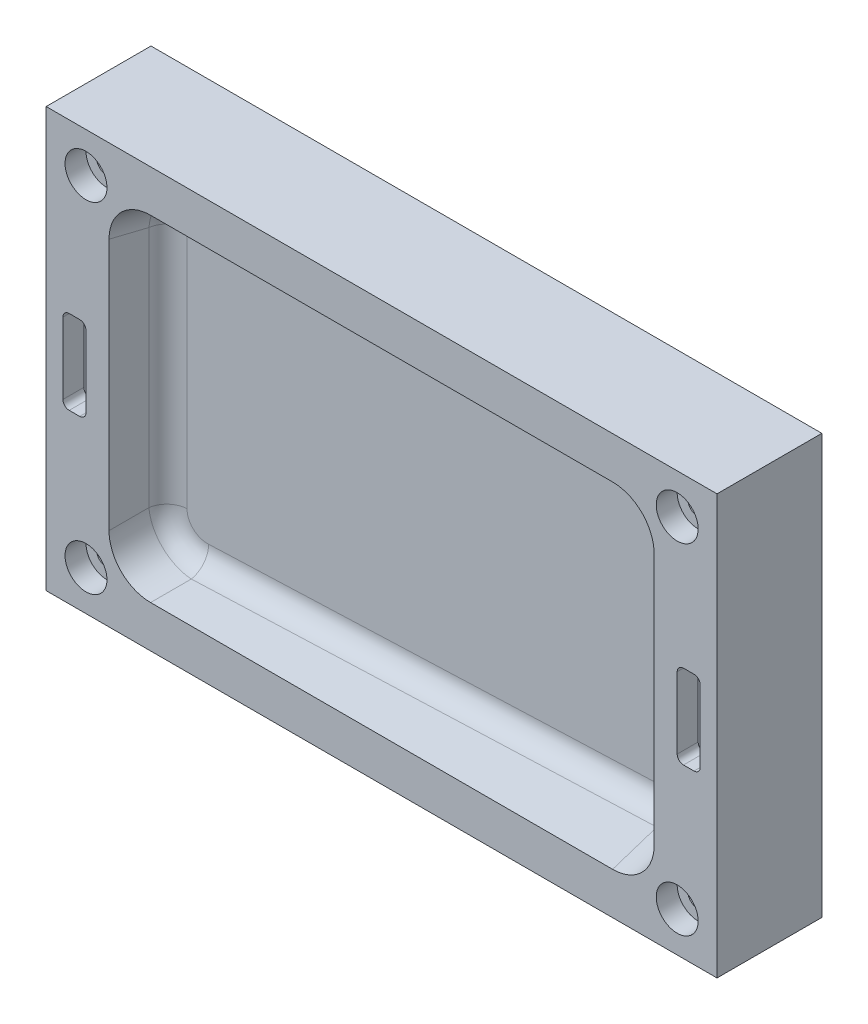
ISO-10303-21;
HEADER;
FILE_DESCRIPTION(('STEP AP214'),'2;1');
FILE_NAME('part.step','',(''),(''),'','','');
FILE_SCHEMA(('AUTOMOTIVE_DESIGN { 1 0 10303 214 1 1 1 1 }'));
ENDSEC;
DATA;
#1=APPLICATION_CONTEXT('core data for automotive mechanical design processes');
#2=APPLICATION_PROTOCOL_DEFINITION('international standard','automotive_design',2000,#1);
#3=PRODUCT_CONTEXT('',#1,'mechanical');
#4=PRODUCT('Part','Part','',(#3));
#5=PRODUCT_RELATED_PRODUCT_CATEGORY('part','',(#4));
#6=PRODUCT_DEFINITION_FORMATION('','',#4);
#7=PRODUCT_DEFINITION_CONTEXT('part definition',#1,'design');
#8=PRODUCT_DEFINITION('design','',#6,#7);
#9=PRODUCT_DEFINITION_SHAPE('','',#8);
#10=(LENGTH_UNIT() NAMED_UNIT(*) SI_UNIT(.MILLI.,.METRE.));
#11=(NAMED_UNIT(*) PLANE_ANGLE_UNIT() SI_UNIT($,.RADIAN.));
#12=(NAMED_UNIT(*) SI_UNIT($,.STERADIAN.) SOLID_ANGLE_UNIT());
#13=UNCERTAINTY_MEASURE_WITH_UNIT(LENGTH_MEASURE(1.E-05),#10,'distance_accuracy_value','');
#14=(GEOMETRIC_REPRESENTATION_CONTEXT(3) GLOBAL_UNCERTAINTY_ASSIGNED_CONTEXT((#13)) GLOBAL_UNIT_ASSIGNED_CONTEXT((#10,
#11,#12)) REPRESENTATION_CONTEXT('',''));
#15=CARTESIAN_POINT('',(0.,0.,0.));
#16=DIRECTION('',(0.,0.,1.));
#17=DIRECTION('',(1.,0.,0.));
#18=AXIS2_PLACEMENT_3D('',#15,#16,#17);
#19=CARTESIAN_POINT('',(0.,0.,0.));
#20=DIRECTION('',(0.,0.,-1.));
#21=DIRECTION('',(-1.,0.,0.));
#22=AXIS2_PLACEMENT_3D('',#19,#20,#21);
#23=PLANE('',#22);
#24=DIRECTION('',(0.,-1.,0.));
#25=VECTOR('',#24,1.);
#26=CARTESIAN_POINT('',(5.08,74.295,0.));
#27=LINE('',#26,#25);
#28=CARTESIAN_POINT('',(5.08,74.295,0.));
#29=VERTEX_POINT('',#28);
#30=CARTESIAN_POINT('',(5.08,52.705,0.));
#31=VERTEX_POINT('',#30);
#32=EDGE_CURVE('E299',#29,#31,#27,.T.);
#33=ORIENTED_EDGE('',*,*,#32,.F.);
#34=CARTESIAN_POINT('',(6.985,74.295,0.));
#35=DIRECTION('',(0.,0.,1.));
#36=DIRECTION('',(1.,0.,0.));
#37=AXIS2_PLACEMENT_3D('',#34,#35,#36);
#38=CIRCLE('',#37,1.905);
#39=CARTESIAN_POINT('',(6.985,76.2,0.));
#40=VERTEX_POINT('',#39);
#41=EDGE_CURVE('E66',#40,#29,#38,.T.);
#42=ORIENTED_EDGE('',*,*,#41,.F.);
#43=DIRECTION('',(1.,0.,0.));
#44=VECTOR('',#43,1.);
#45=CARTESIAN_POINT('',(6.985,76.2,0.));
#46=LINE('',#45,#44);
#47=CARTESIAN_POINT('',(10.16,76.2,0.));
#48=VERTEX_POINT('',#47);
#49=EDGE_CURVE('E281',#40,#48,#46,.T.);
#50=ORIENTED_EDGE('',*,*,#49,.T.);
#51=CARTESIAN_POINT('',(10.16,74.295,0.));
#52=DIRECTION('',(0.,0.,-1.));
#53=DIRECTION('',(-1.,0.,0.));
#54=AXIS2_PLACEMENT_3D('',#51,#52,#53);
#55=CIRCLE('',#54,1.905);
#56=CARTESIAN_POINT('',(12.065,74.295,0.));
#57=VERTEX_POINT('',#56);
#58=EDGE_CURVE('E284',#48,#57,#55,.T.);
#59=ORIENTED_EDGE('',*,*,#58,.T.);
#60=DIRECTION('',(0.,1.,0.));
#61=VECTOR('',#60,1.);
#62=CARTESIAN_POINT('',(12.065,52.705,0.));
#63=LINE('',#62,#61);
#64=CARTESIAN_POINT('',(12.065,52.705,0.));
#65=VERTEX_POINT('',#64);
#66=EDGE_CURVE('E310',#65,#57,#63,.T.);
#67=ORIENTED_EDGE('',*,*,#66,.F.);
#68=CARTESIAN_POINT('',(10.16,52.705,0.));
#69=DIRECTION('',(0.,0.,-1.));
#70=DIRECTION('',(-1.,0.,0.));
#71=AXIS2_PLACEMENT_3D('',#68,#69,#70);
#72=CIRCLE('',#71,1.905);
#73=CARTESIAN_POINT('',(10.16,50.8,0.));
#74=VERTEX_POINT('',#73);
#75=EDGE_CURVE('E307',#65,#74,#72,.T.);
#76=ORIENTED_EDGE('',*,*,#75,.T.);
#77=DIRECTION('',(-1.,0.,0.));
#78=VECTOR('',#77,1.);
#79=CARTESIAN_POINT('',(10.16,50.8,0.));
#80=LINE('',#79,#78);
#81=CARTESIAN_POINT('',(6.985,50.8,0.));
#82=VERTEX_POINT('',#81);
#83=EDGE_CURVE('E304',#74,#82,#80,.T.);
#84=ORIENTED_EDGE('',*,*,#83,.T.);
#85=CARTESIAN_POINT('',(6.98499999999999,52.705,0.));
#86=DIRECTION('',(0.,0.,1.));
#87=DIRECTION('',(1.,0.,0.));
#88=AXIS2_PLACEMENT_3D('',#85,#86,#87);
#89=CIRCLE('',#88,1.905);
#90=EDGE_CURVE('E301',#31,#82,#89,.T.);
#91=ORIENTED_EDGE('',*,*,#90,.F.);
#92=EDGE_LOOP('',(#33,#42,#50,#59,#67,#76,#84,#91));
#93=FACE_BOUND('',#92,.T.);
#94=CARTESIAN_POINT('',(191.135,114.932481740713,0.));
#95=DIRECTION('',(0.,0.,1.));
#96=DIRECTION('',(1.,0.,0.));
#97=AXIS2_PLACEMENT_3D('',#94,#95,#96);
#98=CIRCLE('',#97,6.34999999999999);
#99=CARTESIAN_POINT('',(197.485,114.932481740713,0.));
#100=VERTEX_POINT('',#99);
#101=EDGE_CURVE('E386',#100,#100,#98,.T.);
#102=ORIENTED_EDGE('',*,*,#101,.F.);
#103=EDGE_LOOP('',(#102));
#104=FACE_BOUND('',#103,.T.);
#105=CARTESIAN_POINT('',(12.065,114.932481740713,0.));
#106=DIRECTION('',(0.,0.,1.));
#107=DIRECTION('',(1.,0.,0.));
#108=AXIS2_PLACEMENT_3D('',#105,#106,#107);
#109=CIRCLE('',#108,6.34999999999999);
#110=CARTESIAN_POINT('',(18.415,114.932481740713,0.));
#111=VERTEX_POINT('',#110);
#112=EDGE_CURVE('E410',#111,#111,#109,.T.);
#113=ORIENTED_EDGE('',*,*,#112,.F.);
#114=EDGE_LOOP('',(#113));
#115=FACE_BOUND('',#114,.T.);
#116=DIRECTION('',(0.,1.,0.));
#117=VECTOR('',#116,1.);
#118=CARTESIAN_POINT('',(0.,0.,0.));
#119=LINE('',#118,#117);
#120=CARTESIAN_POINT('',(0.,0.,0.));
#121=VERTEX_POINT('',#120);
#122=CARTESIAN_POINT('',(0.,127.,0.));
#123=VERTEX_POINT('',#122);
#124=EDGE_CURVE('E452',#121,#123,#119,.T.);
#125=ORIENTED_EDGE('',*,*,#124,.F.);
#126=DIRECTION('',(1.,0.,0.));
#127=VECTOR('',#126,1.);
#128=CARTESIAN_POINT('',(0.,0.,0.));
#129=LINE('',#128,#127);
#130=CARTESIAN_POINT('',(203.2,0.,0.));
#131=VERTEX_POINT('',#130);
#132=EDGE_CURVE('E456',#121,#131,#129,.T.);
#133=ORIENTED_EDGE('',*,*,#132,.T.);
#134=DIRECTION('',(0.,-1.,0.));
#135=VECTOR('',#134,1.);
#136=CARTESIAN_POINT('',(203.2,127.,0.));
#137=LINE('',#136,#135);
#138=CARTESIAN_POINT('',(203.2,127.,0.));
#139=VERTEX_POINT('',#138);
#140=EDGE_CURVE('E470',#139,#131,#137,.T.);
#141=ORIENTED_EDGE('',*,*,#140,.F.);
#142=DIRECTION('',(-1.,0.,0.));
#143=VECTOR('',#142,1.);
#144=CARTESIAN_POINT('',(203.2,127.,0.));
#145=LINE('',#144,#143);
#146=EDGE_CURVE('E467',#139,#123,#145,.T.);
#147=ORIENTED_EDGE('',*,*,#146,.T.);
#148=EDGE_LOOP('',(#125,#133,#141,#147));
#149=FACE_BOUND('',#148,.T.);
#150=DIRECTION('',(0.,1.,0.));
#151=VECTOR('',#150,1.);
#152=CARTESIAN_POINT('',(184.15,12.7,0.));
#153=LINE('',#152,#151);
#154=CARTESIAN_POINT('',(184.15,25.2764044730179,0.));
#155=VERTEX_POINT('',#154);
#156=CARTESIAN_POINT('',(184.15,101.723595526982,0.));
#157=VERTEX_POINT('',#156);
#158=EDGE_CURVE('E444',#155,#157,#153,.T.);
#159=ORIENTED_EDGE('',*,*,#158,.F.);
#160=CARTESIAN_POINT('',(171.325189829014,25.5248101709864,0.));
#161=DIRECTION('',(0.,0.,-1.));
#162=DIRECTION('',(-0.707106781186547,0.707106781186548,0.));
#163=AXIS2_PLACEMENT_3D('',#160,#161,#162);
#164=ELLIPSE('',#163,12.9484173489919,12.7);
#165=CARTESIAN_POINT('',(171.573595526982,12.7,0.));
#166=VERTEX_POINT('',#165);
#167=EDGE_CURVE('E508',#155,#166,#164,.T.);
#168=ORIENTED_EDGE('',*,*,#167,.T.);
#169=DIRECTION('',(-1.,0.,0.));
#170=VECTOR('',#169,1.);
#171=CARTESIAN_POINT('',(184.15,12.7,0.));
#172=LINE('',#171,#170);
#173=CARTESIAN_POINT('',(31.626404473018,12.7,0.));
#174=VERTEX_POINT('',#173);
#175=EDGE_CURVE('E439',#166,#174,#172,.T.);
#176=ORIENTED_EDGE('',*,*,#175,.T.);
#177=CARTESIAN_POINT('',(31.8748101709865,25.5248101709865,0.));
#178=DIRECTION('',(0.,0.,-1.));
#179=DIRECTION('',(0.707106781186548,0.707106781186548,0.));
#180=AXIS2_PLACEMENT_3D('',#177,#178,#179);
#181=ELLIPSE('',#180,12.9484173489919,12.7);
#182=CARTESIAN_POINT('',(19.05,25.276404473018,0.));
#183=VERTEX_POINT('',#182);
#184=EDGE_CURVE('E505',#174,#183,#181,.T.);
#185=ORIENTED_EDGE('',*,*,#184,.T.);
#186=DIRECTION('',(0.,-1.,0.));
#187=VECTOR('',#186,1.);
#188=CARTESIAN_POINT('',(19.05,114.3,0.));
#189=LINE('',#188,#187);
#190=CARTESIAN_POINT('',(19.05,101.723595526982,0.));
#191=VERTEX_POINT('',#190);
#192=EDGE_CURVE('E435',#191,#183,#189,.T.);
#193=ORIENTED_EDGE('',*,*,#192,.F.);
#194=CARTESIAN_POINT('',(31.8748101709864,101.475189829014,0.));
#195=DIRECTION('',(0.,0.,-1.));
#196=DIRECTION('',(0.707106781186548,-0.707106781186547,0.));
#197=AXIS2_PLACEMENT_3D('',#194,#195,#196);
#198=ELLIPSE('',#197,12.9484173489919,12.7);
#199=CARTESIAN_POINT('',(31.6264044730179,114.3,0.));
#200=VERTEX_POINT('',#199);
#201=EDGE_CURVE('E502',#191,#200,#198,.T.);
#202=ORIENTED_EDGE('',*,*,#201,.T.);
#203=DIRECTION('',(1.,0.,0.));
#204=VECTOR('',#203,1.);
#205=CARTESIAN_POINT('',(19.05,114.3,0.));
#206=LINE('',#205,#204);
#207=CARTESIAN_POINT('',(171.573595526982,114.3,0.));
#208=VERTEX_POINT('',#207);
#209=EDGE_CURVE('E448',#200,#208,#206,.T.);
#210=ORIENTED_EDGE('',*,*,#209,.T.);
#211=CARTESIAN_POINT('',(171.325189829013,101.475189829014,0.));
#212=DIRECTION('',(0.,0.,-1.));
#213=DIRECTION('',(-0.707106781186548,-0.707106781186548,0.));
#214=AXIS2_PLACEMENT_3D('',#211,#212,#213);
#215=ELLIPSE('',#214,12.9484173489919,12.7);
#216=EDGE_CURVE('E511',#208,#157,#215,.T.);
#217=ORIENTED_EDGE('',*,*,#216,.T.);
#218=EDGE_LOOP('',(#159,#168,#176,#185,#193,#202,#210,#217));
#219=FACE_BOUND('',#218,.T.);
#220=CARTESIAN_POINT('',(12.065,12.0624817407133,0.));
#221=DIRECTION('',(0.,0.,1.));
#222=DIRECTION('',(1.,0.,0.));
#223=AXIS2_PLACEMENT_3D('',#220,#221,#222);
#224=CIRCLE('',#223,6.34999999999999);
#225=CARTESIAN_POINT('',(18.415,12.0624817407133,0.));
#226=VERTEX_POINT('',#225);
#227=EDGE_CURVE('E422',#226,#226,#224,.T.);
#228=ORIENTED_EDGE('',*,*,#227,.F.);
#229=EDGE_LOOP('',(#228));
#230=FACE_BOUND('',#229,.T.);
#231=CARTESIAN_POINT('',(191.135,12.0624817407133,0.));
#232=DIRECTION('',(0.,0.,1.));
#233=DIRECTION('',(1.,0.,0.));
#234=AXIS2_PLACEMENT_3D('',#231,#232,#233);
#235=CIRCLE('',#234,6.34999999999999);
#236=CARTESIAN_POINT('',(197.485,12.0624817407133,0.));
#237=VERTEX_POINT('',#236);
#238=EDGE_CURVE('E398',#237,#237,#235,.T.);
#239=ORIENTED_EDGE('',*,*,#238,.F.);
#240=EDGE_LOOP('',(#239));
#241=FACE_BOUND('',#240,.T.);
#242=CARTESIAN_POINT('',(193.04,52.705,0.));
#243=DIRECTION('',(0.,0.,-1.));
#244=DIRECTION('',(-1.,0.,0.));
#245=AXIS2_PLACEMENT_3D('',#242,#243,#244);
#246=CIRCLE('',#245,1.90499999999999);
#247=CARTESIAN_POINT('',(193.04,50.8,0.));
#248=VERTEX_POINT('',#247);
#249=CARTESIAN_POINT('',(191.135,52.705,0.));
#250=VERTEX_POINT('',#249);
#251=EDGE_CURVE('E74',#248,#250,#246,.T.);
#252=ORIENTED_EDGE('',*,*,#251,.T.);
#253=DIRECTION('',(0.,-1.,0.));
#254=VECTOR('',#253,1.);
#255=CARTESIAN_POINT('',(191.135,74.295,0.));
#256=LINE('',#255,#254);
#257=CARTESIAN_POINT('',(191.135,74.295,0.));
#258=VERTEX_POINT('',#257);
#259=EDGE_CURVE('E351',#258,#250,#256,.T.);
#260=ORIENTED_EDGE('',*,*,#259,.F.);
#261=CARTESIAN_POINT('',(193.04,74.295,0.));
#262=DIRECTION('',(0.,0.,1.));
#263=DIRECTION('',(1.,0.,0.));
#264=AXIS2_PLACEMENT_3D('',#261,#262,#263);
#265=CIRCLE('',#264,1.905);
#266=CARTESIAN_POINT('',(193.04,76.2,0.));
#267=VERTEX_POINT('',#266);
#268=EDGE_CURVE('E354',#267,#258,#265,.T.);
#269=ORIENTED_EDGE('',*,*,#268,.F.);
#270=DIRECTION('',(1.,0.,0.));
#271=VECTOR('',#270,1.);
#272=CARTESIAN_POINT('',(193.04,76.2,0.));
#273=LINE('',#272,#271);
#274=CARTESIAN_POINT('',(196.215,76.2,0.));
#275=VERTEX_POINT('',#274);
#276=EDGE_CURVE('E357',#267,#275,#273,.T.);
#277=ORIENTED_EDGE('',*,*,#276,.T.);
#278=CARTESIAN_POINT('',(196.215,74.295,0.));
#279=DIRECTION('',(0.,0.,-1.));
#280=DIRECTION('',(-1.,0.,0.));
#281=AXIS2_PLACEMENT_3D('',#278,#279,#280);
#282=CIRCLE('',#281,1.905);
#283=CARTESIAN_POINT('',(198.12,74.295,0.));
#284=VERTEX_POINT('',#283);
#285=EDGE_CURVE('E360',#275,#284,#282,.T.);
#286=ORIENTED_EDGE('',*,*,#285,.T.);
#287=DIRECTION('',(0.,1.,0.));
#288=VECTOR('',#287,1.);
#289=CARTESIAN_POINT('',(198.12,52.705,0.));
#290=LINE('',#289,#288);
#291=CARTESIAN_POINT('',(198.12,52.705,0.));
#292=VERTEX_POINT('',#291);
#293=EDGE_CURVE('E363',#292,#284,#290,.T.);
#294=ORIENTED_EDGE('',*,*,#293,.F.);
#295=CARTESIAN_POINT('',(196.215,52.705,0.));
#296=DIRECTION('',(0.,0.,1.));
#297=DIRECTION('',(1.,0.,0.));
#298=AXIS2_PLACEMENT_3D('',#295,#296,#297);
#299=CIRCLE('',#298,1.90499999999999);
#300=CARTESIAN_POINT('',(196.215,50.8,0.));
#301=VERTEX_POINT('',#300);
#302=EDGE_CURVE('E366',#301,#292,#299,.T.);
#303=ORIENTED_EDGE('',*,*,#302,.F.);
#304=DIRECTION('',(-1.,0.,0.));
#305=VECTOR('',#304,1.);
#306=CARTESIAN_POINT('',(196.215,50.8,0.));
#307=LINE('',#306,#305);
#308=EDGE_CURVE('E331',#301,#248,#307,.T.);
#309=ORIENTED_EDGE('',*,*,#308,.T.);
#310=EDGE_LOOP('',(#252,#260,#269,#277,#286,#294,#303,#309));
#311=FACE_BOUND('',#310,.T.);
#312=ADVANCED_FACE('F49',(#93,#104,#115,#149,#219,#230,#241,#311),#23,.F.);
#313=CARTESIAN_POINT('',(0.,0.,-31.75));
#314=DIRECTION('',(0.,0.,-1.));
#315=DIRECTION('',(-1.,0.,0.));
#316=AXIS2_PLACEMENT_3D('',#313,#314,#315);
#317=PLANE('',#316);
#318=CARTESIAN_POINT('',(191.135,12.0624817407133,-31.75));
#319=DIRECTION('',(0.,0.,1.));
#320=DIRECTION('',(1.,0.,0.));
#321=AXIS2_PLACEMENT_3D('',#318,#319,#320);
#322=CIRCLE('',#321,3.17500000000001);
#323=CARTESIAN_POINT('',(194.31,12.0624817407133,-31.75));
#324=VERTEX_POINT('',#323);
#325=EDGE_CURVE('E407',#324,#324,#322,.T.);
#326=ORIENTED_EDGE('',*,*,#325,.T.);
#327=EDGE_LOOP('',(#326));
#328=FACE_BOUND('',#327,.T.);
#329=CARTESIAN_POINT('',(12.065,12.0624817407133,-31.75));
#330=DIRECTION('',(0.,0.,1.));
#331=DIRECTION('',(1.,0.,0.));
#332=AXIS2_PLACEMENT_3D('',#329,#330,#331);
#333=CIRCLE('',#332,3.17500000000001);
#334=CARTESIAN_POINT('',(15.24,12.0624817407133,-31.75));
#335=VERTEX_POINT('',#334);
#336=EDGE_CURVE('E431',#335,#335,#333,.T.);
#337=ORIENTED_EDGE('',*,*,#336,.T.);
#338=EDGE_LOOP('',(#337));
#339=FACE_BOUND('',#338,.T.);
#340=DIRECTION('',(0.,1.,0.));
#341=VECTOR('',#340,1.);
#342=CARTESIAN_POINT('',(0.,0.,-31.75));
#343=LINE('',#342,#341);
#344=CARTESIAN_POINT('',(0.,0.,-31.75));
#345=VERTEX_POINT('',#344);
#346=CARTESIAN_POINT('',(0.,127.,-31.75));
#347=VERTEX_POINT('',#346);
#348=EDGE_CURVE('E453',#345,#347,#343,.T.);
#349=ORIENTED_EDGE('',*,*,#348,.T.);
#350=DIRECTION('',(-1.,0.,0.));
#351=VECTOR('',#350,1.);
#352=CARTESIAN_POINT('',(203.2,127.,-31.75));
#353=LINE('',#352,#351);
#354=CARTESIAN_POINT('',(203.2,127.,-31.75));
#355=VERTEX_POINT('',#354);
#356=EDGE_CURVE('E455',#355,#347,#353,.T.);
#357=ORIENTED_EDGE('',*,*,#356,.F.);
#358=DIRECTION('',(0.,-1.,0.));
#359=VECTOR('',#358,1.);
#360=CARTESIAN_POINT('',(203.2,127.,-31.75));
#361=LINE('',#360,#359);
#362=CARTESIAN_POINT('',(203.2,0.,-31.75));
#363=VERTEX_POINT('',#362);
#364=EDGE_CURVE('E459',#355,#363,#361,.T.);
#365=ORIENTED_EDGE('',*,*,#364,.T.);
#366=DIRECTION('',(1.,0.,0.));
#367=VECTOR('',#366,1.);
#368=CARTESIAN_POINT('',(0.,0.,-31.75));
#369=LINE('',#368,#367);
#370=EDGE_CURVE('E461',#345,#363,#369,.T.);
#371=ORIENTED_EDGE('',*,*,#370,.F.);
#372=EDGE_LOOP('',(#349,#357,#365,#371));
#373=FACE_BOUND('',#372,.T.);
#374=CARTESIAN_POINT('',(12.065,114.932481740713,-31.75));
#375=DIRECTION('',(0.,0.,1.));
#376=DIRECTION('',(1.,0.,0.));
#377=AXIS2_PLACEMENT_3D('',#374,#375,#376);
#378=CIRCLE('',#377,3.17500000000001);
#379=CARTESIAN_POINT('',(15.24,114.932481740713,-31.75));
#380=VERTEX_POINT('',#379);
#381=EDGE_CURVE('E419',#380,#380,#378,.T.);
#382=ORIENTED_EDGE('',*,*,#381,.T.);
#383=EDGE_LOOP('',(#382));
#384=FACE_BOUND('',#383,.T.);
#385=CARTESIAN_POINT('',(191.135,114.932481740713,-31.75));
#386=DIRECTION('',(0.,0.,1.));
#387=DIRECTION('',(1.,0.,0.));
#388=AXIS2_PLACEMENT_3D('',#385,#386,#387);
#389=CIRCLE('',#388,3.17500000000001);
#390=CARTESIAN_POINT('',(194.31,114.932481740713,-31.75));
#391=VERTEX_POINT('',#390);
#392=EDGE_CURVE('E395',#391,#391,#389,.T.);
#393=ORIENTED_EDGE('',*,*,#392,.T.);
#394=EDGE_LOOP('',(#393));
#395=FACE_BOUND('',#394,.T.);
#396=ADVANCED_FACE('F659',(#328,#339,#373,#384,#395),#317,.T.);
#397=CARTESIAN_POINT('',(0.,0.,-31.75));
#398=DIRECTION('',(1.,0.,0.));
#399=DIRECTION('',(0.,0.,-1.));
#400=AXIS2_PLACEMENT_3D('',#397,#398,#399);
#401=PLANE('',#400);
#402=ORIENTED_EDGE('',*,*,#124,.T.);
#403=DIRECTION('',(0.,0.,1.));
#404=VECTOR('',#403,1.);
#405=CARTESIAN_POINT('',(0.,127.,-31.75));
#406=LINE('',#405,#404);
#407=EDGE_CURVE('E480',#347,#123,#406,.T.);
#408=ORIENTED_EDGE('',*,*,#407,.F.);
#409=ORIENTED_EDGE('',*,*,#348,.F.);
#410=DIRECTION('',(0.,0.,1.));
#411=VECTOR('',#410,1.);
#412=CARTESIAN_POINT('',(0.,0.,-31.75));
#413=LINE('',#412,#411);
#414=EDGE_CURVE('E464',#345,#121,#413,.T.);
#415=ORIENTED_EDGE('',*,*,#414,.T.);
#416=EDGE_LOOP('',(#402,#408,#409,#415));
#417=FACE_BOUND('',#416,.T.);
#418=ADVANCED_FACE('F665',(#417),#401,.F.);
#419=CARTESIAN_POINT('',(203.2,127.,-31.75));
#420=DIRECTION('',(0.,1.,0.));
#421=DIRECTION('',(-1.,0.,0.));
#422=AXIS2_PLACEMENT_3D('',#419,#420,#421);
#423=PLANE('',#422);
#424=ORIENTED_EDGE('',*,*,#146,.F.);
#425=DIRECTION('',(0.,0.,1.));
#426=VECTOR('',#425,1.);
#427=CARTESIAN_POINT('',(203.2,127.,-31.75));
#428=LINE('',#427,#426);
#429=EDGE_CURVE('E478',#355,#139,#428,.T.);
#430=ORIENTED_EDGE('',*,*,#429,.F.);
#431=ORIENTED_EDGE('',*,*,#356,.T.);
#432=ORIENTED_EDGE('',*,*,#407,.T.);
#433=EDGE_LOOP('',(#424,#430,#431,#432));
#434=FACE_BOUND('',#433,.T.);
#435=ADVANCED_FACE('F679',(#434),#423,.T.);
#436=CARTESIAN_POINT('',(203.2,127.,-31.75));
#437=DIRECTION('',(-1.,0.,0.));
#438=DIRECTION('',(0.,-1.,0.));
#439=AXIS2_PLACEMENT_3D('',#436,#437,#438);
#440=PLANE('',#439);
#441=ORIENTED_EDGE('',*,*,#140,.T.);
#442=DIRECTION('',(0.,0.,1.));
#443=VECTOR('',#442,1.);
#444=CARTESIAN_POINT('',(203.2,0.,-31.75));
#445=LINE('',#444,#443);
#446=EDGE_CURVE('E476',#363,#131,#445,.T.);
#447=ORIENTED_EDGE('',*,*,#446,.F.);
#448=ORIENTED_EDGE('',*,*,#364,.F.);
#449=ORIENTED_EDGE('',*,*,#429,.T.);
#450=EDGE_LOOP('',(#441,#447,#448,#449));
#451=FACE_BOUND('',#450,.T.);
#452=ADVANCED_FACE('F675',(#451),#440,.F.);
#453=CARTESIAN_POINT('',(0.,0.,-31.75));
#454=DIRECTION('',(0.,-1.,0.));
#455=DIRECTION('',(0.,0.,-1.));
#456=AXIS2_PLACEMENT_3D('',#453,#454,#455);
#457=PLANE('',#456);
#458=ORIENTED_EDGE('',*,*,#132,.F.);
#459=ORIENTED_EDGE('',*,*,#414,.F.);
#460=ORIENTED_EDGE('',*,*,#370,.T.);
#461=ORIENTED_EDGE('',*,*,#446,.T.);
#462=EDGE_LOOP('',(#458,#459,#460,#461));
#463=FACE_BOUND('',#462,.T.);
#464=ADVANCED_FACE('F671',(#463),#457,.T.);
#465=CARTESIAN_POINT('',(19.05,114.3,0.));
#466=DIRECTION('',(-0.99026806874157,0.,-0.139173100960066));
#467=DIRECTION('',(-0.139173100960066,0.,0.99026806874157));
#468=AXIS2_PLACEMENT_3D('',#465,#466,#467);
#469=PLANE('',#468);
#470=DIRECTION('',(0.137844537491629,0.137844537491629,-0.980814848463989));
#471=VECTOR('',#470,1.);
#472=CARTESIAN_POINT('',(20.7415477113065,26.9679521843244,-12.0359873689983));
#473=LINE('',#472,#471);
#474=CARTESIAN_POINT('',(20.5395321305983,26.7659366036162,-10.5985718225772));
#475=VERTEX_POINT('',#474);
#476=EDGE_CURVE('E482',#183,#475,#473,.T.);
#477=ORIENTED_EDGE('',*,*,#476,.T.);
#478=DIRECTION('',(0.,-1.,0.));
#479=VECTOR('',#478,1.);
#480=CARTESIAN_POINT('',(20.5395321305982,114.3,-10.5985718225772));
#481=LINE('',#480,#479);
#482=CARTESIAN_POINT('',(20.5395321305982,100.234063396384,-10.5985718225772));
#483=VERTEX_POINT('',#482);
#484=EDGE_CURVE('E538',#475,#483,#481,.F.);
#485=ORIENTED_EDGE('',*,*,#484,.T.);
#486=DIRECTION('',(0.137844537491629,-0.137844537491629,-0.980814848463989));
#487=VECTOR('',#486,1.);
#488=CARTESIAN_POINT('',(18.8110342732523,101.96256125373,1.70032949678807));
#489=LINE('',#488,#487);
#490=EDGE_CURVE('E485',#483,#191,#489,.F.);
#491=ORIENTED_EDGE('',*,*,#490,.T.);
#492=ORIENTED_EDGE('',*,*,#192,.T.);
#493=EDGE_LOOP('',(#477,#485,#491,#492));
#494=FACE_BOUND('',#493,.T.);
#495=ADVANCED_FACE('F674',(#494),#469,.F.);
#496=CARTESIAN_POINT('',(19.05,114.3,0.));
#497=DIRECTION('',(0.,0.99026806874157,-0.139173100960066));
#498=DIRECTION('',(0.,0.139173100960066,0.99026806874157));
#499=AXIS2_PLACEMENT_3D('',#496,#497,#498);
#500=PLANE('',#499);
#501=DIRECTION('',(-0.137844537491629,0.137844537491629,0.980814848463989));
#502=VECTOR('',#501,1.);
#503=CARTESIAN_POINT('',(31.3874387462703,114.538965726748,1.70032949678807));
#504=LINE('',#503,#502);
#505=CARTESIAN_POINT('',(33.1469500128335,112.779454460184,-10.8192436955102));
#506=VERTEX_POINT('',#505);
#507=EDGE_CURVE('E489',#200,#506,#504,.F.);
#508=ORIENTED_EDGE('',*,*,#507,.T.);
#509=DIRECTION('',(0.99937880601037,-0.00490474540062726,-0.0348990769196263));
#510=VECTOR('',#509,1.);
#511=CARTESIAN_POINT('',(168.813955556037,112.113628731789,-15.5568399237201));
#512=LINE('',#511,#510);
#513=CARTESIAN_POINT('',(169.384424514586,112.110828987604,-15.5767611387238));
#514=VERTEX_POINT('',#513);
#515=EDGE_CURVE('E11',#506,#514,#512,.T.);
#516=ORIENTED_EDGE('',*,*,#515,.T.);
#517=DIRECTION('',(0.137844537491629,0.137844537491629,0.980814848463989));
#518=VECTOR('',#517,1.);
#519=CARTESIAN_POINT('',(168.675476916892,111.40188138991,-20.6211854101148));
#520=LINE('',#519,#518);
#521=EDGE_CURVE('E487',#514,#208,#520,.T.);
#522=ORIENTED_EDGE('',*,*,#521,.T.);
#523=ORIENTED_EDGE('',*,*,#209,.F.);
#524=EDGE_LOOP('',(#508,#516,#522,#523));
#525=FACE_BOUND('',#524,.T.);
#526=ADVANCED_FACE('F646',(#525),#500,.F.);
#527=CARTESIAN_POINT('',(184.15,12.7,0.));
#528=DIRECTION('',(0.99026806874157,0.,-0.139173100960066));
#529=DIRECTION('',(-0.139173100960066,0.,-0.99026806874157));
#530=AXIS2_PLACEMENT_3D('',#527,#528,#529);
#531=PLANE('',#530);
#532=DIRECTION('',(-0.137844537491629,-0.137844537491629,-0.980814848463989));
#533=VECTOR('',#532,1.);
#534=CARTESIAN_POINT('',(182.458452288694,100.032047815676,-12.0359873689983));
#535=LINE('',#534,#533);
#536=CARTESIAN_POINT('',(181.930118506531,99.5037140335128,-15.7952775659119));
#537=VERTEX_POINT('',#536);
#538=EDGE_CURVE('E497',#157,#537,#535,.T.);
#539=ORIENTED_EDGE('',*,*,#538,.T.);
#540=DIRECTION('',(0.,1.,0.));
#541=VECTOR('',#540,1.);
#542=CARTESIAN_POINT('',(181.930118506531,12.7,-15.7952775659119));
#543=LINE('',#542,#541);
#544=CARTESIAN_POINT('',(181.930118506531,27.4962859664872,-15.7952775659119));
#545=VERTEX_POINT('',#544);
#546=EDGE_CURVE('E540',#537,#545,#543,.F.);
#547=ORIENTED_EDGE('',*,*,#546,.T.);
#548=DIRECTION('',(-0.137844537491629,0.137844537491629,-0.980814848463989));
#549=VECTOR('',#548,1.);
#550=CARTESIAN_POINT('',(184.388965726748,25.0374387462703,1.70032949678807));
#551=LINE('',#550,#549);
#552=EDGE_CURVE('E500',#545,#155,#551,.F.);
#553=ORIENTED_EDGE('',*,*,#552,.T.);
#554=ORIENTED_EDGE('',*,*,#158,.T.);
#555=EDGE_LOOP('',(#539,#547,#553,#554));
#556=FACE_BOUND('',#555,.T.);
#557=ADVANCED_FACE('F634',(#556),#531,.F.);
#558=CARTESIAN_POINT('',(184.15,12.7,0.));
#559=DIRECTION('',(0.,-0.99026806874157,-0.139173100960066));
#560=DIRECTION('',(0.,0.139173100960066,-0.99026806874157));
#561=AXIS2_PLACEMENT_3D('',#558,#559,#560);
#562=PLANE('',#561);
#563=DIRECTION('',(0.137844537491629,-0.137844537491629,0.980814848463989));
#564=VECTOR('',#563,1.);
#565=CARTESIAN_POINT('',(171.81256125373,12.4610342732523,1.70032949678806));
#566=LINE('',#565,#564);
#567=CARTESIAN_POINT('',(169.384424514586,14.889171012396,-15.5767611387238));
#568=VERTEX_POINT('',#567);
#569=EDGE_CURVE('E492',#166,#568,#566,.F.);
#570=ORIENTED_EDGE('',*,*,#569,.T.);
#571=DIRECTION('',(-0.99937880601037,-0.00490474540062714,0.0348990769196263));
#572=VECTOR('',#571,1.);
#573=CARTESIAN_POINT('',(34.1140689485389,14.2252919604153,-10.8530162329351));
#574=LINE('',#573,#572);
#575=CARTESIAN_POINT('',(33.1469500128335,14.2205455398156,-10.8192436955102));
#576=VERTEX_POINT('',#575);
#577=EDGE_CURVE('E514',#568,#576,#574,.T.);
#578=ORIENTED_EDGE('',*,*,#577,.T.);
#579=DIRECTION('',(-0.137844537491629,-0.137844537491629,0.980814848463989));
#580=VECTOR('',#579,1.);
#581=CARTESIAN_POINT('',(34.5245230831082,15.5981186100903,-20.6211854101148));
#582=LINE('',#581,#580);
#583=EDGE_CURVE('E495',#576,#174,#582,.T.);
#584=ORIENTED_EDGE('',*,*,#583,.T.);
#585=ORIENTED_EDGE('',*,*,#175,.F.);
#586=EDGE_LOOP('',(#570,#578,#584,#585));
#587=FACE_BOUND('',#586,.T.);
#588=ADVANCED_FACE('F756',(#587),#562,.F.);
#589=CARTESIAN_POINT('',(21.2810857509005,114.3,-15.875));
#590=DIRECTION('',(0.0348994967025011,0.,0.999390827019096));
#591=DIRECTION('',(0.999390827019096,0.,-0.0348994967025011));
#592=AXIS2_PLACEMENT_3D('',#589,#590,#591);
#593=PLANE('',#592);
#594=CARTESIAN_POINT('',(33.0501536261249,26.9217654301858,-16.2859849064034));
#595=DIRECTION('',(0.0348994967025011,0.,0.999390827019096));
#596=DIRECTION('',(0.779835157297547,0.625392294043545,-0.0272324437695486));
#597=AXIS2_PLACEMENT_3D('',#594,#595,#596);
#598=ELLIPSE('',#597,6.5101052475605,6.35);
#599=CARTESIAN_POINT('',(26.6061225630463,26.7659366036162,-16.060954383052));
#600=VERTEX_POINT('',#599);
#601=CARTESIAN_POINT('',(32.9253382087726,20.5087477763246,-16.2816262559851));
#602=VERTEX_POINT('',#601);
#603=EDGE_CURVE('E529',#600,#602,#598,.T.);
#604=ORIENTED_EDGE('',*,*,#603,.T.);
#605=DIRECTION('',(0.99937880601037,0.00490474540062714,-0.0348990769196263));
#606=VECTOR('',#605,1.);
#607=CARTESIAN_POINT('',(168.592343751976,21.1745735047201,-21.0192224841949));
#608=LINE('',#607,#606);
#609=CARTESIAN_POINT('',(169.162812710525,21.177373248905,-21.0391436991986));
#610=VERTEX_POINT('',#609);
#611=EDGE_CURVE('E531',#602,#610,#608,.T.);
#612=ORIENTED_EDGE('',*,*,#611,.T.);
#613=CARTESIAN_POINT('',(169.039216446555,27.589171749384,-21.0348276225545));
#614=DIRECTION('',(0.0348994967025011,0.,0.999390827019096));
#615=DIRECTION('',(-0.600180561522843,0.799589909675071,0.020958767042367));
#616=AXIS2_PLACEMENT_3D('',#613,#614,#615);
#617=ELLIPSE('',#616,6.44651681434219,6.35);
#618=CARTESIAN_POINT('',(175.420304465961,27.4962859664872,-21.2576601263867));
#619=VERTEX_POINT('',#618);
#620=EDGE_CURVE('E527',#610,#619,#617,.T.);
#621=ORIENTED_EDGE('',*,*,#620,.T.);
#622=DIRECTION('',(0.,1.,0.));
#623=VECTOR('',#622,1.);
#624=CARTESIAN_POINT('',(175.420304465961,114.3,-21.2576601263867));
#625=LINE('',#624,#623);
#626=CARTESIAN_POINT('',(175.420304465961,99.5037140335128,-21.2576601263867));
#627=VERTEX_POINT('',#626);
#628=EDGE_CURVE('E523',#619,#627,#625,.T.);
#629=ORIENTED_EDGE('',*,*,#628,.T.);
#630=CARTESIAN_POINT('',(169.039216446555,99.410828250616,-21.0348276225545));
#631=DIRECTION('',(0.0348994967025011,0.,0.999390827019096));
#632=DIRECTION('',(-0.600180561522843,-0.799589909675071,0.020958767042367));
#633=AXIS2_PLACEMENT_3D('',#630,#631,#632);
#634=ELLIPSE('',#633,6.44651681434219,6.35);
#635=CARTESIAN_POINT('',(169.162812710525,105.822626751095,-21.0391436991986));
#636=VERTEX_POINT('',#635);
#637=EDGE_CURVE('E519',#627,#636,#634,.T.);
#638=ORIENTED_EDGE('',*,*,#637,.T.);
#639=DIRECTION('',(-0.99937880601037,0.00490474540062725,0.0348990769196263));
#640=VECTOR('',#639,1.);
#641=CARTESIAN_POINT('',(33.892457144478,106.486505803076,-16.3153987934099));
#642=LINE('',#641,#640);
#643=CARTESIAN_POINT('',(32.9253382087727,106.491252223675,-16.2816262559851));
#644=VERTEX_POINT('',#643);
#645=EDGE_CURVE('E517',#636,#644,#642,.T.);
#646=ORIENTED_EDGE('',*,*,#645,.T.);
#647=CARTESIAN_POINT('',(33.0501536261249,100.078234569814,-16.2859849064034));
#648=DIRECTION('',(0.0348994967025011,0.,0.999390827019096));
#649=DIRECTION('',(0.779835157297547,-0.625392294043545,-0.0272324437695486));
#650=AXIS2_PLACEMENT_3D('',#647,#648,#649);
#651=ELLIPSE('',#650,6.5101052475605,6.35);
#652=CARTESIAN_POINT('',(26.6061225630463,100.234063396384,-16.060954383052));
#653=VERTEX_POINT('',#652);
#654=EDGE_CURVE('E521',#644,#653,#651,.T.);
#655=ORIENTED_EDGE('',*,*,#654,.T.);
#656=DIRECTION('',(0.,-1.,0.));
#657=VECTOR('',#656,1.);
#658=CARTESIAN_POINT('',(26.6061225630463,114.3,-16.060954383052));
#659=LINE('',#658,#657);
#660=EDGE_CURVE('E525',#653,#600,#659,.T.);
#661=ORIENTED_EDGE('',*,*,#660,.T.);
#662=EDGE_LOOP('',(#604,#612,#621,#629,#638,#646,#655,#661));
#663=FACE_BOUND('',#662,.T.);
#664=ADVANCED_FACE('F568',(#663),#593,.T.);
#665=CARTESIAN_POINT('',(31.3874387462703,101.96256125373,3.4678278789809));
#666=DIRECTION('',(0.137844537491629,-0.137844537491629,-0.980814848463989));
#667=DIRECTION('',(-0.99026806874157,0.,-0.139173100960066));
#668=AXIS2_PLACEMENT_3D('',#665,#666,#667);
#669=CYLINDRICAL_SURFACE('',#668,12.7);
#670=ORIENTED_EDGE('',*,*,#490,.F.);
#671=CARTESIAN_POINT('',(33.2717654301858,100.078234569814,-9.93985315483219));
#672=DIRECTION('',(0.0507099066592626,-0.0684865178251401,-0.996362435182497));
#673=DIRECTION('',(0.778966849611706,-0.621631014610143,0.0823743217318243));
#674=AXIS2_PLACEMENT_3D('',#671,#672,#673);
#675=ELLIPSE('',#674,12.7808047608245,12.7);
#676=EDGE_CURVE('E542',#483,#506,#675,.T.);
#677=ORIENTED_EDGE('',*,*,#676,.T.);
#678=ORIENTED_EDGE('',*,*,#507,.F.);
#679=ORIENTED_EDGE('',*,*,#201,.F.);
#680=EDGE_LOOP('',(#670,#677,#678,#679));
#681=FACE_BOUND('',#680,.T.);
#682=ADVANCED_FACE('F576',(#681),#669,.F.);
#683=CARTESIAN_POINT('',(34.5245230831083,28.1745230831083,-18.8536870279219));
#684=DIRECTION('',(0.137844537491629,0.137844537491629,-0.980814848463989));
#685=DIRECTION('',(-0.99026806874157,0.,-0.139173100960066));
#686=AXIS2_PLACEMENT_3D('',#683,#684,#685);
#687=CYLINDRICAL_SURFACE('',#686,12.7);
#688=ORIENTED_EDGE('',*,*,#583,.F.);
#689=CARTESIAN_POINT('',(33.2717654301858,26.9217654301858,-9.93985315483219));
#690=DIRECTION('',(0.0507099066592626,0.0684865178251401,-0.996362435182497));
#691=DIRECTION('',(0.778966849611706,0.621631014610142,0.0823743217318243));
#692=AXIS2_PLACEMENT_3D('',#689,#690,#691);
#693=ELLIPSE('',#692,12.7808047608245,12.7);
#694=EDGE_CURVE('E534',#576,#475,#693,.T.);
#695=ORIENTED_EDGE('',*,*,#694,.T.);
#696=ORIENTED_EDGE('',*,*,#476,.F.);
#697=ORIENTED_EDGE('',*,*,#184,.F.);
#698=EDGE_LOOP('',(#688,#695,#696,#697));
#699=FACE_BOUND('',#698,.T.);
#700=ADVANCED_FACE('F572',(#699),#687,.F.);
#701=CARTESIAN_POINT('',(171.81256125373,25.0374387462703,3.4678278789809));
#702=DIRECTION('',(-0.137844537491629,0.137844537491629,-0.980814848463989));
#703=DIRECTION('',(0.,0.99026806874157,0.139173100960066));
#704=AXIS2_PLACEMENT_3D('',#701,#702,#703);
#705=CYLINDRICAL_SURFACE('',#704,12.7);
#706=ORIENTED_EDGE('',*,*,#552,.F.);
#707=CARTESIAN_POINT('',(169.260828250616,27.589171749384,-14.6886958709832));
#708=DIRECTION('',(-0.0863074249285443,0.0686598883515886,-0.993899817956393));
#709=DIRECTION('',(-0.594966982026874,0.796636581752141,0.106697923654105));
#710=AXIS2_PLACEMENT_3D('',#707,#708,#709);
#711=ELLIPSE('',#710,12.7485324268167,12.7);
#712=EDGE_CURVE('E536',#545,#568,#711,.T.);
#713=ORIENTED_EDGE('',*,*,#712,.T.);
#714=ORIENTED_EDGE('',*,*,#569,.F.);
#715=ORIENTED_EDGE('',*,*,#167,.F.);
#716=EDGE_LOOP('',(#706,#713,#714,#715));
#717=FACE_BOUND('',#716,.T.);
#718=ADVANCED_FACE('F575',(#717),#705,.F.);
#719=CARTESIAN_POINT('',(168.675476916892,98.8254769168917,-18.8536870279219));
#720=DIRECTION('',(-0.137844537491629,-0.137844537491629,-0.980814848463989));
#721=DIRECTION('',(-0.99026806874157,0.,0.139173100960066));
#722=AXIS2_PLACEMENT_3D('',#719,#720,#721);
#723=CYLINDRICAL_SURFACE('',#722,12.7);
#724=ORIENTED_EDGE('',*,*,#521,.F.);
#725=CARTESIAN_POINT('',(169.260828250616,99.410828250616,-14.6886958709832));
#726=DIRECTION('',(-0.0863074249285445,-0.0686598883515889,-0.993899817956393));
#727=DIRECTION('',(-0.594966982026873,-0.796636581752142,0.106697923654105));
#728=AXIS2_PLACEMENT_3D('',#725,#726,#727);
#729=ELLIPSE('',#728,12.7485324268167,12.7);
#730=EDGE_CURVE('E58',#514,#537,#729,.T.);
#731=ORIENTED_EDGE('',*,*,#730,.T.);
#732=ORIENTED_EDGE('',*,*,#538,.F.);
#733=ORIENTED_EDGE('',*,*,#216,.F.);
#734=EDGE_LOOP('',(#724,#731,#732,#733));
#735=FACE_BOUND('',#734,.T.);
#736=ADVANCED_FACE('F581',(#735),#723,.F.);
#737=CARTESIAN_POINT('',(18.682708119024,106.562239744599,-9.43039204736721));
#738=DIRECTION('',(0.99937880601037,-0.00490474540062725,-0.0348990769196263));
#739=DIRECTION('',(-0.0348994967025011,0.,-0.999390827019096));
#740=AXIS2_PLACEMENT_3D('',#737,#738,#739);
#741=CYLINDRICAL_SURFACE('',#740,6.35);
#742=CARTESIAN_POINT('',(33.1469500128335,106.491252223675,-9.93549450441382));
#743=DIRECTION('',(0.99937880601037,-0.0049047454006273,-0.0348990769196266));
#744=DIRECTION('',(-0.0348994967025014,0.,-0.999390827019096));
#745=AXIS2_PLACEMENT_3D('',#742,#743,#744);
#746=CIRCLE('',#745,6.35);
#747=EDGE_CURVE('E598',#644,#506,#746,.T.);
#748=ORIENTED_EDGE('',*,*,#747,.F.);
#749=ORIENTED_EDGE('',*,*,#645,.F.);
#750=CARTESIAN_POINT('',(169.384424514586,105.822626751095,-14.6930119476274));
#751=DIRECTION('',(-0.99937880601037,0.00490474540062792,0.034899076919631));
#752=DIRECTION('',(0.0348994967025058,0.,0.999390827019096));
#753=AXIS2_PLACEMENT_3D('',#750,#751,#752);
#754=CIRCLE('',#753,6.35);
#755=EDGE_CURVE('E440',#514,#636,#754,.T.);
#756=ORIENTED_EDGE('',*,*,#755,.F.);
#757=ORIENTED_EDGE('',*,*,#515,.F.);
#758=EDGE_LOOP('',(#748,#749,#756,#757));
#759=FACE_BOUND('',#758,.T.);
#760=ADVANCED_FACE('F51',(#759),#741,.F.);
#761=CARTESIAN_POINT('',(165.170142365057,94.2562584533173,-20.899716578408));
#762=CARTESIAN_POINT('',(160.634062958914,88.2130715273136,-20.7413131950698));
#763=CARTESIAN_POINT('',(161.675872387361,89.2548809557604,-13.3284539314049));
#764=CARTESIAN_POINT('',(165.391569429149,94.0898502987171,-20.9074489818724));
#765=CARTESIAN_POINT('',(161.123041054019,87.8455918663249,-20.7583886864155));
#766=CARTESIAN_POINT('',(162.118726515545,88.92206464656,-13.3439187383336));
#767=CARTESIAN_POINT('',(165.624065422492,93.9381887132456,-20.9155679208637));
#768=CARTESIAN_POINT('',(161.638473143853,87.5139628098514,-20.7763879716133));
#769=CARTESIAN_POINT('',(162.58328023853,88.6183032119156,-13.3632750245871));
#770=CARTESIAN_POINT('',(166.107204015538,93.6669388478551,-20.932439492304));
#771=CARTESIAN_POINT('',(162.711512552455,86.9290274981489,-20.8138593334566));
#772=CARTESIAN_POINT('',(163.547812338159,88.0740583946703,-13.4094351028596));
#773=CARTESIAN_POINT('',(166.357855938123,93.5473671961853,-20.9411924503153));
#774=CARTESIAN_POINT('',(163.268461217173,86.6760127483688,-20.8333084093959));
#775=CARTESIAN_POINT('',(164.04780891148,87.8336078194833,-13.4362427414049));
#776=CARTESIAN_POINT('',(166.873009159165,93.342325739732,-20.9591819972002));
#777=CARTESIAN_POINT('',(164.411537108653,86.2534248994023,-20.8732254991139));
#778=CARTESIAN_POINT('',(165.074655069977,87.4200646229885,-13.4968430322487));
#779=CARTESIAN_POINT('',(167.137524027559,93.2568900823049,-20.9684190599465));
#780=CARTESIAN_POINT('',(164.996980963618,86.0839785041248,-20.8936696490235));
#781=CARTESIAN_POINT('',(165.601530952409,87.2470394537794,-13.5306426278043));
#782=CARTESIAN_POINT('',(167.675874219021,93.1215648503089,-20.9872186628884));
#783=CARTESIAN_POINT('',(166.18353507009,85.8311306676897,-20.9351050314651));
#784=CARTESIAN_POINT('',(166.673115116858,86.9712727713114,-13.6046456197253));
#785=CARTESIAN_POINT('',(167.949722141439,93.0717254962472,-20.996781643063));
#786=CARTESIAN_POINT('',(166.783989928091,85.7476890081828,-20.9560733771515));
#787=CARTESIAN_POINT('',(167.217847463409,86.8686305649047,-13.6448579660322));
#788=CARTESIAN_POINT('',(168.502055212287,93.008430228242,-21.0160695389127));
#789=CARTESIAN_POINT('',(167.987114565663,85.6669728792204,-20.99808741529));
#790=CARTESIAN_POINT('',(168.315829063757,86.7353554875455,-13.7309967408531));
#791=CARTESIAN_POINT('',(168.780547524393,92.9950370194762,-21.025794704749));
#792=CARTESIAN_POINT('',(168.58920569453,85.6695045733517,-21.0191129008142));
#793=CARTESIAN_POINT('',(168.86909135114,86.704846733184,-13.7769328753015));
#794=CARTESIAN_POINT('',(169.33741103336,93.0048520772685,-21.045240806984));
#795=CARTESIAN_POINT('',(169.782726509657,85.7585609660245,-21.0607915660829));
#796=CARTESIAN_POINT('',(169.974679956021,86.7163384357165,-13.8737328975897));
#797=CARTESIAN_POINT('',(169.615780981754,93.0281303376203,-21.0549616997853));
#798=CARTESIAN_POINT('',(170.373694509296,85.8447643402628,-21.0814286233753));
#799=CARTESIAN_POINT('',(170.527002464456,86.7584775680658,-13.9246060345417));
#800=CARTESIAN_POINT('',(170.167646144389,93.1108846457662,-21.0742332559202));
#801=CARTESIAN_POINT('',(171.533080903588,86.096989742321,-21.1219152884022));
#802=CARTESIAN_POINT('',(171.621279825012,86.9145332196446,-14.0304104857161));
#803=CARTESIAN_POINT('',(170.441130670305,93.170431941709,-21.0837835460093));
#804=CARTESIAN_POINT('',(172.101183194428,86.2625980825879,-21.1417538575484));
#805=CARTESIAN_POINT('',(172.16321209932,87.0285910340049,-14.0853496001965));
#806=CARTESIAN_POINT('',(170.978555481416,93.3247064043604,-21.1025508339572));
#807=CARTESIAN_POINT('',(173.204230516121,86.6678202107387,-21.1802731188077));
#808=CARTESIAN_POINT('',(173.227455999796,87.3265342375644,-14.1983478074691));
#809=CARTESIAN_POINT('',(171.242476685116,93.419500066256,-21.1117671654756));
#810=CARTESIAN_POINT('',(173.73902072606,86.9069677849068,-21.1989484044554));
#811=CARTESIAN_POINT('',(173.749728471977,87.5105516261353,-14.2564126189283));
#812=CARTESIAN_POINT('',(171.756267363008,93.6426523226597,-21.1297091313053));
#813=CARTESIAN_POINT('',(174.766288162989,87.4521975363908,-21.2348213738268));
#814=CARTESIAN_POINT('',(174.765732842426,87.9452791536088,-14.3746710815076));
#815=CARTESIAN_POINT('',(172.006112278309,93.7710674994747,-21.1384339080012));
#816=CARTESIAN_POINT('',(175.258774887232,87.7578014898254,-21.2520193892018));
#817=CARTESIAN_POINT('',(175.259414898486,88.1961017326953,-14.434868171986));
#818=CARTESIAN_POINT('',(172.48748029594,94.0592775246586,-21.1552436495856));
#819=CARTESIAN_POINT('',(176.193796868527,88.4279798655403,-21.2846710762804));
#820=CARTESIAN_POINT('',(176.209800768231,88.7601716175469,-14.5563636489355));
#821=CARTESIAN_POINT('',(172.718977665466,94.2191153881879,-21.1633277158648));
#822=CARTESIAN_POINT('',(176.636497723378,88.7921019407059,-21.3001305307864));
#823=CARTESIAN_POINT('',(176.666452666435,89.0735045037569,-14.6176634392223));
#824=CARTESIAN_POINT('',(173.15968973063,94.5674511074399,-21.1787177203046));
#825=CARTESIAN_POINT('',(177.465809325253,89.5707817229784,-21.3290907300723));
#826=CARTESIAN_POINT('',(177.534964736,89.7572638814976,-14.7403175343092));
#827=CARTESIAN_POINT('',(173.368882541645,94.7559766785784,-21.1860228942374));
#828=CARTESIAN_POINT('',(177.852724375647,89.9849458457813,-21.34260210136));
#829=CARTESIAN_POINT('',(177.946780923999,90.1277455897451,-14.8016718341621));
#830=CARTESIAN_POINT('',(173.761401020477,95.1584784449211,-21.1997299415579));
#831=CARTESIAN_POINT('',(178.565751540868,90.8548722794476,-21.3675015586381));
#832=CARTESIAN_POINT('',(178.718564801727,90.919496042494,-14.9233864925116));
#833=CARTESIAN_POINT('',(173.944713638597,95.3724673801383,-21.2061313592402));
#834=CARTESIAN_POINT('',(178.892282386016,91.3103261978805,-21.3789042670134));
#835=CARTESIAN_POINT('',(179.078506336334,91.3407902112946,-14.9837463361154));
#836=CARTESIAN_POINT('',(174.282325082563,95.8222498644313,-21.2179210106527));
#837=CARTESIAN_POINT('',(179.481147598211,92.2539032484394,-21.3994678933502));
#838=CARTESIAN_POINT('',(179.740361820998,92.2269877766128,-15.1024396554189));
#839=CARTESIAN_POINT('',(174.436623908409,96.058043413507,-21.2233092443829));
#840=CARTESIAN_POINT('',(179.743986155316,92.7418224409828,-21.4086464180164));
#841=CARTESIAN_POINT('',(180.042275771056,92.6918911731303,-15.1607731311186));
#842=CARTESIAN_POINT('',(174.713553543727,96.5474131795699,-21.2329798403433));
#843=CARTESIAN_POINT('',(180.203273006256,93.7414682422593,-21.4246850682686));
#844=CARTESIAN_POINT('',(180.582881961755,93.6573776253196,-15.2744148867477));
#845=CARTESIAN_POINT('',(174.836200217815,96.8009804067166,-21.2372627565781));
#846=CARTESIAN_POINT('',(180.400279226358,94.2531072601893,-21.4315646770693));
#847=CARTESIAN_POINT('',(180.821605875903,94.1579426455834,-15.3297246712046));
#848=CARTESIAN_POINT('',(175.04771048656,97.3215671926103,-21.2446488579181));
#849=CARTESIAN_POINT('',(180.726788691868,95.291513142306,-21.4429666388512));
#850=CARTESIAN_POINT('',(181.231714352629,95.1862041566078,-15.4363709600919));
#851=CARTESIAN_POINT('',(175.136606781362,97.5885734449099,-21.2477531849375));
#852=CARTESIAN_POINT('',(180.856870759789,95.8183133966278,-21.4475092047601));
#853=CARTESIAN_POINT('',(181.403164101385,95.7138738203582,-15.4877112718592));
#854=CARTESIAN_POINT('',(175.279078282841,98.1314729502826,-21.2527283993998));
#855=CARTESIAN_POINT('',(181.049390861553,96.8786259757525,-21.4542321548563));
#856=CARTESIAN_POINT('',(181.675756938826,96.7873226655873,-15.5855376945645));
#857=CARTESIAN_POINT('',(175.332701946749,98.4073534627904,-21.2546009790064));
#858=CARTESIAN_POINT('',(181.112396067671,97.4122902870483,-21.456432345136));
#859=CARTESIAN_POINT('',(181.776996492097,97.3330759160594,-15.6320303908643));
#860=CARTESIAN_POINT('',(175.403695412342,98.963279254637,-21.2570801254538));
#861=CARTESIAN_POINT('',(181.171496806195,98.4782368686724,-21.4584961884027));
#862=CARTESIAN_POINT('',(181.907406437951,98.4333505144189,-15.7193632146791));
#863=CARTESIAN_POINT('',(175.421126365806,99.2433167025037,-21.2576888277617));
#864=CARTESIAN_POINT('',(181.168116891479,99.0107806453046,-21.45837815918));
#865=CARTESIAN_POINT('',(181.936698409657,98.9878554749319,-15.7602127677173));
#866=CARTESIAN_POINT('',(175.419424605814,99.8027587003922,-21.2576294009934));
#867=CARTESIAN_POINT('',(181.095974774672,100.066756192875,-21.4558589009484));
#868=CARTESIAN_POINT('',(181.922689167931,100.096133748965,-15.8355575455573));
#869=CARTESIAN_POINT('',(175.400361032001,100.082163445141,-21.2569636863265));
#870=CARTESIAN_POINT('',(181.027666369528,100.59054363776,-21.453473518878));
#871=CARTESIAN_POINT('',(181.879525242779,100.649906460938,-15.8700646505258));
#872=CARTESIAN_POINT('',(175.325990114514,100.635550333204,-21.2543665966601));
#873=CARTESIAN_POINT('',(180.827917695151,101.621674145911,-21.4464981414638));
#874=CARTESIAN_POINT('',(181.721330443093,101.74722727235,-15.9321318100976));
#875=CARTESIAN_POINT('',(175.270754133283,100.909542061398,-21.2524377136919));
#876=CARTESIAN_POINT('',(180.696836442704,102.129446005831,-21.4419206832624));
#877=CARTESIAN_POINT('',(181.606441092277,102.290793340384,-15.9597053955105));
#878=CARTESIAN_POINT('',(175.124983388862,101.447404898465,-21.2473472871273));
#879=CARTESIAN_POINT('',(180.374455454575,103.121639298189,-21.4306628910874));
#880=CARTESIAN_POINT('',(181.306761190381,103.358380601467,-16.0074323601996));
#881=CARTESIAN_POINT('',(175.034516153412,101.711294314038,-21.2441881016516));
#882=CARTESIAN_POINT('',(180.18340133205,103.606536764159,-21.4239911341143));
#883=CARTESIAN_POINT('',(181.122104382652,103.882437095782,-16.027599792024));
#884=CARTESIAN_POINT('',(174.81983694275,102.224428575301,-21.2366913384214));
#885=CARTESIAN_POINT('',(179.744598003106,104.546528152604,-21.408667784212));
#886=CARTESIAN_POINT('',(180.68606141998,104.902021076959,-16.060169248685));
#887=CARTESIAN_POINT('',(174.695683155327,102.473697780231,-21.2323557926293));
#888=CARTESIAN_POINT('',(179.496968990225,105.002115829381,-21.4000203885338));
#889=CARTESIAN_POINT('',(180.43479034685,105.397595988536,-16.0725845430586));
#890=CARTESIAN_POINT('',(174.415766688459,102.953321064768,-21.2225808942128));
#891=CARTESIAN_POINT('',(178.949101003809,105.877513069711,-21.3808884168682));
#892=CARTESIAN_POINT('',(179.869841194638,106.351726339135,-16.0894385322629));
#893=CARTESIAN_POINT('',(174.2600486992,103.183701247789,-21.2171431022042));
#894=CARTESIAN_POINT('',(178.648852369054,106.297802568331,-21.3704035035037));
#895=CARTESIAN_POINT('',(179.556251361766,106.810332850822,-16.0938884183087));
#896=CARTESIAN_POINT('',(173.919683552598,103.621603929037,-21.2052572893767));
#897=CARTESIAN_POINT('',(178.000346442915,107.097132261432,-21.347757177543));
#898=CARTESIAN_POINT('',(178.872060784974,107.682677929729,-16.0947379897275));
#899=CARTESIAN_POINT('',(173.735065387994,103.829148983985,-21.1988102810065));
#900=CARTESIAN_POINT('',(177.651953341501,107.476606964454,-21.335591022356));
#901=CARTESIAN_POINT('',(178.501517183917,108.096460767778,-16.0911456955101));
#902=CARTESIAN_POINT('',(173.340075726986,104.217835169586,-21.1850169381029));
#903=CARTESIAN_POINT('',(176.912232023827,108.189362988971,-21.3097593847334));
#904=CARTESIAN_POINT('',(177.709792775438,108.872088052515,-16.0759759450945));
#905=CARTESIAN_POINT('',(173.129717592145,104.398989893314,-21.1776710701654));
#906=CARTESIAN_POINT('',(176.520653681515,108.523003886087,-21.2960851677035));
#907=CARTESIAN_POINT('',(177.288638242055,109.233959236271,-16.0644026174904));
#908=CARTESIAN_POINT('',(172.686863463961,104.731806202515,-21.1622062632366));
#909=CARTESIAN_POINT('',(175.7000648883,109.139697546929,-21.2674295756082));
#910=CARTESIAN_POINT('',(176.402929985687,109.899591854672,-16.0334730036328));
#911=CARTESIAN_POINT('',(172.454367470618,104.883467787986,-21.1540873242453));
#912=CARTESIAN_POINT('',(175.270709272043,109.42300971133,-21.2524361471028));
#913=CARTESIAN_POINT('',(175.938376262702,110.203353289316,-16.0141167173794));
#914=CARTESIAN_POINT('',(171.971228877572,105.154717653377,-21.137215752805));
#915=CARTESIAN_POINT('',(174.380456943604,109.93522095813,-21.2213478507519));
#916=CARTESIAN_POINT('',(174.973844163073,110.747598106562,-15.9679566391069));
#917=CARTESIAN_POINT('',(171.720576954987,105.274289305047,-21.1284627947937));
#918=CARTESIAN_POINT('',(173.919145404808,110.164260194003,-21.2052384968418));
#919=CARTESIAN_POINT('',(174.473847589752,110.988048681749,-15.9411490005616));
#920=CARTESIAN_POINT('',(171.205423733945,105.4793307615,-21.1104732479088));
#921=CARTESIAN_POINT('',(172.971220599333,110.564689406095,-21.1721362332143));
#922=CARTESIAN_POINT('',(173.447001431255,111.401591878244,-15.8805487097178));
#923=CARTESIAN_POINT('',(170.940908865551,105.564766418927,-21.1012361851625));
#924=CARTESIAN_POINT('',(172.484152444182,110.736088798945,-21.1551274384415));
#925=CARTESIAN_POINT('',(172.920125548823,111.574617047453,-15.8467491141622));
#926=CARTESIAN_POINT('',(170.402558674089,105.700091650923,-21.0824365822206));
#927=CARTESIAN_POINT('',(171.491264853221,111.018609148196,-21.1204550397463));
#928=CARTESIAN_POINT('',(171.848541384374,111.850383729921,-15.7727461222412));
#929=CARTESIAN_POINT('',(170.128710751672,105.749931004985,-21.072873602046));
#930=CARTESIAN_POINT('',(170.984982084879,111.129605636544,-21.1027752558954));
#931=CARTESIAN_POINT('',(171.303809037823,111.953025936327,-15.7325337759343));
#932=CARTESIAN_POINT('',(169.576377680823,105.81322627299,-21.0535857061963));
#933=CARTESIAN_POINT('',(169.960492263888,111.289316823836,-21.0669992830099));
#934=CARTESIAN_POINT('',(170.205827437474,112.086301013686,-15.6463950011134));
#935=CARTESIAN_POINT('',(169.297885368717,105.826619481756,-21.04386054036));
#936=CARTESIAN_POINT('',(169.441844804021,111.337778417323,-21.0488877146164));
#937=CARTESIAN_POINT('',(169.652565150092,112.116809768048,-15.600458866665));
#938=CARTESIAN_POINT('',(168.74102185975,105.816804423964,-21.024414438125));
#939=CARTESIAN_POINT('',(168.399697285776,111.371063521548,-21.0124951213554));
#940=CARTESIAN_POINT('',(168.546976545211,112.105318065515,-15.5036588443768));
#941=CARTESIAN_POINT('',(168.462651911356,105.793526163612,-21.0146935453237));
#942=CARTESIAN_POINT('',(167.875808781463,111.355518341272,-20.9942005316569));
#943=CARTESIAN_POINT('',(167.994654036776,112.063178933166,-15.4527857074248));
#944=CARTESIAN_POINT('',(167.910786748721,105.710771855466,-20.9954219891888));
#945=CARTESIAN_POINT('',(166.830465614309,111.260106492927,-20.9576963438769));
#946=CARTESIAN_POINT('',(166.90037667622,111.907123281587,-15.3469812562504));
#947=CARTESIAN_POINT('',(167.637302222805,105.651224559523,-20.9858716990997));
#948=CARTESIAN_POINT('',(166.308699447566,111.179775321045,-20.9394758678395));
#949=CARTESIAN_POINT('',(166.358444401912,111.793065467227,-15.29204214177));
#950=CARTESIAN_POINT('',(167.099877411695,105.496950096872,-20.9671044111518));
#951=CARTESIAN_POINT('',(165.275072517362,110.95481375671,-20.9033808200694));
#952=CARTESIAN_POINT('',(165.294200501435,111.495122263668,-15.1790439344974));
#953=CARTESIAN_POINT('',(166.835956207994,105.402156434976,-20.9578880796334));
#954=CARTESIAN_POINT('',(164.762996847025,110.809648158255,-20.8854987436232));
#955=CARTESIAN_POINT('',(164.771928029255,111.311104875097,-15.1209791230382));
#956=CARTESIAN_POINT('',(166.322165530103,105.179004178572,-20.9399461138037));
#957=CARTESIAN_POINT('',(163.756375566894,110.455787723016,-20.8503467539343));
#958=CARTESIAN_POINT('',(163.755923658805,110.876377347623,-15.0027206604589));
#959=CARTESIAN_POINT('',(166.072320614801,105.050589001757,-20.9312213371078));
#960=CARTESIAN_POINT('',(163.261725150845,110.246515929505,-20.8330731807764));
#961=CARTESIAN_POINT('',(163.262241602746,110.625554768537,-14.9425235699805));
#962=CARTESIAN_POINT('',(165.59095259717,104.762378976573,-20.9144115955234));
#963=CARTESIAN_POINT('',(162.297693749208,109.766014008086,-20.7994084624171));
#964=CARTESIAN_POINT('',(162.311855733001,110.061484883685,-14.821028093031));
#965=CARTESIAN_POINT('',(165.359455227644,104.602541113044,-20.9063275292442));
#966=CARTESIAN_POINT('',(161.828324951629,109.494196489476,-20.7830177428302));
#967=CARTESIAN_POINT('',(161.855203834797,109.748151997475,-14.7597283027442));
#968=CARTESIAN_POINT('',(164.91874316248,104.254205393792,-20.8909375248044));
#969=CARTESIAN_POINT('',(160.922660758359,108.891040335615,-20.7513912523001));
#970=CARTESIAN_POINT('',(160.986691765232,109.064392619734,-14.6370742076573));
#971=CARTESIAN_POINT('',(164.709550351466,104.065679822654,-20.8836323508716));
#972=CARTESIAN_POINT('',(160.486494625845,108.559136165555,-20.7361599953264));
#973=CARTESIAN_POINT('',(160.574875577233,108.693910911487,-14.5757199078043));
#974=CARTESIAN_POINT('',(164.317031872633,103.663178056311,-20.8699253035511));
#975=CARTESIAN_POINT('',(159.65503569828,107.839187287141,-20.7071248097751));
#976=CARTESIAN_POINT('',(159.803091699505,107.902160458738,-14.4540052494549));
#977=CARTESIAN_POINT('',(164.133719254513,103.449189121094,-20.8635238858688));
#978=CARTESIAN_POINT('',(159.259982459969,107.450630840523,-20.6933292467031));
#979=CARTESIAN_POINT('',(159.443150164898,107.480866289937,-14.3936454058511));
#980=CARTESIAN_POINT('',(163.796107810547,102.999406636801,-20.8517342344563));
#981=CARTESIAN_POINT('',(158.518450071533,106.621787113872,-20.6674343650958));
#982=CARTESIAN_POINT('',(158.781294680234,106.594668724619,-14.2749520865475));
#983=CARTESIAN_POINT('',(163.641808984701,102.763613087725,-20.8463460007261));
#984=CARTESIAN_POINT('',(158.172307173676,106.181072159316,-20.6553467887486));
#985=CARTESIAN_POINT('',(158.479380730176,106.129765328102,-14.2166186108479));
#986=CARTESIAN_POINT('',(163.364879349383,102.274243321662,-20.8366754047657));
#987=CARTESIAN_POINT('',(157.53606685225,105.253438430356,-20.6331287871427));
#988=CARTESIAN_POINT('',(157.938774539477,105.164278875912,-14.1029768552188));
#989=CARTESIAN_POINT('',(163.242232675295,102.020676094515,-20.8323924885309));
#990=CARTESIAN_POINT('',(157.246382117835,104.766203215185,-20.6230127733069));
#991=CARTESIAN_POINT('',(157.700050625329,104.663713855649,-14.0476670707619));
#992=CARTESIAN_POINT('',(163.03072240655,101.500089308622,-20.8250063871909));
#993=CARTESIAN_POINT('',(156.730127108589,103.752253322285,-20.6049847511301));
#994=CARTESIAN_POINT('',(157.289942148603,103.635452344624,-13.9410207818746));
#995=CARTESIAN_POINT('',(162.941826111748,101.233083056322,-20.8219020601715));
#996=CARTESIAN_POINT('',(156.504019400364,103.225355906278,-20.5970888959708));
#997=CARTESIAN_POINT('',(157.118492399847,103.107782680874,-13.8896804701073));
#998=CARTESIAN_POINT('',(162.799354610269,100.690183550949,-20.8169268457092));
#999=CARTESIAN_POINT('',(156.121363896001,102.140059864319,-20.5837262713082));
#1000=CARTESIAN_POINT('',(156.845899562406,102.034333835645,-13.791854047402));
#1001=CARTESIAN_POINT('',(162.745730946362,100.414303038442,-20.8150542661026));
#1002=CARTESIAN_POINT('',(155.965296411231,101.581628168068,-20.5782762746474));
#1003=CARTESIAN_POINT('',(156.744660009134,101.488580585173,-13.7453613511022));
#1004=CARTESIAN_POINT('',(162.674737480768,99.8583772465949,-20.8125751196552));
#1005=CARTESIAN_POINT('',(155.728273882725,100.442508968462,-20.5699992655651));
#1006=CARTESIAN_POINT('',(156.614250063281,100.388305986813,-13.6580285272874));
#1007=CARTESIAN_POINT('',(162.657306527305,99.5783397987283,-20.8119664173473));
#1008=CARTESIAN_POINT('',(155.647780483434,99.8619456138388,-20.5671883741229));
#1009=CARTESIAN_POINT('',(156.584958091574,99.8338010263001,-13.6171789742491));
#1010=CARTESIAN_POINT('',(162.659008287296,99.0188978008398,-20.8120258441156));
#1011=CARTESIAN_POINT('',(155.566255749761,98.68902289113,-20.5643414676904));
#1012=CARTESIAN_POINT('',(156.5989673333,98.7255227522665,-13.5418341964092));
#1013=CARTESIAN_POINT('',(162.678071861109,98.739493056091,-20.8126915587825));
#1014=CARTESIAN_POINT('',(155.565628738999,98.0969422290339,-20.5643195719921));
#1015=CARTESIAN_POINT('',(156.642131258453,98.1717500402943,-13.5073270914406));
#1016=CARTESIAN_POINT('',(162.752442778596,98.1861061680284,-20.8152886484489));
#1017=CARTESIAN_POINT('',(155.64665077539,96.9125178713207,-20.5671489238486));
#1018=CARTESIAN_POINT('',(156.800326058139,97.0744292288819,-13.4452599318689));
#1019=CARTESIAN_POINT('',(162.807678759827,97.912114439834,-20.8172175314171));
#1020=CARTESIAN_POINT('',(155.728608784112,96.320593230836,-20.5700109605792));
#1021=CARTESIAN_POINT('',(156.915215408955,96.5308631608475,-13.417686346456));
#1022=CARTESIAN_POINT('',(162.953449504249,97.3742516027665,-20.8223079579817));
#1023=CARTESIAN_POINT('',(155.975752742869,95.1488400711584,-20.5786414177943));
#1024=CARTESIAN_POINT('',(157.21489531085,95.4632758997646,-13.3699593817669));
#1025=CARTESIAN_POINT('',(163.043916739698,97.1103621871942,-20.8254671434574));
#1026=CARTESIAN_POINT('',(156.141118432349,94.5695447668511,-20.5844161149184));
#1027=CARTESIAN_POINT('',(157.39955211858,94.9392194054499,-13.3497919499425));
#1028=CARTESIAN_POINT('',(163.25859595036,96.5972279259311,-20.8329639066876));
#1029=CARTESIAN_POINT('',(156.553885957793,93.4358762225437,-20.5988302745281));
#1030=CARTESIAN_POINT('',(157.835595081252,93.9196354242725,-13.3172224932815));
#1031=CARTESIAN_POINT('',(163.382749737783,96.3479587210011,-20.8372994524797));
#1032=CARTESIAN_POINT('',(156.801312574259,92.8821130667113,-20.6074706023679));
#1033=CARTESIAN_POINT('',(158.086866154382,93.4240605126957,-13.3048071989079));
#1034=CARTESIAN_POINT('',(163.662666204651,95.8683354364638,-20.8470743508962));
#1035=CARTESIAN_POINT('',(157.374673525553,91.8123393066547,-20.6274928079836));
#1036=CARTESIAN_POINT('',(158.651815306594,92.4699301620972,-13.2879532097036));
#1037=CARTESIAN_POINT('',(163.81838419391,95.6379552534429,-20.8525121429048));
#1038=CARTESIAN_POINT('',(157.700463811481,91.2969697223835,-20.6388696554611));
#1039=CARTESIAN_POINT('',(158.965405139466,92.0113236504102,-13.2835033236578));
#1040=CARTESIAN_POINT('',(164.158749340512,95.200052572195,-20.8643979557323));
#1041=CARTESIAN_POINT('',(158.424623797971,90.3162816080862,-20.6641578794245));
#1042=CARTESIAN_POINT('',(159.649595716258,91.1389785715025,-13.282653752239));
#1043=CARTESIAN_POINT('',(164.343367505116,94.992507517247,-20.8708449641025));
#1044=CARTESIAN_POINT('',(158.822681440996,89.8515844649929,-20.678058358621));
#1045=CARTESIAN_POINT('',(160.020139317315,90.725195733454,-13.2862460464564));
#1046=CARTESIAN_POINT('',(164.738357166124,94.6038213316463,-20.8846383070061));
#1047=CARTESIAN_POINT('',(159.683143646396,88.9834434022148,-20.7081063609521));
#1048=CARTESIAN_POINT('',(160.811863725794,89.9495684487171,-13.301415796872));
#1049=CARTESIAN_POINT('',(164.948715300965,94.4226666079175,-20.8919841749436));
#1050=CARTESIAN_POINT('',(160.14508486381,88.5805511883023,-20.7242377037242));
#1051=CARTESIAN_POINT('',(161.233018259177,89.5876972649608,-13.3129891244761));
#1052=CARTESIAN_POINT('',(165.170142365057,94.2562584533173,-20.899716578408));
#1053=CARTESIAN_POINT('',(160.634062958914,88.2130715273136,-20.7413131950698));
#1054=CARTESIAN_POINT('',(161.675872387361,89.2548809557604,-13.3284539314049));
#1055=(BOUNDED_SURFACE() B_SPLINE_SURFACE(3,2,((#761,#762,#763),(#764,#765,#766),(#767,#768,
#769),(#770,#771,#772),(#773,#774,#775),(#776,#777,#778),(#779,#780,#781),(#782,#783,#784),
(#785,#786,#787),(#788,#789,#790),(#791,#792,#793),(#794,#795,#796),(#797,#798,#799),(#800,#801,
#802),(#803,#804,#805),(#806,#807,#808),(#809,#810,#811),(#812,#813,#814),(#815,#816,#817),
(#818,#819,#820),(#821,#822,#823),(#824,#825,#826),(#827,#828,#829),(#830,#831,#832),(#833,#834,
#835),(#836,#837,#838),(#839,#840,#841),(#842,#843,#844),(#845,#846,#847),(#848,#849,#850),
(#851,#852,#853),(#854,#855,#856),(#857,#858,#859),(#860,#861,#862),(#863,#864,#865),(#866,#867,
#868),(#869,#870,#871),(#872,#873,#874),(#875,#876,#877),(#878,#879,#880),(#881,#882,#883),
(#884,#885,#886),(#887,#888,#889),(#890,#891,#892),(#893,#894,#895),(#896,#897,#898),(#899,#900,
#901),(#902,#903,#904),(#905,#906,#907),(#908,#909,#910),(#911,#912,#913),(#914,#915,#916),
(#917,#918,#919),(#920,#921,#922),(#923,#924,#925),(#926,#927,#928),(#929,#930,#931),(#932,#933,
#934),(#935,#936,#937),(#938,#939,#940),(#941,#942,#943),(#944,#945,#946),(#947,#948,#949),
(#950,#951,#952),(#953,#954,#955),(#956,#957,#958),(#959,#960,#961),(#962,#963,#964),(#965,#966,
#967),(#968,#969,#970),(#971,#972,#973),(#974,#975,#976),(#977,#978,#979),(#980,#981,#982),
(#983,#984,#985),(#986,#987,#988),(#989,#990,#991),(#992,#993,#994),(#995,#996,#997),(#998,#999,
#1000),(#1001,#1002,#1003),(#1004,#1005,#1006),(#1007,#1008,#1009),(#1010,#1011,#1012),(#1013,
#1014,#1015),(#1016,#1017,#1018),(#1019,#1020,#1021),(#1022,#1023,#1024),(#1025,#1026,#1027),
(#1028,#1029,#1030),(#1031,#1032,#1033),(#1034,#1035,#1036),(#1037,#1038,#1039),(#1040,#1041,
#1042),(#1043,#1044,#1045),(#1046,#1047,#1048),(#1049,#1050,#1051),(#1052,#1053,#1054)),
.UNSPECIFIED.,.T.,.F.,.F.) B_SPLINE_SURFACE_WITH_KNOTS((4,2,2,2,2,2,2,2,2,2,2,2,2,2,2,2,2,2,2,2,
2,2,2,2,2,2,2,2,2,2,2,2,2,2,2,2,2,2,2,2,2,2,2,2,2,2,2,2,4),(3,3),(0.,0.830674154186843,
1.66177791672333,2.49371099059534,3.32681547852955,4.16135240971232,4.99748412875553,
5.83526369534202,6.67463188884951,7.5154218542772,8.35737091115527,9.20013860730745,
10.0433297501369,10.8865208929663,11.7292885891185,12.5712376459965,13.4120276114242,
14.2513958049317,15.0891753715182,15.9253070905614,16.7598440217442,17.5929485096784,
18.4248815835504,19.2559853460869,20.0866595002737,20.9173336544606,21.7484374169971,
22.5803704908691,23.4134749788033,24.2480119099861,25.0841436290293,25.9219231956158,
26.7612913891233,27.6020813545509,28.444030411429,29.2867981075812,30.1299892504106,
30.97318039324,31.8159480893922,32.6578971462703,33.498687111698,34.3380553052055,
35.175834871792,36.0119665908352,36.8465035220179,37.6796080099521,38.5115410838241,
39.3426448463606,40.1733190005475),(0.,1.),
.UNSPECIFIED.) GEOMETRIC_REPRESENTATION_ITEM() RATIONAL_B_SPLINE_SURFACE(((1.,0.643275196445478,
1.),(1.,0.643275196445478,1.),(1.,0.643466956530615,1.),(1.,0.644229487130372,1.),(1.,
0.644800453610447,1.),(1.,0.646308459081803,1.),(1.,0.647245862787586,1.),(1.,0.64946589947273,
1.),(1.,0.650749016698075,1.),(1.,0.653632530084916,1.),(1.,0.655233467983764,1.),(1.,
0.658718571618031,1.),(1.,0.660603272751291,1.),(1.,0.664616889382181,1.),(1.,0.666746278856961,
1.),(1.,0.671206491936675,1.),(1.,0.673537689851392,1.),(1.,0.678356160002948,1.),(1.,
0.680843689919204,1.),(1.,0.685928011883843,1.),(1.,0.688524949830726,1.),(1.,0.693780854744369,
1.),(1.,0.69643987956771,1.),(1.,0.701773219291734,1.),(1.,0.7044475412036,1.),(1.,
0.709766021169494,1.),(1.,0.712410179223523,1.),(1.,0.717624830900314,1.),(1.,0.720195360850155,
1.),(1.,0.725221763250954,1.),(1.,0.72767774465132,1.),(1.,0.732437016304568,1.),(1.,
0.73474051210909,1.),(1.,0.739160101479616,1.),(1.,0.741276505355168,1.),(1.,0.74529081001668,
1.),(1.,0.747189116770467,1.),(1.,0.75073996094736,1.),(1.,0.752392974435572,1.),(1.,
0.755429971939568,1.),(1.,0.756814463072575,1.),(1.,0.759295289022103,1.),(1.,0.760392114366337,
1.),(1.,0.762282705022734,1.),(1.,0.763076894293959,1.),(1.,0.764351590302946,1.),(1.,
0.764832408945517,1.),(1.,0.765474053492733,1.),(1.,0.765635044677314,1.),(1.,0.765635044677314,
1.),(1.,0.765474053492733,1.),(1.,0.764832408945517,1.),(1.,0.764351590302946,1.),(1.,
0.763076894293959,1.),(1.,0.762282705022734,1.),(1.,0.760392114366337,1.),(1.,0.759295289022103,
1.),(1.,0.756814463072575,1.),(1.,0.755429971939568,1.),(1.,0.752392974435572,1.),(1.,
0.75073996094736,1.),(1.,0.747189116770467,1.),(1.,0.745290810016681,1.),(1.,0.741276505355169,
1.),(1.,0.739160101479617,1.),(1.,0.73474051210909,1.),(1.,0.732437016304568,1.),(1.,
0.72767774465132,1.),(1.,0.725221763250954,1.),(1.,0.720195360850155,1.),(1.,0.717624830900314,
1.),(1.,0.712410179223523,1.),(1.,0.709766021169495,1.),(1.,0.7044475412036,1.),(1.,
0.701773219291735,1.),(1.,0.69643987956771,1.),(1.,0.693780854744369,1.),(1.,0.688524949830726,
1.),(1.,0.685928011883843,1.),(1.,0.680843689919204,1.),(1.,0.678356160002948,1.),(1.,
0.673537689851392,1.),(1.,0.671206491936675,1.),(1.,0.666746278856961,1.),(1.,0.664616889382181,
1.),(1.,0.660603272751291,1.),(1.,0.658718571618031,1.),(1.,0.655233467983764,1.),(1.,
0.653632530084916,1.),(1.,0.650749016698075,1.),(1.,0.64946589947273,1.),(1.,0.647245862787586,
1.),(1.,0.646308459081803,1.),(1.,0.644800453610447,1.),(1.,0.644229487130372,1.),(1.,
0.643466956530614,1.),(1.,0.643275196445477,1.),(1.,0.643275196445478,1.))) REPRESENTATION_ITEM('') SURFACE());
#1056=ORIENTED_EDGE('',*,*,#755,.T.);
#1057=ORIENTED_EDGE('',*,*,#637,.F.);
#1058=CARTESIAN_POINT('',(175.641916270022,99.5037140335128,-14.9115283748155));
#1059=DIRECTION('',(0.,1.,0.));
#1060=DIRECTION('',(0.,0.,1.));
#1061=AXIS2_PLACEMENT_3D('',#1058,#1059,#1060);
#1062=CIRCLE('',#1061,6.35);
#1063=EDGE_CURVE('E605',#537,#627,#1062,.T.);
#1064=ORIENTED_EDGE('',*,*,#1063,.F.);
#1065=ORIENTED_EDGE('',*,*,#730,.F.);
#1066=EDGE_LOOP('',(#1056,#1057,#1064,#1065));
#1067=FACE_BOUND('',#1066,.T.);
#1068=ADVANCED_FACE('F586',(#1067),#1055,.F.);
#1069=CARTESIAN_POINT('',(38.1269625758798,96.0068649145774,-16.4632709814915));
#1070=CARTESIAN_POINT('',(44.3227657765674,91.0381128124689,-16.6796331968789));
#1071=CARTESIAN_POINT('',(43.2275886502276,92.1332899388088,-8.8870430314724));
#1072=CARTESIAN_POINT('',(38.3001598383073,96.2230972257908,-16.4693191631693));
#1073=CARTESIAN_POINT('',(44.7181279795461,91.5317123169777,-16.6934395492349));
#1074=CARTESIAN_POINT('',(43.5739831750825,92.5657545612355,-8.89913939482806));
#1075=CARTESIAN_POINT('',(38.4588295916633,96.4509799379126,-16.4748600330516));
#1076=CARTESIAN_POINT('',(45.0759055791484,92.054796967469,-16.7059334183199));
#1077=CARTESIAN_POINT('',(43.8918886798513,93.0209539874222,-8.91424842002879));
#1078=CARTESIAN_POINT('',(38.7444234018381,96.9261240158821,-16.484833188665));
#1079=CARTESIAN_POINT('',(45.7087306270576,93.1481984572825,-16.7280321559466));
#1080=CARTESIAN_POINT('',(44.4653295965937,93.9689888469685,-8.95022776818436));
#1081=CARTESIAN_POINT('',(38.8713199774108,97.173401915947,-16.4892645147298));
#1082=CARTESIAN_POINT('',(45.9833358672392,93.7176097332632,-16.7376215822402));
#1083=CARTESIAN_POINT('',(44.7208110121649,94.4618563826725,-8.97110304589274));
#1084=CARTESIAN_POINT('',(39.0912249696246,97.6830902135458,-16.496943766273));
#1085=CARTESIAN_POINT('',(46.4439558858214,94.8889375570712,-16.7537067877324));
#1086=CARTESIAN_POINT('',(45.1650889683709,95.4767650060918,-9.01825282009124));
#1087=CARTESIAN_POINT('',(39.184176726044,97.9455250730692,-16.5001897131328));
#1088=CARTESIAN_POINT('',(46.6297539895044,95.4899165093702,-16.7601950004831));
#1089=CARTESIAN_POINT('',(45.353773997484,95.9988532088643,-9.04453623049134));
#1090=CARTESIAN_POINT('',(39.3346309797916,98.4810311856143,-16.5054436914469));
#1091=CARTESIAN_POINT('',(46.9100510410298,96.709094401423,-16.7699831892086));
#1092=CARTESIAN_POINT('',(45.6612885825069,97.0632593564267,-9.1020488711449));
#1093=CARTESIAN_POINT('',(39.3920499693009,98.7541259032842,-16.5074488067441));
#1094=CARTESIAN_POINT('',(47.004561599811,97.3264002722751,-16.7732835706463));
#1095=CARTESIAN_POINT('',(45.7799535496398,97.6056218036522,-9.13328953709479));
#1096=CARTESIAN_POINT('',(39.4704819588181,99.3062824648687,-16.5101877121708));
#1097=CARTESIAN_POINT('',(47.1026236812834,98.5631947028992,-16.7767079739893));
#1098=CARTESIAN_POINT('',(45.9454485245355,98.7013039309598,-9.20018007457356));
#1099=CARTESIAN_POINT('',(39.4913906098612,99.5853591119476,-16.5109178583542));
#1100=CARTESIAN_POINT('',(47.1063944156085,99.18190377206,-16.7768396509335));
#1101=CARTESIAN_POINT('',(45.9920725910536,99.2546504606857,-9.23584227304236));
#1102=CARTESIAN_POINT('',(39.4964627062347,100.144715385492,-16.5110949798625));
#1103=CARTESIAN_POINT('',(47.0260355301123,100.407399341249,-16.7740334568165));
#1104=CARTESIAN_POINT('',(46.0127248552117,100.362854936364,-9.31096532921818));
#1105=CARTESIAN_POINT('',(39.480509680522,100.424996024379,-16.5105378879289));
#1106=CARTESIAN_POINT('',(46.9422936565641,101.013574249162,-16.7711091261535));
#1107=CARTESIAN_POINT('',(45.9865228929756,100.917712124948,-9.35043784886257));
#1108=CARTESIAN_POINT('',(39.412140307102,100.98198005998,-16.5081503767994));
#1109=CARTESIAN_POINT('',(46.6922064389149,102.201329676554,-16.7623758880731));
#1110=CARTESIAN_POINT('',(45.8619893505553,102.019474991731,-9.43250736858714));
#1111=CARTESIAN_POINT('',(39.3596054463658,101.258668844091,-16.5063158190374));
#1112=CARTESIAN_POINT('',(46.5263668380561,102.782502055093,-16.7565846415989));
#1113=CARTESIAN_POINT('',(45.7634232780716,102.566348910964,-9.47511412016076));
#1114=CARTESIAN_POINT('',(39.218969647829,101.803751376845,-16.5014047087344));
#1115=CARTESIAN_POINT('',(46.1190747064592,103.909313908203,-16.7423616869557));
#1116=CARTESIAN_POINT('',(45.4958450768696,103.642820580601,-9.56272547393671));
#1117=CARTESIAN_POINT('',(39.130758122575,102.072116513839,-16.4983242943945));
#1118=CARTESIAN_POINT('',(45.8781910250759,104.454764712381,-16.7339498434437));
#1119=CARTESIAN_POINT('',(45.3266138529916,104.172359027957,-9.60773715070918));
#1120=CARTESIAN_POINT('',(38.9202666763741,102.595973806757,-16.4909737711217));
#1121=CARTESIAN_POINT('',(45.3289614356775,105.501043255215,-16.7147703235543));
#1122=CARTESIAN_POINT('',(44.920578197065,105.205126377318,-9.69939121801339));
#1123=CARTESIAN_POINT('',(38.797892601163,102.851428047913,-16.4867003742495));
#1124=CARTESIAN_POINT('',(45.0211942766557,106.001900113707,-16.704022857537));
#1125=CARTESIAN_POINT('',(44.6835869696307,105.708277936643,-9.74603779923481));
#1126=CARTESIAN_POINT('',(38.5211501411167,103.34510095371,-16.4770363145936));
#1127=CARTESIAN_POINT('',(44.3470391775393,106.951718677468,-16.680480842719));
#1128=CARTESIAN_POINT('',(44.1460473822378,106.679678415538,-9.84016661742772));
#1129=CARTESIAN_POINT('',(38.366710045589,103.583279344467,-16.4716431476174));
#1130=CARTESIAN_POINT('',(43.9811926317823,107.400911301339,-16.6677051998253));
#1131=CARTESIAN_POINT('',(43.8453565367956,107.147845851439,-9.88765050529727));
#1132=CARTESIAN_POINT('',(38.0284529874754,104.038325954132,-16.4598309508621));
#1133=CARTESIAN_POINT('',(43.200033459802,108.241819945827,-16.6404265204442));
#1134=CARTESIAN_POINT('',(43.1855130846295,108.041268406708,-9.98264405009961));
#1135=CARTESIAN_POINT('',(37.8445896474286,104.255159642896,-16.4534103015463));
#1136=CARTESIAN_POINT('',(42.7851859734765,108.633942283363,-16.625939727));
#1137=CARTESIAN_POINT('',(42.8262681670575,108.466454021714,-10.0301536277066));
#1138=CARTESIAN_POINT('',(37.4506050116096,104.663799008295,-16.4396520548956));
#1139=CARTESIAN_POINT('',(41.9152134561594,109.356640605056,-16.5955596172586));
#1140=CARTESIAN_POINT('',(42.0554097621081,109.266621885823,-10.1243872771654));
#1141=CARTESIAN_POINT('',(37.2404622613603,104.855583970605,-16.4323137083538));
#1142=CARTESIAN_POINT('',(41.4604476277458,109.68776512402,-16.5796788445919));
#1143=CARTESIAN_POINT('',(41.6437534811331,109.641562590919,-10.1711106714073));
#1144=CARTESIAN_POINT('',(36.7974887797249,105.210828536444,-16.4168447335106));
#1145=CARTESIAN_POINT('',(40.519670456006,110.285715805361,-16.5468261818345));
#1146=CARTESIAN_POINT('',(40.7750649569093,110.334793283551,-10.2629728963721));
#1147=CARTESIAN_POINT('',(36.5646580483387,105.374288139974,-16.4087141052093));
#1148=CARTESIAN_POINT('',(40.033891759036,110.553195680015,-16.5298624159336));
#1149=CARTESIAN_POINT('',(40.3180327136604,110.653083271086,-10.308111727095));
#1150=CARTESIAN_POINT('',(36.0802712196,105.670062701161,-16.3917989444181));
#1151=CARTESIAN_POINT('',(39.0398459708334,111.022238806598,-16.4951495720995));
#1152=CARTESIAN_POINT('',(39.3663699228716,111.227521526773,-10.3960315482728));
#1153=CARTESIAN_POINT('',(35.8287306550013,105.802403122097,-16.3830149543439));
#1154=CARTESIAN_POINT('',(38.5316727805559,111.224522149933,-16.4774037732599));
#1155=CARTESIAN_POINT('',(38.8717705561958,111.483720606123,-10.438814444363));
#1156=CARTESIAN_POINT('',(35.3112136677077,106.033648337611,-16.3649428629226));
#1157=CARTESIAN_POINT('',(37.5012541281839,111.562527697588,-16.4414207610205));
#1158=CARTESIAN_POINT('',(37.8534072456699,111.929540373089,-10.5212881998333));
#1159=CARTESIAN_POINT('',(35.0452608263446,106.13260594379,-16.3556555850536));
#1160=CARTESIAN_POINT('',(36.9789593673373,111.698997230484,-16.4231818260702));
#1161=CARTESIAN_POINT('',(37.3296909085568,112.119266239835,-10.5609838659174));
#1162=CARTESIAN_POINT('',(34.5034634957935,106.295364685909,-16.3367356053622));
#1163=CARTESIAN_POINT('',(35.9283405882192,111.905573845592,-16.3864934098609));
#1164=CARTESIAN_POINT('',(36.2620415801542,112.428838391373,-10.6366008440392));
#1165=CARTESIAN_POINT('',(34.2276426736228,106.359244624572,-16.3271037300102));
#1166=CARTESIAN_POINT('',(35.3998268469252,111.976416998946,-16.3680373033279));
#1167=CARTESIAN_POINT('',(35.7181568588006,112.548841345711,-10.672530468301));
#1168=CARTESIAN_POINT('',(33.6708307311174,106.450729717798,-16.3076594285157));
#1169=CARTESIAN_POINT('',(34.3444268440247,112.052681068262,-16.3311819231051));
#1170=CARTESIAN_POINT('',(34.6194802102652,112.716864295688,-10.7399969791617));
#1171=CARTESIAN_POINT('',(33.3898560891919,106.478435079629,-16.297847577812));
#1172=CARTESIAN_POINT('',(33.8172201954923,112.05878982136,-16.3127714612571));
#1173=CARTESIAN_POINT('',(34.0647227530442,112.765083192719,-10.7715457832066));
#1174=CARTESIAN_POINT('',(32.8275533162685,106.497077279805,-16.2782115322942));
#1175=CARTESIAN_POINT('',(32.7716995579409,112.007189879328,-16.2762610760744));
#1176=CARTESIAN_POINT('',(32.9538106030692,112.788674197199,-10.8297072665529));
#1177=CARTESIAN_POINT('',(32.5462290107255,106.488128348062,-16.2683874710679));
#1178=CARTESIAN_POINT('',(32.252951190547,111.950086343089,-16.2581459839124));
#1179=CARTESIAN_POINT('',(32.3976656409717,112.764272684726,-10.856335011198));
#1180=CARTESIAN_POINT('',(31.9880548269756,106.433603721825,-16.2488955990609));
#1181=CARTESIAN_POINT('',(31.2312161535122,111.774273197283,-16.2224662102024));
#1182=CARTESIAN_POINT('',(31.2935224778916,112.643018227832,-10.9041958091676));
#1183=CARTESIAN_POINT('',(31.7111933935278,106.388146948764,-16.2392273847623));
#1184=CARTESIAN_POINT('',(30.7277045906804,111.656055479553,-16.2048831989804));
#1185=CARTESIAN_POINT('',(30.7455037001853,112.54640059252,-10.9254460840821));
#1186=CARTESIAN_POINT('',(31.166698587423,106.261383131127,-16.2202132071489));
#1187=CARTESIAN_POINT('',(29.7429082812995,111.360786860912,-16.1704933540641));
#1188=CARTESIAN_POINT('',(29.6670221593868,112.282364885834,-10.9621865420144));
#1189=CARTESIAN_POINT('',(30.8990388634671,106.180189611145,-16.2108663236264));
#1190=CARTESIAN_POINT('',(29.2610379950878,111.18408950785,-16.1536660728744));
#1191=CARTESIAN_POINT('',(29.1365094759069,112.115171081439,-10.9776946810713));
#1192=CARTESIAN_POINT('',(30.3775422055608,105.983350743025,-16.1926552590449));
#1193=CARTESIAN_POINT('',(28.3255731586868,110.775158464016,-16.1209989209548));
#1194=CARTESIAN_POINT('',(28.1021471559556,111.712862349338,-11.0026852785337));
#1195=CARTESIAN_POINT('',(30.123668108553,105.867804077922,-16.1837897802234));
#1196=CARTESIAN_POINT('',(27.8713677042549,110.543122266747,-16.1051377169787));
#1197=CARTESIAN_POINT('',(27.5982259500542,111.477942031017,-11.0121847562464));
#1198=CARTESIAN_POINT('',(29.6340966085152,105.604254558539,-16.1666935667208));
#1199=CARTESIAN_POINT('',(26.9968489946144,110.027300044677,-16.0745988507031));
#1200=CARTESIAN_POINT('',(26.6256890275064,110.944236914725,-11.0249970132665));
#1201=CARTESIAN_POINT('',(29.3983581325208,105.456328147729,-16.1584613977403));
#1202=CARTESIAN_POINT('',(26.575938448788,109.743546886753,-16.0599003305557));
#1203=CARTESIAN_POINT('',(26.1569935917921,110.645602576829,-11.028324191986));
#1204=CARTESIAN_POINT('',(28.9490936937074,105.130575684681,-16.1427727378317));
#1205=CARTESIAN_POINT('',(25.7731749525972,109.128533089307,-16.0318672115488));
#1206=CARTESIAN_POINT('',(25.2629326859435,109.989629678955,-11.0287381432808));
#1207=CARTESIAN_POINT('',(28.7355315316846,104.952799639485,-16.1353149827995));
#1208=CARTESIAN_POINT('',(25.3907785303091,108.797142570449,-16.0185136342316));
#1209=CARTESIAN_POINT('',(24.8374966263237,109.632389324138,-11.0258352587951));
#1210=CARTESIAN_POINT('',(28.3342667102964,104.570418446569,-16.1213025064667));
#1211=CARTESIAN_POINT('',(24.669738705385,108.091517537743,-15.9933343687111));
#1212=CARTESIAN_POINT('',(24.03722027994,108.865373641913,-11.0138433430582));
#1213=CARTESIAN_POINT('',(28.1465419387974,104.365836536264,-16.1147470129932));
#1214=CARTESIAN_POINT('',(24.3306440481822,107.717003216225,-15.981492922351));
#1215=CARTESIAN_POINT('',(23.6623367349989,108.455643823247,-11.0047596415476));
#1216=CARTESIAN_POINT('',(27.8001474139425,103.933371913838,-16.1026506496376));
#1217=CARTESIAN_POINT('',(23.7004159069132,106.930179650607,-15.9594848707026));
#1218=CARTESIAN_POINT('',(22.9695476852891,107.590714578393,-10.9805669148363));
#1219=CARTESIAN_POINT('',(27.6414776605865,103.705489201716,-16.0971097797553));
#1220=CARTESIAN_POINT('',(23.4089567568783,106.517463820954,-15.9493068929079));
#1221=CARTESIAN_POINT('',(22.6516421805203,107.135515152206,-10.9654578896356));
#1222=CARTESIAN_POINT('',(27.3558838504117,103.230345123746,-16.0871366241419));
#1223=CARTESIAN_POINT('',(22.8777061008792,105.659636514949,-15.9307552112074));
#1224=CARTESIAN_POINT('',(22.0782012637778,106.18748029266,-10.92947854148));
#1225=CARTESIAN_POINT('',(27.2289872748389,102.983067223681,-16.0827052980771));
#1226=CARTESIAN_POINT('',(22.6377399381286,105.214023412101,-15.9223754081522));
#1227=CARTESIAN_POINT('',(21.8227198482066,105.694612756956,-10.9086032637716));
#1228=CARTESIAN_POINT('',(27.0090822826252,102.473378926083,-16.0750260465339));
#1229=CARTESIAN_POINT('',(22.2126688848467,104.296117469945,-15.9075315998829));
#1230=CARTESIAN_POINT('',(21.3784418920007,104.679704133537,-10.8614534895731));
#1231=CARTESIAN_POINT('',(26.9161305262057,102.210944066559,-16.0717800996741));
#1232=CARTESIAN_POINT('',(22.0275556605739,103.823265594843,-15.9010673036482));
#1233=CARTESIAN_POINT('',(21.1897568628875,104.157615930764,-10.835170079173));
#1234=CARTESIAN_POINT('',(26.7656762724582,101.675437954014,-16.0665261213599));
#1235=CARTESIAN_POINT('',(21.7148627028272,102.856884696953,-15.8901478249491));
#1236=CARTESIAN_POINT('',(20.8822422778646,103.093209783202,-10.7776574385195));
#1237=CARTESIAN_POINT('',(26.7082572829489,101.402343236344,-16.0645210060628));
#1238=CARTESIAN_POINT('',(21.5874450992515,102.362779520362,-15.8856983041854));
#1239=CARTESIAN_POINT('',(20.7635773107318,102.550847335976,-10.7464167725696));
#1240=CARTESIAN_POINT('',(26.6298252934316,100.85018667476,-16.0617821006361));
#1241=CARTESIAN_POINT('',(21.3922865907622,101.360156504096,-15.8788832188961));
#1242=CARTESIAN_POINT('',(20.598082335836,101.455165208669,-10.6795262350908));
#1243=CARTESIAN_POINT('',(26.6089166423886,100.571110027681,-16.0610519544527));
#1244=CARTESIAN_POINT('',(21.3248713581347,100.851085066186,-15.8765290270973));
#1245=CARTESIAN_POINT('',(20.5514582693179,100.901818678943,-10.643864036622));
#1246=CARTESIAN_POINT('',(26.6038445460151,100.011753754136,-16.0608748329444));
#1247=CARTESIAN_POINT('',(21.2513227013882,99.8250373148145,-15.8739606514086));
#1248=CARTESIAN_POINT('',(20.5308060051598,99.7936142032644,-10.5687409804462));
#1249=CARTESIAN_POINT('',(26.6197975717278,99.7314731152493,-16.061431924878));
#1250=CARTESIAN_POINT('',(21.2456616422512,99.3075661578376,-15.8737629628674));
#1251=CARTESIAN_POINT('',(20.557007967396,99.2387570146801,-10.5292684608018));
#1252=CARTESIAN_POINT('',(26.6881669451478,99.1744890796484,-16.0638194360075));
#1253=CARTESIAN_POINT('',(21.29667465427,98.2714579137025,-15.8755443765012));
#1254=CARTESIAN_POINT('',(20.6815415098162,98.1369941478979,-10.4471989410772));
#1255=CARTESIAN_POINT('',(26.7407018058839,98.8978002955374,-16.0656539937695));
#1256=CARTESIAN_POINT('',(21.3539428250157,97.7524153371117,-15.877544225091));
#1257=CARTESIAN_POINT('',(20.7801075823,97.5901202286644,-10.4045921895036));
#1258=CARTESIAN_POINT('',(26.8813376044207,98.3527177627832,-16.0705651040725));
#1259=CARTESIAN_POINT('',(21.5312938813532,96.7201279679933,-15.8837374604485));
#1260=CARTESIAN_POINT('',(21.0476857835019,96.5136485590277,-10.3169808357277));
#1261=CARTESIAN_POINT('',(26.9695491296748,98.0843526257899,-16.0736455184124));
#1262=CARTESIAN_POINT('',(21.652061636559,96.2065907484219,-15.8879547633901));
#1263=CARTESIAN_POINT('',(21.2169170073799,95.9841101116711,-10.2719691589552));
#1264=CARTESIAN_POINT('',(27.1800405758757,97.5604953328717,-16.0809960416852));
#1265=CARTESIAN_POINT('',(21.9562834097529,95.1925000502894,-15.8985784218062));
#1266=CARTESIAN_POINT('',(21.6229526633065,94.9513427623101,-10.180315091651));
#1267=CARTESIAN_POINT('',(27.3024146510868,97.3050410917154,-16.0852694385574));
#1268=CARTESIAN_POINT('',(22.1404781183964,94.6917834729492,-15.9050106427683));
#1269=CARTESIAN_POINT('',(21.8599438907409,94.4481912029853,-10.1336685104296));
#1270=CARTESIAN_POINT('',(27.579157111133,96.8113681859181,-16.0949334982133));
#1271=CARTESIAN_POINT('',(22.5707663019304,93.7107401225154,-15.9200366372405));
#1272=CARTESIAN_POINT('',(22.3974834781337,93.4767907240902,-10.0395396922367));
#1273=CARTESIAN_POINT('',(27.7335972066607,96.5731897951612,-16.1003266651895));
#1274=CARTESIAN_POINT('',(22.8176190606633,93.2303883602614,-15.9286569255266));
#1275=CARTESIAN_POINT('',(22.698174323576,93.0086232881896,-9.99205580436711));
#1276=CARTESIAN_POINT('',(28.0718542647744,96.118143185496,-16.1121388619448));
#1277=CARTESIAN_POINT('',(23.3717048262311,92.2976934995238,-15.9480060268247));
#1278=CARTESIAN_POINT('',(23.358017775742,92.1152007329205,-9.89706225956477));
#1279=CARTESIAN_POINT('',(28.2557176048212,95.9013094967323,-16.1185595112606));
#1280=CARTESIAN_POINT('',(23.6796775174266,91.8454650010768,-15.9587606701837));
#1281=CARTESIAN_POINT('',(23.717262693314,91.6900151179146,-9.84955268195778));
#1282=CARTESIAN_POINT('',(28.6497022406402,95.4926701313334,-16.1323177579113));
#1283=CARTESIAN_POINT('',(24.3536572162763,90.976827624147,-15.9822965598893));
#1284=CARTESIAN_POINT('',(24.4881210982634,90.8898472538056,-9.75531903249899));
#1285=CARTESIAN_POINT('',(28.8598449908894,95.3008851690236,-16.1396561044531));
#1286=CARTESIAN_POINT('',(24.7203461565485,90.5606672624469,-15.9951016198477));
#1287=CARTESIAN_POINT('',(24.8997773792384,90.5149065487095,-9.70859563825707));
#1288=CARTESIAN_POINT('',(29.3028184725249,94.9456406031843,-16.1551250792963));
#1289=CARTESIAN_POINT('',(25.5084627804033,89.7721238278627,-16.022623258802));
#1290=CARTESIAN_POINT('',(25.7684659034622,89.8216758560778,-9.61673341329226));
#1291=CARTESIAN_POINT('',(29.5356492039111,94.7821809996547,-16.1632557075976));
#1292=CARTESIAN_POINT('',(25.9304774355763,89.4001103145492,-16.0373603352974));
#1293=CARTESIAN_POINT('',(26.2254981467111,89.5033858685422,-9.57159458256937));
#1294=CARTESIAN_POINT('',(30.0200360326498,94.486406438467,-16.1801708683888));
#1295=CARTESIAN_POINT('',(26.824854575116,88.7078805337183,-16.068592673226));
#1296=CARTESIAN_POINT('',(27.1771609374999,88.9289476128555,-9.48367476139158));
#1297=CARTESIAN_POINT('',(30.2715765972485,94.3540660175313,-16.188954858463));
#1298=CARTESIAN_POINT('',(27.2976738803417,88.3881345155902,-16.085103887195));
#1299=CARTESIAN_POINT('',(27.6717603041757,88.6727485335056,-9.44089186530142));
#1300=CARTESIAN_POINT('',(30.7890935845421,94.1228208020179,-16.2070269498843));
#1301=CARTESIAN_POINT('',(28.2880132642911,87.808381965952,-16.1196873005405));
#1302=CARTESIAN_POINT('',(28.6901236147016,88.22692876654,-9.35841810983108));
#1303=CARTESIAN_POINT('',(31.0550464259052,94.023863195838,-16.2163142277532));
#1304=CARTESIAN_POINT('',(28.805828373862,87.5489181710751,-16.1377698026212));
#1305=CARTESIAN_POINT('',(29.2138399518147,88.0372028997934,-9.31872244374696));
#1306=CARTESIAN_POINT('',(31.5968437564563,93.8611044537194,-16.2352342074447));
#1307=CARTESIAN_POINT('',(29.879096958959,87.0973824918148,-16.1752491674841));
#1308=CARTESIAN_POINT('',(30.2814892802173,87.7276307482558,-9.24310546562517));
#1309=CARTESIAN_POINT('',(31.872664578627,93.7972245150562,-16.2448660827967));
#1310=CARTESIAN_POINT('',(30.4346577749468,86.9058896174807,-16.1946497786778));
#1311=CARTESIAN_POINT('',(30.825374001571,87.6076277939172,-9.20717584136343));
#1312=CARTESIAN_POINT('',(32.4294765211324,93.7057394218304,-16.2643103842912));
#1313=CARTESIAN_POINT('',(31.5748090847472,86.5973615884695,-16.2344647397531));
#1314=CARTESIAN_POINT('',(31.9240506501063,87.439604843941,-9.13970933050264));
#1315=CARTESIAN_POINT('',(32.7104511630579,93.6780340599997,-16.2741222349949));
#1316=CARTESIAN_POINT('',(32.1593019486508,86.4808979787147,-16.254875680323));
#1317=CARTESIAN_POINT('',(32.4788081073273,87.3913859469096,-9.10816052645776));
#1318=CARTESIAN_POINT('',(33.2727539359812,93.6593918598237,-16.2937582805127));
#1319=CARTESIAN_POINT('',(33.3470963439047,86.3285230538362,-16.2963543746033));
#1320=CARTESIAN_POINT('',(33.5897202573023,87.3677949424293,-9.04999904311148));
#1321=CARTESIAN_POINT('',(33.5540782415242,93.668340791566,-16.303582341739));
#1322=CARTESIAN_POINT('',(33.9500899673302,86.2931261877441,-16.3174113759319));
#1323=CARTESIAN_POINT('',(34.1458652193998,87.3921964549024,-9.02337129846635));
#1324=CARTESIAN_POINT('',(34.1122524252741,93.7228654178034,-16.323074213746));
#1325=CARTESIAN_POINT('',(35.163094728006,86.3075484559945,-16.3597704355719));
#1326=CARTESIAN_POINT('',(35.2500083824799,87.5134509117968,-8.97551050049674));
#1327=CARTESIAN_POINT('',(34.389113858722,93.7683221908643,-16.3327424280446));
#1328=CARTESIAN_POINT('',(35.7725976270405,86.3577726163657,-16.3810547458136));
#1329=CARTESIAN_POINT('',(35.7980271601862,87.610068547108,-8.9542602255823));
#1330=CARTESIAN_POINT('',(34.9336086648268,93.8950860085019,-16.351756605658));
#1331=CARTESIAN_POINT('',(36.9854527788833,86.5461694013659,-16.423408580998));
#1332=CARTESIAN_POINT('',(36.8765087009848,87.8741042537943,-8.91751976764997));
#1333=CARTESIAN_POINT('',(35.2012683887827,93.9762795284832,-16.3611034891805));
#1334=CARTESIAN_POINT('',(37.5881240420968,86.6845875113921,-16.44445432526));
#1335=CARTESIAN_POINT('',(37.4070213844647,88.041298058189,-8.90201162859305));
#1336=CARTESIAN_POINT('',(35.722765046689,94.1731183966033,-16.379314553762));
#1337=CARTESIAN_POINT('',(38.7731456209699,87.0496899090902,-16.4858361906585));
#1338=CARTESIAN_POINT('',(38.4413837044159,88.4436067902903,-8.87702103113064));
#1339=CARTESIAN_POINT('',(35.9766391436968,94.2886650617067,-16.3881800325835));
#1340=CARTESIAN_POINT('',(39.3546878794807,87.2764185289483,-16.5061440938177));
#1341=CARTESIAN_POINT('',(38.9453049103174,88.6785271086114,-8.86752155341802));
#1342=CARTESIAN_POINT('',(36.4662106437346,94.552214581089,-16.4052762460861));
#1343=CARTESIAN_POINT('',(40.48284106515,87.8156544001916,-16.5455400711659));
#1344=CARTESIAN_POINT('',(39.9178418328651,89.2122322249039,-8.85470929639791));
#1345=CARTESIAN_POINT('',(36.7019491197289,94.7001409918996,-16.4135084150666));
#1346=CARTESIAN_POINT('',(41.0285783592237,88.1279785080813,-16.5645976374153));
#1347=CARTESIAN_POINT('',(40.3865372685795,89.5108665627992,-8.85138211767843));
#1348=CARTESIAN_POINT('',(37.1512135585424,95.0258934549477,-16.4291970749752));
#1349=CARTESIAN_POINT('',(42.0707895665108,88.8328966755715,-16.6009924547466));
#1350=CARTESIAN_POINT('',(41.280598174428,90.1668394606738,-8.85096816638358));
#1351=CARTESIAN_POINT('',(37.3647757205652,95.203669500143,-16.4366548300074));
#1352=CARTESIAN_POINT('',(42.5663961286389,89.2250749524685,-16.6182994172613));
#1353=CARTESIAN_POINT('',(41.7060342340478,90.5240798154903,-8.85387105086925));
#1354=CARTESIAN_POINT('',(37.7660405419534,95.586050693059,-16.4506673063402));
#1355=CARTESIAN_POINT('',(43.4950966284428,90.0811977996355,-16.6507303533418));
#1356=CARTESIAN_POINT('',(42.5063105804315,91.2910954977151,-8.86586296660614));
#1357=CARTESIAN_POINT('',(37.9537653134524,95.7906326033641,-16.4572227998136));
#1358=CARTESIAN_POINT('',(43.9274035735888,90.54451330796,-16.665826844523));
#1359=CARTESIAN_POINT('',(42.8811941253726,91.700825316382,-8.87494666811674));
#1360=CARTESIAN_POINT('',(38.1269625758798,96.0068649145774,-16.4632709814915));
#1361=CARTESIAN_POINT('',(44.3227657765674,91.0381128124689,-16.6796331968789));
#1362=CARTESIAN_POINT('',(43.2275886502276,92.1332899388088,-8.8870430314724));
#1363=(BOUNDED_SURFACE() B_SPLINE_SURFACE(3,2,((#1069,#1070,#1071),(#1072,#1073,#1074),(#1075,
#1076,#1077),(#1078,#1079,#1080),(#1081,#1082,#1083),(#1084,#1085,#1086),(#1087,#1088,#1089),
(#1090,#1091,#1092),(#1093,#1094,#1095),(#1096,#1097,#1098),(#1099,#1100,#1101),(#1102,#1103,
#1104),(#1105,#1106,#1107),(#1108,#1109,#1110),(#1111,#1112,#1113),(#1114,#1115,#1116),(#1117,
#1118,#1119),(#1120,#1121,#1122),(#1123,#1124,#1125),(#1126,#1127,#1128),(#1129,#1130,#1131),
(#1132,#1133,#1134),(#1135,#1136,#1137),(#1138,#1139,#1140),(#1141,#1142,#1143),(#1144,#1145,
#1146),(#1147,#1148,#1149),(#1150,#1151,#1152),(#1153,#1154,#1155),(#1156,#1157,#1158),(#1159,
#1160,#1161),(#1162,#1163,#1164),(#1165,#1166,#1167),(#1168,#1169,#1170),(#1171,#1172,#1173),
(#1174,#1175,#1176),(#1177,#1178,#1179),(#1180,#1181,#1182),(#1183,#1184,#1185),(#1186,#1187,
#1188),(#1189,#1190,#1191),(#1192,#1193,#1194),(#1195,#1196,#1197),(#1198,#1199,#1200),(#1201,
#1202,#1203),(#1204,#1205,#1206),(#1207,#1208,#1209),(#1210,#1211,#1212),(#1213,#1214,#1215),
(#1216,#1217,#1218),(#1219,#1220,#1221),(#1222,#1223,#1224),(#1225,#1226,#1227),(#1228,#1229,
#1230),(#1231,#1232,#1233),(#1234,#1235,#1236),(#1237,#1238,#1239),(#1240,#1241,#1242),(#1243,
#1244,#1245),(#1246,#1247,#1248),(#1249,#1250,#1251),(#1252,#1253,#1254),(#1255,#1256,#1257),
(#1258,#1259,#1260),(#1261,#1262,#1263),(#1264,#1265,#1266),(#1267,#1268,#1269),(#1270,#1271,
#1272),(#1273,#1274,#1275),(#1276,#1277,#1278),(#1279,#1280,#1281),(#1282,#1283,#1284),(#1285,
#1286,#1287),(#1288,#1289,#1290),(#1291,#1292,#1293),(#1294,#1295,#1296),(#1297,#1298,#1299),
(#1300,#1301,#1302),(#1303,#1304,#1305),(#1306,#1307,#1308),(#1309,#1310,#1311),(#1312,#1313,
#1314),(#1315,#1316,#1317),(#1318,#1319,#1320),(#1321,#1322,#1323),(#1324,#1325,#1326),(#1327,
#1328,#1329),(#1330,#1331,#1332),(#1333,#1334,#1335),(#1336,#1337,#1338),(#1339,#1340,#1341),
(#1342,#1343,#1344),(#1345,#1346,#1347),(#1348,#1349,#1350),(#1351,#1352,#1353),(#1354,#1355,
#1356),(#1357,#1358,#1359),(#1360,#1361,#1362)),.UNSPECIFIED.,.T.,.F.,
.F.) B_SPLINE_SURFACE_WITH_KNOTS((4,2,2,2,2,2,2,2,2,2,2,2,2,2,2,2,2,2,2,2,2,2,2,2,2,2,2,2,2,2,2,
2,2,2,2,2,2,2,2,2,2,2,2,2,2,2,2,2,4),(3,3),(0.,0.830710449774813,1.6621369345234,
2.49494494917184,3.32970283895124,4.16684264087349,5.0066311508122,5.84915303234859,
6.69430675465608,7.5418131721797,8.39123572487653,9.24201058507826,10.0934846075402,
10.9449586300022,11.795733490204,12.6451560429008,13.4926624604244,14.3378161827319,
15.1803380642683,16.020126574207,16.8572663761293,17.6920242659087,18.5248322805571,
19.3562587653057,20.1869692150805,21.0176796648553,21.8491061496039,22.6819141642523,
23.5166720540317,24.353811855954,25.1936003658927,26.0361222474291,26.8812759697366,
27.7287823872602,28.578204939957,29.4289798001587,30.2804538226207,31.1319278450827,
31.9827027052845,32.8321252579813,33.6796316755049,34.5247853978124,35.3673072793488,
36.2070957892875,37.0442355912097,37.8789934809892,38.7118014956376,39.5432279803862,
40.373938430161),(0.,1.),
.UNSPECIFIED.) GEOMETRIC_REPRESENTATION_ITEM() RATIONAL_B_SPLINE_SURFACE(((1.,0.624334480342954,
1.),(1.,0.624334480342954,1.),(1.,0.624587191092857,1.),(1.,0.625591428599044,1.),(1.,
0.626343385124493,1.),(1.,0.62832752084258,1.),(1.,0.629560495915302,1.),(1.,0.632477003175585,
1.),(1.,0.634161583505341,1.),(1.,0.637941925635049,1.),(1.,0.640038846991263,1.),(1.,
0.644596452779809,1.),(1.,0.647058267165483,1.),(1.,0.652292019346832,1.),(1.,0.655064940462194,
1.),(1.,0.660862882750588,1.),(1.,0.663888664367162,1.),(1.,0.670131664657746,1.),(1.,
0.673349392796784,1.),(1.,0.679914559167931,1.),(1.,0.683262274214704,1.),(1.,0.690025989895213,
1.),(1.,0.693442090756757,1.),(1.,0.700282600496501,1.),(1.,0.703707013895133,1.),(1.,
0.710506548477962,1.),(1.,0.713881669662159,1.),(1.,0.720528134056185,1.),(1.,0.723799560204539,
1.),(1.,0.730187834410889,1.),(1.,0.733304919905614,1.),(1.,0.739337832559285,1.),(1.,
0.742254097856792,1.),(1.,0.74784313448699,1.),(1.,0.75051655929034,1.),(1.,0.755582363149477,
1.),(1.,0.757975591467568,1.),(1.,0.762448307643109,1.),(1.,0.764528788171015,1.),(1.,
0.768348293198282,1.),(1.,0.770088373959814,1.),(1.,0.773204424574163,1.),(1.,0.774581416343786,
1.),(1.,0.776953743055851,1.),(1.,0.777949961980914,1.),(1.,0.779548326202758,1.),(1.,
0.780151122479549,1.),(1.,0.780955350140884,1.),(1.,0.781157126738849,1.),(1.,0.781157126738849,
1.),(1.,0.780955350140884,1.),(1.,0.780151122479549,1.),(1.,0.779548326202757,1.),(1.,
0.777949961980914,1.),(1.,0.776953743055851,1.),(1.,0.774581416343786,1.),(1.,0.773204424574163,
1.),(1.,0.770088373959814,1.),(1.,0.768348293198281,1.),(1.,0.764528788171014,1.),(1.,
0.762448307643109,1.),(1.,0.757975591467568,1.),(1.,0.755582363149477,1.),(1.,0.75051655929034,
1.),(1.,0.74784313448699,1.),(1.,0.742254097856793,1.),(1.,0.739337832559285,1.),(1.,
0.733304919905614,1.),(1.,0.730187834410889,1.),(1.,0.723799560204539,1.),(1.,0.720528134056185,
1.),(1.,0.713881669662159,1.),(1.,0.710506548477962,1.),(1.,0.703707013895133,1.),(1.,
0.700282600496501,1.),(1.,0.693442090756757,1.),(1.,0.690025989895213,1.),(1.,0.683262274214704,
1.),(1.,0.679914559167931,1.),(1.,0.673349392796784,1.),(1.,0.670131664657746,1.),(1.,
0.663888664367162,1.),(1.,0.660862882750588,1.),(1.,0.655064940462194,1.),(1.,0.652292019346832,
1.),(1.,0.647058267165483,1.),(1.,0.644596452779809,1.),(1.,0.640038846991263,1.),(1.,
0.637941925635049,1.),(1.,0.634161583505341,1.),(1.,0.632477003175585,1.),(1.,0.629560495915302,
1.),(1.,0.62832752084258,1.),(1.,0.626343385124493,1.),(1.,0.625591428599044,1.),(1.,
0.624587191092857,1.),(1.,0.624334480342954,1.),(1.,0.624334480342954,1.))) REPRESENTATION_ITEM('') SURFACE());
#1364=ORIENTED_EDGE('',*,*,#747,.T.);
#1365=ORIENTED_EDGE('',*,*,#676,.F.);
#1366=CARTESIAN_POINT('',(26.8277343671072,100.234063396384,-9.71482263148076));
#1367=DIRECTION('',(0.,1.,0.));
#1368=DIRECTION('',(0.,0.,1.));
#1369=AXIS2_PLACEMENT_3D('',#1366,#1367,#1368);
#1370=CIRCLE('',#1369,6.35);
#1371=EDGE_CURVE('E610',#653,#483,#1370,.T.);
#1372=ORIENTED_EDGE('',*,*,#1371,.F.);
#1373=ORIENTED_EDGE('',*,*,#654,.F.);
#1374=EDGE_LOOP('',(#1364,#1365,#1372,#1373));
#1375=FACE_BOUND('',#1374,.T.);
#1376=ADVANCED_FACE('F589',(#1375),#1363,.F.);
#1377=CARTESIAN_POINT('',(175.641916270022,114.3,-14.9115283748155));
#1378=DIRECTION('',(0.,1.,0.));
#1379=DIRECTION('',(0.,0.,1.));
#1380=AXIS2_PLACEMENT_3D('',#1377,#1378,#1379);
#1381=CYLINDRICAL_SURFACE('',#1380,6.35);
#1382=ORIENTED_EDGE('',*,*,#1063,.T.);
#1383=ORIENTED_EDGE('',*,*,#628,.F.);
#1384=CARTESIAN_POINT('',(175.641916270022,27.4962859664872,-14.9115283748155));
#1385=DIRECTION('',(0.,1.,0.));
#1386=DIRECTION('',(0.,0.,1.));
#1387=AXIS2_PLACEMENT_3D('',#1384,#1385,#1386);
#1388=CIRCLE('',#1387,6.35);
#1389=EDGE_CURVE('E551',#545,#619,#1388,.T.);
#1390=ORIENTED_EDGE('',*,*,#1389,.F.);
#1391=ORIENTED_EDGE('',*,*,#546,.F.);
#1392=EDGE_LOOP('',(#1382,#1383,#1390,#1391));
#1393=FACE_BOUND('',#1392,.T.);
#1394=ADVANCED_FACE('F594',(#1393),#1381,.F.);
#1395=CARTESIAN_POINT('',(26.8277343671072,114.3,-9.71482263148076));
#1396=DIRECTION('',(0.,-1.,0.));
#1397=DIRECTION('',(1.,0.,0.));
#1398=AXIS2_PLACEMENT_3D('',#1395,#1396,#1397);
#1399=CYLINDRICAL_SURFACE('',#1398,6.35);
#1400=ORIENTED_EDGE('',*,*,#1371,.T.);
#1401=ORIENTED_EDGE('',*,*,#484,.F.);
#1402=CARTESIAN_POINT('',(26.8277343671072,26.7659366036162,-9.71482263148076));
#1403=DIRECTION('',(0.,1.,0.));
#1404=DIRECTION('',(-1.,0.,0.));
#1405=AXIS2_PLACEMENT_3D('',#1402,#1403,#1404);
#1406=CIRCLE('',#1405,6.35);
#1407=EDGE_CURVE('E548',#600,#475,#1406,.T.);
#1408=ORIENTED_EDGE('',*,*,#1407,.F.);
#1409=ORIENTED_EDGE('',*,*,#660,.F.);
#1410=EDGE_LOOP('',(#1400,#1401,#1408,#1409));
#1411=FACE_BOUND('',#1410,.T.);
#1412=ADVANCED_FACE('F651',(#1411),#1399,.F.);
#1413=CARTESIAN_POINT('',(165.170142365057,32.7437415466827,-20.899716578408));
#1414=CARTESIAN_POINT('',(160.634062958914,38.7869284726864,-20.7413131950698));
#1415=CARTESIAN_POINT('',(161.675872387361,37.7451190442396,-13.3284539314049));
#1416=CARTESIAN_POINT('',(164.948715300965,32.5773333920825,-20.8919841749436));
#1417=CARTESIAN_POINT('',(160.14508486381,38.4194488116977,-20.7242377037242));
#1418=CARTESIAN_POINT('',(161.233018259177,37.4123027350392,-13.3129891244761));
#1419=CARTESIAN_POINT('',(164.738357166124,32.3961786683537,-20.8846383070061));
#1420=CARTESIAN_POINT('',(159.683143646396,38.0165565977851,-20.7081063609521));
#1421=CARTESIAN_POINT('',(160.811863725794,37.0504315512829,-13.301415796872));
#1422=CARTESIAN_POINT('',(164.343367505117,32.007492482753,-20.8708449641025));
#1423=CARTESIAN_POINT('',(158.822681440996,37.1484155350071,-20.678058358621));
#1424=CARTESIAN_POINT('',(160.020139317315,36.274804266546,-13.2862460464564));
#1425=CARTESIAN_POINT('',(164.158749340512,31.799947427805,-20.8643979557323));
#1426=CARTESIAN_POINT('',(158.424623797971,36.6837183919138,-20.6641578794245));
#1427=CARTESIAN_POINT('',(159.649595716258,35.8610214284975,-13.282653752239));
#1428=CARTESIAN_POINT('',(163.81838419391,31.3620447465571,-20.8525121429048));
#1429=CARTESIAN_POINT('',(157.700463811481,35.7030302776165,-20.6388696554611));
#1430=CARTESIAN_POINT('',(158.965405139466,34.9886763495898,-13.2835033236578));
#1431=CARTESIAN_POINT('',(163.662666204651,31.1316645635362,-20.8470743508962));
#1432=CARTESIAN_POINT('',(157.374673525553,35.1876606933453,-20.6274928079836));
#1433=CARTESIAN_POINT('',(158.651815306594,34.5300698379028,-13.2879532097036));
#1434=CARTESIAN_POINT('',(163.382749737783,30.6520412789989,-20.8372994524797));
#1435=CARTESIAN_POINT('',(156.80131257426,34.1178869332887,-20.6074706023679));
#1436=CARTESIAN_POINT('',(158.086866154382,33.5759394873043,-13.3048071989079));
#1437=CARTESIAN_POINT('',(163.25859595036,30.4027720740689,-20.8329639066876));
#1438=CARTESIAN_POINT('',(156.553885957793,33.5641237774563,-20.5988302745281));
#1439=CARTESIAN_POINT('',(157.835595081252,33.0803645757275,-13.3172224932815));
#1440=CARTESIAN_POINT('',(163.043916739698,29.8896378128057,-20.8254671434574));
#1441=CARTESIAN_POINT('',(156.141118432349,32.4304552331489,-20.5844161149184));
#1442=CARTESIAN_POINT('',(157.39955211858,32.0607805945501,-13.3497919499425));
#1443=CARTESIAN_POINT('',(162.953449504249,29.6257483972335,-20.8223079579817));
#1444=CARTESIAN_POINT('',(155.975752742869,31.8511599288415,-20.5786414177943));
#1445=CARTESIAN_POINT('',(157.21489531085,31.5367241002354,-13.3699593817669));
#1446=CARTESIAN_POINT('',(162.807678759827,29.087885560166,-20.8172175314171));
#1447=CARTESIAN_POINT('',(155.728608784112,30.679406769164,-20.5700109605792));
#1448=CARTESIAN_POINT('',(156.915215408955,30.4691368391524,-13.417686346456));
#1449=CARTESIAN_POINT('',(162.752442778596,28.8138938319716,-20.8152886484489));
#1450=CARTESIAN_POINT('',(155.64665077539,30.0874821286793,-20.5671489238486));
#1451=CARTESIAN_POINT('',(156.800326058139,29.9255707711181,-13.4452599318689));
#1452=CARTESIAN_POINT('',(162.678071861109,28.2605069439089,-20.8126915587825));
#1453=CARTESIAN_POINT('',(155.565628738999,28.903057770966,-20.5643195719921));
#1454=CARTESIAN_POINT('',(156.642131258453,28.8282499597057,-13.5073270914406));
#1455=CARTESIAN_POINT('',(162.659008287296,27.9811021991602,-20.8120258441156));
#1456=CARTESIAN_POINT('',(155.566255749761,28.31097710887,-20.5643414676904));
#1457=CARTESIAN_POINT('',(156.5989673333,28.2744772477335,-13.5418341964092));
#1458=CARTESIAN_POINT('',(162.657306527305,27.4216602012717,-20.8119664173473));
#1459=CARTESIAN_POINT('',(155.647780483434,27.1380543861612,-20.5671883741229));
#1460=CARTESIAN_POINT('',(156.584958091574,27.1661989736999,-13.6171789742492));
#1461=CARTESIAN_POINT('',(162.674737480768,27.1416227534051,-20.8125751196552));
#1462=CARTESIAN_POINT('',(155.728273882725,26.5574910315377,-20.5699992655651));
#1463=CARTESIAN_POINT('',(156.614250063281,26.611694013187,-13.6580285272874));
#1464=CARTESIAN_POINT('',(162.745730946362,26.5856969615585,-20.8150542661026));
#1465=CARTESIAN_POINT('',(155.965296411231,25.4183718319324,-20.5782762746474));
#1466=CARTESIAN_POINT('',(156.744660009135,25.5114194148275,-13.7453613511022));
#1467=CARTESIAN_POINT('',(162.799354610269,26.3098164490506,-20.8169268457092));
#1468=CARTESIAN_POINT('',(156.121363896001,24.8599401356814,-20.5837262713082));
#1469=CARTESIAN_POINT('',(156.845899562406,24.9656661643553,-13.791854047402));
#1470=CARTESIAN_POINT('',(162.941826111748,25.7669169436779,-20.8219020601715));
#1471=CARTESIAN_POINT('',(156.504019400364,23.7746440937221,-20.5970888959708));
#1472=CARTESIAN_POINT('',(157.118492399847,23.8922173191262,-13.8896804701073));
#1473=CARTESIAN_POINT('',(163.03072240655,25.4999106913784,-20.8250063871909));
#1474=CARTESIAN_POINT('',(156.730127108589,23.2477466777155,-20.6049847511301));
#1475=CARTESIAN_POINT('',(157.289942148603,23.3645476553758,-13.9410207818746));
#1476=CARTESIAN_POINT('',(163.242232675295,24.9793239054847,-20.8323924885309));
#1477=CARTESIAN_POINT('',(157.246382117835,22.2337967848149,-20.6230127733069));
#1478=CARTESIAN_POINT('',(157.700050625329,22.3362861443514,-14.0476670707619));
#1479=CARTESIAN_POINT('',(163.364879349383,24.7257566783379,-20.8366754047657));
#1480=CARTESIAN_POINT('',(157.53606685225,21.7465615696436,-20.6331287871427));
#1481=CARTESIAN_POINT('',(157.938774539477,21.8357211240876,-14.1029768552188));
#1482=CARTESIAN_POINT('',(163.641808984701,24.2363869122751,-20.8463460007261));
#1483=CARTESIAN_POINT('',(158.172307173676,20.8189278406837,-20.6553467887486));
#1484=CARTESIAN_POINT('',(158.479380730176,20.8702346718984,-14.2166186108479));
#1485=CARTESIAN_POINT('',(163.796107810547,24.0005933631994,-20.8517342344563));
#1486=CARTESIAN_POINT('',(158.518450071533,20.3782128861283,-20.6674343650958));
#1487=CARTESIAN_POINT('',(158.781294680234,20.4053312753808,-14.2749520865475));
#1488=CARTESIAN_POINT('',(164.133719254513,23.5508108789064,-20.8635238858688));
#1489=CARTESIAN_POINT('',(159.259982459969,19.5493691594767,-20.6933292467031));
#1490=CARTESIAN_POINT('',(159.443150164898,19.5191337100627,-14.3936454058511));
#1491=CARTESIAN_POINT('',(164.317031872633,23.3368219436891,-20.8699253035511));
#1492=CARTESIAN_POINT('',(159.65503569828,19.1608127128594,-20.7071248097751));
#1493=CARTESIAN_POINT('',(159.803091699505,19.097839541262,-14.4540052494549));
#1494=CARTESIAN_POINT('',(164.709550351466,22.9343201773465,-20.8836323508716));
#1495=CARTESIAN_POINT('',(160.486494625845,18.4408638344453,-20.7361599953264));
#1496=CARTESIAN_POINT('',(160.574875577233,18.3060890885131,-14.5757199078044));
#1497=CARTESIAN_POINT('',(164.91874316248,22.7457946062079,-20.8909375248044));
#1498=CARTESIAN_POINT('',(160.922660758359,18.1089596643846,-20.7513912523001));
#1499=CARTESIAN_POINT('',(160.986691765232,17.9356073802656,-14.6370742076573));
#1500=CARTESIAN_POINT('',(165.359455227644,22.397458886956,-20.9063275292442));
#1501=CARTESIAN_POINT('',(161.828324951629,17.5058035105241,-20.7830177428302));
#1502=CARTESIAN_POINT('',(161.855203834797,17.2518480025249,-14.7597283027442));
#1503=CARTESIAN_POINT('',(165.59095259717,22.2376210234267,-20.9144115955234));
#1504=CARTESIAN_POINT('',(162.297693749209,17.2339859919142,-20.7994084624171));
#1505=CARTESIAN_POINT('',(162.311855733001,16.9385151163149,-14.821028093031));
#1506=CARTESIAN_POINT('',(166.072320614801,21.9494109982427,-20.9312213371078));
#1507=CARTESIAN_POINT('',(163.261725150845,16.7534840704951,-20.8330731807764));
#1508=CARTESIAN_POINT('',(163.262241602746,16.3744452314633,-14.9425235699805));
#1509=CARTESIAN_POINT('',(166.322165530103,21.8209958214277,-20.9399461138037));
#1510=CARTESIAN_POINT('',(163.756375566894,16.5442122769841,-20.8503467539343));
#1511=CARTESIAN_POINT('',(163.755923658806,16.1236226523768,-15.0027206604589));
#1512=CARTESIAN_POINT('',(166.835956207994,21.5978435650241,-20.9578880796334));
#1513=CARTESIAN_POINT('',(164.762996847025,16.1903518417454,-20.8854987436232));
#1514=CARTESIAN_POINT('',(164.771928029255,15.6888951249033,-15.1209791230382));
#1515=CARTESIAN_POINT('',(167.099877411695,21.5030499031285,-20.9671044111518));
#1516=CARTESIAN_POINT('',(165.275072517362,16.0451862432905,-20.9033808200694));
#1517=CARTESIAN_POINT('',(165.294200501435,15.5048777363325,-15.1790439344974));
#1518=CARTESIAN_POINT('',(167.637302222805,21.348775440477,-20.9858716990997));
#1519=CARTESIAN_POINT('',(166.308699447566,15.8202246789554,-20.9394758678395));
#1520=CARTESIAN_POINT('',(166.358444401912,15.2069345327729,-15.29204214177));
#1521=CARTESIAN_POINT('',(167.910786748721,21.2892281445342,-20.9954219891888));
#1522=CARTESIAN_POINT('',(166.830465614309,15.7398935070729,-20.9576963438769));
#1523=CARTESIAN_POINT('',(166.90037667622,15.0928767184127,-15.3469812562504));
#1524=CARTESIAN_POINT('',(168.462651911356,21.2064738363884,-21.0146935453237));
#1525=CARTESIAN_POINT('',(167.875808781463,15.6444816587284,-20.9942005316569));
#1526=CARTESIAN_POINT('',(167.994654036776,14.9368210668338,-15.4527857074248));
#1527=CARTESIAN_POINT('',(168.74102185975,21.1831955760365,-21.024414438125));
#1528=CARTESIAN_POINT('',(168.399697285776,15.6289364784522,-21.0124951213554));
#1529=CARTESIAN_POINT('',(168.546976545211,14.8946819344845,-15.5036588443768));
#1530=CARTESIAN_POINT('',(169.297885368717,21.1733805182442,-21.04386054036));
#1531=CARTESIAN_POINT('',(169.441844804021,15.6622215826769,-21.0488877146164));
#1532=CARTESIAN_POINT('',(169.652565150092,14.883190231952,-15.600458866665));
#1533=CARTESIAN_POINT('',(169.576377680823,21.1867737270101,-21.0535857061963));
#1534=CARTESIAN_POINT('',(169.960492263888,15.7106831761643,-21.0669992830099));
#1535=CARTESIAN_POINT('',(170.205827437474,14.9136989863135,-15.6463950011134));
#1536=CARTESIAN_POINT('',(170.128710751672,21.2500689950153,-21.072873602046));
#1537=CARTESIAN_POINT('',(170.984982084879,15.8703943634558,-21.1027752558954));
#1538=CARTESIAN_POINT('',(171.303809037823,15.0469740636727,-15.7325337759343));
#1539=CARTESIAN_POINT('',(170.402558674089,21.2999083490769,-21.0824365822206));
#1540=CARTESIAN_POINT('',(171.491264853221,15.9813908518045,-21.1204550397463));
#1541=CARTESIAN_POINT('',(171.848541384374,15.1496162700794,-15.7727461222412));
#1542=CARTESIAN_POINT('',(170.940908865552,21.4352335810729,-21.1012361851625));
#1543=CARTESIAN_POINT('',(172.484152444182,16.2639112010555,-21.1551274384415));
#1544=CARTESIAN_POINT('',(172.920125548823,15.4253829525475,-15.8467491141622));
#1545=CARTESIAN_POINT('',(171.205423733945,21.5206692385,-21.1104732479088));
#1546=CARTESIAN_POINT('',(172.971220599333,16.4353105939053,-21.1721362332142));
#1547=CARTESIAN_POINT('',(173.447001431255,15.5984081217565,-15.8805487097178));
#1548=CARTESIAN_POINT('',(171.720576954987,21.7257106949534,-21.1284627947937));
#1549=CARTESIAN_POINT('',(173.919145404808,16.8357398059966,-21.2052384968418));
#1550=CARTESIAN_POINT('',(174.473847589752,16.0119513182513,-15.9411490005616));
#1551=CARTESIAN_POINT('',(171.971228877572,21.8452823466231,-21.137215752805));
#1552=CARTESIAN_POINT('',(174.380456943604,17.0647790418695,-21.2213478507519));
#1553=CARTESIAN_POINT('',(174.973844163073,16.2524018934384,-15.9679566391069));
#1554=CARTESIAN_POINT('',(172.454367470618,22.1165322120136,-21.1540873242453));
#1555=CARTESIAN_POINT('',(175.270709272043,17.57699028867,-21.2524361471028));
#1556=CARTESIAN_POINT('',(175.938376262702,16.7966467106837,-16.0141167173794));
#1557=CARTESIAN_POINT('',(172.686863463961,22.2681937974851,-21.1622062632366));
#1558=CARTESIAN_POINT('',(175.7000648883,17.8603024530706,-21.2674295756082));
#1559=CARTESIAN_POINT('',(176.402929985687,17.1004081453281,-16.0334730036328));
#1560=CARTESIAN_POINT('',(173.129717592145,22.6010101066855,-21.1776710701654));
#1561=CARTESIAN_POINT('',(176.520653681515,18.4769961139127,-21.2960851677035));
#1562=CARTESIAN_POINT('',(177.288638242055,17.7660407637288,-16.0644026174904));
#1563=CARTESIAN_POINT('',(173.340075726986,22.7821648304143,-21.1850169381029));
#1564=CARTESIAN_POINT('',(176.912232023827,18.8106370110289,-21.3097593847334));
#1565=CARTESIAN_POINT('',(177.709792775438,18.1279119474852,-16.0759759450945));
#1566=CARTESIAN_POINT('',(173.735065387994,23.170851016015,-21.1988102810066));
#1567=CARTESIAN_POINT('',(177.651953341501,19.523393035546,-21.335591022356));
#1568=CARTESIAN_POINT('',(178.501517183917,18.9035392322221,-16.0911456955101));
#1569=CARTESIAN_POINT('',(173.919683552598,23.378396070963,-21.2052572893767));
#1570=CARTESIAN_POINT('',(178.000346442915,19.9028677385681,-21.347757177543));
#1571=CARTESIAN_POINT('',(178.872060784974,19.3173220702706,-16.0947379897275));
#1572=CARTESIAN_POINT('',(174.2600486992,23.8162987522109,-21.2171431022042));
#1573=CARTESIAN_POINT('',(178.648852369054,20.7021974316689,-21.3704035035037));
#1574=CARTESIAN_POINT('',(179.556251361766,20.1896671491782,-16.0938884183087));
#1575=CARTESIAN_POINT('',(174.415766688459,24.0466789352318,-21.2225808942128));
#1576=CARTESIAN_POINT('',(178.949101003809,21.1224869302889,-21.3808884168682));
#1577=CARTESIAN_POINT('',(179.869841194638,20.6482736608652,-16.0894385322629));
#1578=CARTESIAN_POINT('',(174.695683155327,24.5263022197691,-21.2323557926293));
#1579=CARTESIAN_POINT('',(179.496968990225,21.9978841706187,-21.4000203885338));
#1580=CARTESIAN_POINT('',(180.43479034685,21.6024040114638,-16.0725845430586));
#1581=CARTESIAN_POINT('',(174.81983694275,24.7755714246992,-21.2366913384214));
#1582=CARTESIAN_POINT('',(179.744598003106,22.4534718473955,-21.408667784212));
#1583=CARTESIAN_POINT('',(180.68606141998,22.0979789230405,-16.060169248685));
#1584=CARTESIAN_POINT('',(175.034516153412,25.2887056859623,-21.2441881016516));
#1585=CARTESIAN_POINT('',(180.18340133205,23.3934632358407,-21.4239911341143));
#1586=CARTESIAN_POINT('',(181.122104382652,23.1175629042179,-16.027599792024));
#1587=CARTESIAN_POINT('',(175.124983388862,25.5525951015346,-21.2473472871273));
#1588=CARTESIAN_POINT('',(180.374455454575,23.8783607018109,-21.4306628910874));
#1589=CARTESIAN_POINT('',(181.306761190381,23.6416193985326,-16.0074323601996));
#1590=CARTESIAN_POINT('',(175.270754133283,26.090457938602,-21.2524377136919));
#1591=CARTESIAN_POINT('',(180.696836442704,24.8705539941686,-21.4419206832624));
#1592=CARTESIAN_POINT('',(181.606441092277,24.7092066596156,-15.9597053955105));
#1593=CARTESIAN_POINT('',(175.325990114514,26.3644496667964,-21.2543665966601));
#1594=CARTESIAN_POINT('',(180.827917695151,25.378325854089,-21.4464981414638));
#1595=CARTESIAN_POINT('',(181.721330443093,25.2527727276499,-15.9321318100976));
#1596=CARTESIAN_POINT('',(175.400361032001,26.9178365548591,-21.2569636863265));
#1597=CARTESIAN_POINT('',(181.027666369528,26.4094563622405,-21.453473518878));
#1598=CARTESIAN_POINT('',(181.879525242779,26.3500935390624,-15.8700646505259));
#1599=CARTESIAN_POINT('',(175.419424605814,27.1972412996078,-21.2576294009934));
#1600=CARTESIAN_POINT('',(181.095974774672,26.9332438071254,-21.4558589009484));
#1601=CARTESIAN_POINT('',(181.922689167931,26.9038662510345,-15.8355575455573));
#1602=CARTESIAN_POINT('',(175.421126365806,27.7566832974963,-21.2576888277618));
#1603=CARTESIAN_POINT('',(181.168116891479,27.9892193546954,-21.45837815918));
#1604=CARTESIAN_POINT('',(181.936698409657,28.0121445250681,-15.7602127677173));
#1605=CARTESIAN_POINT('',(175.403695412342,28.0367207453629,-21.2570801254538));
#1606=CARTESIAN_POINT('',(181.171496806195,28.5217631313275,-21.4584961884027));
#1607=CARTESIAN_POINT('',(181.907406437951,28.5666494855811,-15.7193632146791));
#1608=CARTESIAN_POINT('',(175.332701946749,28.5926465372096,-21.2546009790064));
#1609=CARTESIAN_POINT('',(181.112396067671,29.5877097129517,-21.456432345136));
#1610=CARTESIAN_POINT('',(181.776996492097,29.6669240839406,-15.6320303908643));
#1611=CARTESIAN_POINT('',(175.279078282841,28.8685270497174,-21.2527283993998));
#1612=CARTESIAN_POINT('',(181.049390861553,30.1213740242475,-21.4542321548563));
#1613=CARTESIAN_POINT('',(181.675756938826,30.2126773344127,-15.5855376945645));
#1614=CARTESIAN_POINT('',(175.136606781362,29.4114265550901,-21.2477531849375));
#1615=CARTESIAN_POINT('',(180.856870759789,31.1816866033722,-21.4475092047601));
#1616=CARTESIAN_POINT('',(181.403164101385,31.2861261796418,-15.4877112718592));
#1617=CARTESIAN_POINT('',(175.04771048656,29.6784328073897,-21.2446488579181));
#1618=CARTESIAN_POINT('',(180.726788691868,31.708486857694,-21.4429666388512));
#1619=CARTESIAN_POINT('',(181.231714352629,31.8137958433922,-15.4363709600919));
#1620=CARTESIAN_POINT('',(174.836200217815,30.1990195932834,-21.2372627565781));
#1621=CARTESIAN_POINT('',(180.400279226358,32.7468927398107,-21.4315646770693));
#1622=CARTESIAN_POINT('',(180.821605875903,32.8420573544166,-15.3297246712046));
#1623=CARTESIAN_POINT('',(174.713553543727,30.4525868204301,-21.2329798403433));
#1624=CARTESIAN_POINT('',(180.203273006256,33.2585317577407,-21.4246850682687));
#1625=CARTESIAN_POINT('',(180.582881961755,33.3426223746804,-15.2744148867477));
#1626=CARTESIAN_POINT('',(174.436623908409,30.9419565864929,-21.2233092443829));
#1627=CARTESIAN_POINT('',(179.743986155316,34.2581775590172,-21.4086464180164));
#1628=CARTESIAN_POINT('',(180.042275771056,34.3081088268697,-15.1607731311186));
#1629=CARTESIAN_POINT('',(174.282325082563,31.1777501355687,-21.2179210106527));
#1630=CARTESIAN_POINT('',(179.481147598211,34.7460967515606,-21.3994678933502));
#1631=CARTESIAN_POINT('',(179.740361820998,34.7730122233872,-15.1024396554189));
#1632=CARTESIAN_POINT('',(173.944713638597,31.6275326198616,-21.2061313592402));
#1633=CARTESIAN_POINT('',(178.892282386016,35.6896738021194,-21.3789042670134));
#1634=CARTESIAN_POINT('',(179.078506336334,35.6592097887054,-14.9837463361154));
#1635=CARTESIAN_POINT('',(173.761401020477,31.8415215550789,-21.1997299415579));
#1636=CARTESIAN_POINT('',(178.565751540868,36.1451277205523,-21.3675015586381));
#1637=CARTESIAN_POINT('',(178.718564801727,36.080503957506,-14.9233864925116));
#1638=CARTESIAN_POINT('',(173.368882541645,32.2440233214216,-21.1860228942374));
#1639=CARTESIAN_POINT('',(177.852724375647,37.0150541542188,-21.34260210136));
#1640=CARTESIAN_POINT('',(177.946780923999,36.8722544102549,-14.8016718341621));
#1641=CARTESIAN_POINT('',(173.15968973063,32.4325488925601,-21.1787177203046));
#1642=CARTESIAN_POINT('',(177.465809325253,37.4292182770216,-21.3290907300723));
#1643=CARTESIAN_POINT('',(177.534964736,37.2427361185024,-14.7403175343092));
#1644=CARTESIAN_POINT('',(172.718977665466,32.7808846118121,-21.1633277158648));
#1645=CARTESIAN_POINT('',(176.636497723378,38.2078980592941,-21.3001305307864));
#1646=CARTESIAN_POINT('',(176.666452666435,37.9264954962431,-14.6176634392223));
#1647=CARTESIAN_POINT('',(172.48748029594,32.9407224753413,-21.1552436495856));
#1648=CARTESIAN_POINT('',(176.193796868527,38.5720201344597,-21.2846710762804));
#1649=CARTESIAN_POINT('',(176.209800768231,38.2398283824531,-14.5563636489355));
#1650=CARTESIAN_POINT('',(172.006112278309,33.2289325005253,-21.1384339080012));
#1651=CARTESIAN_POINT('',(175.258774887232,39.2421985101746,-21.2520193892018));
#1652=CARTESIAN_POINT('',(175.259414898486,38.8038982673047,-14.434868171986));
#1653=CARTESIAN_POINT('',(171.756267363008,33.3573476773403,-21.1297091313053));
#1654=CARTESIAN_POINT('',(174.766288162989,39.5478024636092,-21.2348213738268));
#1655=CARTESIAN_POINT('',(174.765732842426,39.0547208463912,-14.3746710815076));
#1656=CARTESIAN_POINT('',(171.242476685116,33.580499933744,-21.1117671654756));
#1657=CARTESIAN_POINT('',(173.73902072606,40.0930322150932,-21.1989484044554));
#1658=CARTESIAN_POINT('',(173.749728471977,39.4894483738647,-14.2564126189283));
#1659=CARTESIAN_POINT('',(170.978555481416,33.6752935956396,-21.1025508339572));
#1660=CARTESIAN_POINT('',(173.204230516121,40.3321797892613,-21.1802731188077));
#1661=CARTESIAN_POINT('',(173.227455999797,39.6734657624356,-14.1983478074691));
#1662=CARTESIAN_POINT('',(170.441130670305,33.829568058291,-21.0837835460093));
#1663=CARTESIAN_POINT('',(172.101183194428,40.7374019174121,-21.1417538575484));
#1664=CARTESIAN_POINT('',(172.16321209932,39.9714089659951,-14.0853496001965));
#1665=CARTESIAN_POINT('',(170.167646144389,33.8891153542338,-21.0742332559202));
#1666=CARTESIAN_POINT('',(171.533080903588,40.9030102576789,-21.1219152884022));
#1667=CARTESIAN_POINT('',(171.621279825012,40.0854667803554,-14.0304104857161));
#1668=CARTESIAN_POINT('',(169.615780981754,33.9718696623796,-21.0549616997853));
#1669=CARTESIAN_POINT('',(170.373694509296,41.1552356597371,-21.0814286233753));
#1670=CARTESIAN_POINT('',(170.527002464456,40.2415224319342,-13.9246060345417));
#1671=CARTESIAN_POINT('',(169.33741103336,33.9951479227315,-21.045240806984));
#1672=CARTESIAN_POINT('',(169.782726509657,41.2414390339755,-21.0607915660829));
#1673=CARTESIAN_POINT('',(169.974679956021,40.2836615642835,-13.8737328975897));
#1674=CARTESIAN_POINT('',(168.780547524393,34.0049629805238,-21.025794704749));
#1675=CARTESIAN_POINT('',(168.58920569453,41.3304954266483,-21.0191129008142));
#1676=CARTESIAN_POINT('',(168.86909135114,40.295153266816,-13.7769328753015));
#1677=CARTESIAN_POINT('',(168.502055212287,33.9915697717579,-21.0160695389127));
#1678=CARTESIAN_POINT('',(167.987114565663,41.3330271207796,-20.9980874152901));
#1679=CARTESIAN_POINT('',(168.315829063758,40.2646445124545,-13.7309967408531));
#1680=CARTESIAN_POINT('',(167.949722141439,33.9282745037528,-20.996781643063));
#1681=CARTESIAN_POINT('',(166.783989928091,41.2523109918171,-20.9560733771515));
#1682=CARTESIAN_POINT('',(167.217847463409,40.1313694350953,-13.6448579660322));
#1683=CARTESIAN_POINT('',(167.675874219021,33.8784351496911,-20.9872186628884));
#1684=CARTESIAN_POINT('',(166.18353507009,41.1688693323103,-20.9351050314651));
#1685=CARTESIAN_POINT('',(166.673115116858,40.0287272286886,-13.6046456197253));
#1686=CARTESIAN_POINT('',(167.137524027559,33.7431099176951,-20.9684190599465));
#1687=CARTESIAN_POINT('',(164.996980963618,40.9160214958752,-20.8936696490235));
#1688=CARTESIAN_POINT('',(165.601530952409,39.7529605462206,-13.5306426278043));
#1689=CARTESIAN_POINT('',(166.873009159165,33.657674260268,-20.9591819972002));
#1690=CARTESIAN_POINT('',(164.411537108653,40.7465751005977,-20.8732254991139));
#1691=CARTESIAN_POINT('',(165.074655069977,39.5799353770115,-13.4968430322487));
#1692=CARTESIAN_POINT('',(166.357855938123,33.4526328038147,-20.9411924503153));
#1693=CARTESIAN_POINT('',(163.268461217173,40.3239872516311,-20.8333084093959));
#1694=CARTESIAN_POINT('',(164.04780891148,39.1663921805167,-13.4362427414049));
#1695=CARTESIAN_POINT('',(166.107204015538,33.3330611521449,-20.932439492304));
#1696=CARTESIAN_POINT('',(162.711512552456,40.0709725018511,-20.8138593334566));
#1697=CARTESIAN_POINT('',(163.547812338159,38.9259416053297,-13.4094351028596));
#1698=CARTESIAN_POINT('',(165.624065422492,33.0618112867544,-20.9155679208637));
#1699=CARTESIAN_POINT('',(161.638473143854,39.4860371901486,-20.7763879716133));
#1700=CARTESIAN_POINT('',(162.58328023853,38.3816967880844,-13.3632750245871));
#1701=CARTESIAN_POINT('',(165.391569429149,32.9101497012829,-20.9074489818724));
#1702=CARTESIAN_POINT('',(161.123041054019,39.1544081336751,-20.7583886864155));
#1703=CARTESIAN_POINT('',(162.118726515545,38.07793535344,-13.3439187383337));
#1704=CARTESIAN_POINT('',(165.170142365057,32.7437415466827,-20.899716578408));
#1705=CARTESIAN_POINT('',(160.634062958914,38.7869284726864,-20.7413131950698));
#1706=CARTESIAN_POINT('',(161.675872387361,37.7451190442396,-13.3284539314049));
#1707=(BOUNDED_SURFACE() B_SPLINE_SURFACE(3,2,((#1413,#1414,#1415),(#1416,#1417,#1418),(#1419,
#1420,#1421),(#1422,#1423,#1424),(#1425,#1426,#1427),(#1428,#1429,#1430),(#1431,#1432,#1433),
(#1434,#1435,#1436),(#1437,#1438,#1439),(#1440,#1441,#1442),(#1443,#1444,#1445),(#1446,#1447,
#1448),(#1449,#1450,#1451),(#1452,#1453,#1454),(#1455,#1456,#1457),(#1458,#1459,#1460),(#1461,
#1462,#1463),(#1464,#1465,#1466),(#1467,#1468,#1469),(#1470,#1471,#1472),(#1473,#1474,#1475),
(#1476,#1477,#1478),(#1479,#1480,#1481),(#1482,#1483,#1484),(#1485,#1486,#1487),(#1488,#1489,
#1490),(#1491,#1492,#1493),(#1494,#1495,#1496),(#1497,#1498,#1499),(#1500,#1501,#1502),(#1503,
#1504,#1505),(#1506,#1507,#1508),(#1509,#1510,#1511),(#1512,#1513,#1514),(#1515,#1516,#1517),
(#1518,#1519,#1520),(#1521,#1522,#1523),(#1524,#1525,#1526),(#1527,#1528,#1529),(#1530,#1531,
#1532),(#1533,#1534,#1535),(#1536,#1537,#1538),(#1539,#1540,#1541),(#1542,#1543,#1544),(#1545,
#1546,#1547),(#1548,#1549,#1550),(#1551,#1552,#1553),(#1554,#1555,#1556),(#1557,#1558,#1559),
(#1560,#1561,#1562),(#1563,#1564,#1565),(#1566,#1567,#1568),(#1569,#1570,#1571),(#1572,#1573,
#1574),(#1575,#1576,#1577),(#1578,#1579,#1580),(#1581,#1582,#1583),(#1584,#1585,#1586),(#1587,
#1588,#1589),(#1590,#1591,#1592),(#1593,#1594,#1595),(#1596,#1597,#1598),(#1599,#1600,#1601),
(#1602,#1603,#1604),(#1605,#1606,#1607),(#1608,#1609,#1610),(#1611,#1612,#1613),(#1614,#1615,
#1616),(#1617,#1618,#1619),(#1620,#1621,#1622),(#1623,#1624,#1625),(#1626,#1627,#1628),(#1629,
#1630,#1631),(#1632,#1633,#1634),(#1635,#1636,#1637),(#1638,#1639,#1640),(#1641,#1642,#1643),
(#1644,#1645,#1646),(#1647,#1648,#1649),(#1650,#1651,#1652),(#1653,#1654,#1655),(#1656,#1657,
#1658),(#1659,#1660,#1661),(#1662,#1663,#1664),(#1665,#1666,#1667),(#1668,#1669,#1670),(#1671,
#1672,#1673),(#1674,#1675,#1676),(#1677,#1678,#1679),(#1680,#1681,#1682),(#1683,#1684,#1685),
(#1686,#1687,#1688),(#1689,#1690,#1691),(#1692,#1693,#1694),(#1695,#1696,#1697),(#1698,#1699,
#1700),(#1701,#1702,#1703),(#1704,#1705,#1706)),.UNSPECIFIED.,.T.,.F.,
.F.) B_SPLINE_SURFACE_WITH_KNOTS((4,2,2,2,2,2,2,2,2,2,2,2,2,2,2,2,2,2,2,2,2,2,2,2,2,2,2,2,2,2,2,
2,2,2,2,2,2,2,2,2,2,2,2,2,2,2,2,2,4),(3,3),(0.,0.830674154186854,1.66177791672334,
2.49371099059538,3.32681547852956,4.16135240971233,4.99748412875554,5.83526369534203,
6.67463188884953,7.51542185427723,8.35737091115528,9.20013860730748,10.0433297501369,
10.8865208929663,11.7292885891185,12.5712376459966,13.4120276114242,14.2513958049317,
15.0891753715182,15.9253070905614,16.7598440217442,17.5929485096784,18.4248815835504,
19.2559853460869,20.0866595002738,20.9173336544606,21.7484374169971,22.5803704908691,
23.4134749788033,24.2480119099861,25.0841436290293,25.9219231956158,26.7612913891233,
27.602081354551,28.444030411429,29.2867981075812,30.1299892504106,30.97318039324,
31.8159480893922,32.6578971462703,33.498687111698,34.3380553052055,35.175834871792,
36.0119665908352,36.846503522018,37.6796080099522,38.5115410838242,39.3426448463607,
40.1733190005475),(0.,1.),
.UNSPECIFIED.) GEOMETRIC_REPRESENTATION_ITEM() RATIONAL_B_SPLINE_SURFACE(((1.,0.643275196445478,
1.),(1.,0.643275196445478,1.),(1.,0.643466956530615,1.),(1.,0.644229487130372,1.),(1.,
0.644800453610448,1.),(1.,0.646308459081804,1.),(1.,0.647245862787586,1.),(1.,0.649465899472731,
1.),(1.,0.650749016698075,1.),(1.,0.653632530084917,1.),(1.,0.655233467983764,1.),(1.,
0.658718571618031,1.),(1.,0.660603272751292,1.),(1.,0.664616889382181,1.),(1.,0.666746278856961,
1.),(1.,0.671206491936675,1.),(1.,0.673537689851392,1.),(1.,0.678356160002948,1.),(1.,
0.680843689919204,1.),(1.,0.685928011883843,1.),(1.,0.688524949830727,1.),(1.,0.69378085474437,
1.),(1.,0.696439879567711,1.),(1.,0.701773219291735,1.),(1.,0.704447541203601,1.),(1.,
0.709766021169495,1.),(1.,0.712410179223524,1.),(1.,0.717624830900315,1.),(1.,0.720195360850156,
1.),(1.,0.725221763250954,1.),(1.,0.72767774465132,1.),(1.,0.732437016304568,1.),(1.,
0.73474051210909,1.),(1.,0.739160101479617,1.),(1.,0.741276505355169,1.),(1.,0.745290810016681,
1.),(1.,0.747189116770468,1.),(1.,0.75073996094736,1.),(1.,0.752392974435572,1.),(1.,
0.755429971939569,1.),(1.,0.756814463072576,1.),(1.,0.759295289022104,1.),(1.,0.760392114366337,
1.),(1.,0.762282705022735,1.),(1.,0.763076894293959,1.),(1.,0.764351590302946,1.),(1.,
0.764832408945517,1.),(1.,0.765474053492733,1.),(1.,0.765635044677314,1.),(1.,0.765635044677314,
1.),(1.,0.765474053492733,1.),(1.,0.764832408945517,1.),(1.,0.764351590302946,1.),(1.,
0.763076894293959,1.),(1.,0.762282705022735,1.),(1.,0.760392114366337,1.),(1.,0.759295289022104,
1.),(1.,0.756814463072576,1.),(1.,0.755429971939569,1.),(1.,0.752392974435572,1.),(1.,
0.75073996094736,1.),(1.,0.747189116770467,1.),(1.,0.745290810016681,1.),(1.,0.741276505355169,
1.),(1.,0.739160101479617,1.),(1.,0.73474051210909,1.),(1.,0.732437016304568,1.),(1.,
0.72767774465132,1.),(1.,0.725221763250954,1.),(1.,0.720195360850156,1.),(1.,0.717624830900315,
1.),(1.,0.712410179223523,1.),(1.,0.709766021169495,1.),(1.,0.7044475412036,1.),(1.,
0.701773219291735,1.),(1.,0.69643987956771,1.),(1.,0.693780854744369,1.),(1.,0.688524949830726,
1.),(1.,0.685928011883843,1.),(1.,0.680843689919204,1.),(1.,0.678356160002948,1.),(1.,
0.673537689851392,1.),(1.,0.671206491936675,1.),(1.,0.666746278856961,1.),(1.,0.664616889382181,
1.),(1.,0.660603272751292,1.),(1.,0.658718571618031,1.),(1.,0.655233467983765,1.),(1.,
0.653632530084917,1.),(1.,0.650749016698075,1.),(1.,0.649465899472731,1.),(1.,0.647245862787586,
1.),(1.,0.646308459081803,1.),(1.,0.644800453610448,1.),(1.,0.644229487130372,1.),(1.,
0.643466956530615,1.),(1.,0.643275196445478,1.),(1.,0.643275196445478,1.))) REPRESENTATION_ITEM('') SURFACE());
#1708=ORIENTED_EDGE('',*,*,#1389,.T.);
#1709=ORIENTED_EDGE('',*,*,#620,.F.);
#1710=CARTESIAN_POINT('',(169.384424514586,21.177373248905,-14.6930119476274));
#1711=DIRECTION('',(0.99937880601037,0.00490474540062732,-0.0348990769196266));
#1712=DIRECTION('',(-0.0348994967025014,0.,-0.999390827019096));
#1713=AXIS2_PLACEMENT_3D('',#1710,#1711,#1712);
#1714=CIRCLE('',#1713,6.35);
#1715=EDGE_CURVE('E546',#568,#610,#1714,.T.);
#1716=ORIENTED_EDGE('',*,*,#1715,.F.);
#1717=ORIENTED_EDGE('',*,*,#712,.F.);
#1718=EDGE_LOOP('',(#1708,#1709,#1716,#1717));
#1719=FACE_BOUND('',#1718,.T.);
#1720=ADVANCED_FACE('F563',(#1719),#1707,.F.);
#1721=CARTESIAN_POINT('',(38.1269625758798,30.9931350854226,-16.4632709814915));
#1722=CARTESIAN_POINT('',(44.3227657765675,35.9618871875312,-16.6796331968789));
#1723=CARTESIAN_POINT('',(43.2275886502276,34.8667100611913,-8.8870430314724));
#1724=CARTESIAN_POINT('',(37.9537653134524,31.209367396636,-16.4572227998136));
#1725=CARTESIAN_POINT('',(43.9274035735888,36.45548669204,-16.665826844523));
#1726=CARTESIAN_POINT('',(42.8811941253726,35.299174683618,-8.87494666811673));
#1727=CARTESIAN_POINT('',(37.7660405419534,31.413949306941,-16.4506673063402));
#1728=CARTESIAN_POINT('',(43.4950966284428,36.9188022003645,-16.6507303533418));
#1729=CARTESIAN_POINT('',(42.5063105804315,35.7089045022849,-8.86586296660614));
#1730=CARTESIAN_POINT('',(37.3647757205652,31.796330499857,-16.4366548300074));
#1731=CARTESIAN_POINT('',(42.5663961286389,37.7749250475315,-16.6182994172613));
#1732=CARTESIAN_POINT('',(41.7060342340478,36.4759201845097,-8.85387105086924));
#1733=CARTESIAN_POINT('',(37.1512135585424,31.9741065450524,-16.4291970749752));
#1734=CARTESIAN_POINT('',(42.0707895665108,38.1671033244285,-16.6009924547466));
#1735=CARTESIAN_POINT('',(41.280598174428,36.8331605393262,-8.85096816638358));
#1736=CARTESIAN_POINT('',(36.7019491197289,32.2998590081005,-16.4135084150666));
#1737=CARTESIAN_POINT('',(41.0285783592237,38.8720214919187,-16.5645976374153));
#1738=CARTESIAN_POINT('',(40.3865372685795,37.4891334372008,-8.85138211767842));
#1739=CARTESIAN_POINT('',(36.4662106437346,32.447785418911,-16.4052762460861));
#1740=CARTESIAN_POINT('',(40.48284106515,39.1843455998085,-16.5455400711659));
#1741=CARTESIAN_POINT('',(39.9178418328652,37.7877677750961,-8.85470929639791));
#1742=CARTESIAN_POINT('',(35.9766391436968,32.7113349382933,-16.3881800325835));
#1743=CARTESIAN_POINT('',(39.3546878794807,39.7235814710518,-16.5061440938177));
#1744=CARTESIAN_POINT('',(38.9453049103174,38.3214728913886,-8.86752155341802));
#1745=CARTESIAN_POINT('',(35.722765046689,32.8268816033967,-16.379314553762));
#1746=CARTESIAN_POINT('',(38.7731456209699,39.9503100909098,-16.4858361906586));
#1747=CARTESIAN_POINT('',(38.441383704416,38.5563932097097,-8.87702103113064));
#1748=CARTESIAN_POINT('',(35.2012683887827,33.0237204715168,-16.3611034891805));
#1749=CARTESIAN_POINT('',(37.5881240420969,40.315412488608,-16.44445432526));
#1750=CARTESIAN_POINT('',(37.4070213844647,38.958701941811,-8.90201162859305));
#1751=CARTESIAN_POINT('',(34.9336086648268,33.1049139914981,-16.351756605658));
#1752=CARTESIAN_POINT('',(36.9854527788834,40.4538305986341,-16.423408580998));
#1753=CARTESIAN_POINT('',(36.8765087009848,39.1258957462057,-8.91751976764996));
#1754=CARTESIAN_POINT('',(34.389113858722,33.2316778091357,-16.3327424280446));
#1755=CARTESIAN_POINT('',(35.7725976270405,40.6422273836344,-16.3810547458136));
#1756=CARTESIAN_POINT('',(35.7980271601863,39.389931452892,-8.9542602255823));
#1757=CARTESIAN_POINT('',(34.1122524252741,33.2771345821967,-16.323074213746));
#1758=CARTESIAN_POINT('',(35.163094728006,40.6924515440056,-16.3597704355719));
#1759=CARTESIAN_POINT('',(35.2500083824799,39.4865490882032,-8.97551050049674));
#1760=CARTESIAN_POINT('',(33.5540782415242,33.331659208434,-16.303582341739));
#1761=CARTESIAN_POINT('',(33.9500899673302,40.706873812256,-16.3174113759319));
#1762=CARTESIAN_POINT('',(34.1458652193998,39.6078035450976,-9.02337129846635));
#1763=CARTESIAN_POINT('',(33.2727539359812,33.3406081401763,-16.2937582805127));
#1764=CARTESIAN_POINT('',(33.3470963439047,40.6714769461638,-16.2963543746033));
#1765=CARTESIAN_POINT('',(33.5897202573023,39.6322050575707,-9.04999904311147));
#1766=CARTESIAN_POINT('',(32.7104511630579,33.3219659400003,-16.2741222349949));
#1767=CARTESIAN_POINT('',(32.1593019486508,40.5191020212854,-16.254875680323));
#1768=CARTESIAN_POINT('',(32.4788081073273,39.6086140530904,-9.10816052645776));
#1769=CARTESIAN_POINT('',(32.4294765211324,33.2942605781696,-16.2643103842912));
#1770=CARTESIAN_POINT('',(31.5748090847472,40.4026384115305,-16.2344647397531));
#1771=CARTESIAN_POINT('',(31.9240506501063,39.560395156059,-9.13970933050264));
#1772=CARTESIAN_POINT('',(31.872664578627,33.2027754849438,-16.2448660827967));
#1773=CARTESIAN_POINT('',(30.4346577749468,40.0941103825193,-16.1946497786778));
#1774=CARTESIAN_POINT('',(30.825374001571,39.3923722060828,-9.20717584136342));
#1775=CARTESIAN_POINT('',(31.5968437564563,33.1388955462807,-16.2352342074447));
#1776=CARTESIAN_POINT('',(29.8790969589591,39.9026175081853,-16.1752491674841));
#1777=CARTESIAN_POINT('',(30.2814892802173,39.2723692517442,-9.24310546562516));
#1778=CARTESIAN_POINT('',(31.0550464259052,32.976136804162,-16.2163142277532));
#1779=CARTESIAN_POINT('',(28.805828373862,39.4510818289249,-16.1377698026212));
#1780=CARTESIAN_POINT('',(29.2138399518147,38.9627971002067,-9.31872244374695));
#1781=CARTESIAN_POINT('',(30.7890935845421,32.8771791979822,-16.2070269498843));
#1782=CARTESIAN_POINT('',(28.2880132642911,39.191618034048,-16.1196873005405));
#1783=CARTESIAN_POINT('',(28.6901236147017,38.7730712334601,-9.35841810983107));
#1784=CARTESIAN_POINT('',(30.2715765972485,32.6459339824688,-16.188954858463));
#1785=CARTESIAN_POINT('',(27.2976738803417,38.6118654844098,-16.085103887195));
#1786=CARTESIAN_POINT('',(27.6717603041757,38.3272514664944,-9.44089186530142));
#1787=CARTESIAN_POINT('',(30.0200360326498,32.513593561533,-16.1801708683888));
#1788=CARTESIAN_POINT('',(26.824854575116,38.2921194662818,-16.068592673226));
#1789=CARTESIAN_POINT('',(27.1771609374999,38.0710523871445,-9.48367476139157));
#1790=CARTESIAN_POINT('',(29.5356492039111,32.2178190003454,-16.1632557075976));
#1791=CARTESIAN_POINT('',(25.9304774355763,37.5998896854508,-16.0373603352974));
#1792=CARTESIAN_POINT('',(26.2254981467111,37.4966141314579,-9.57159458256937));
#1793=CARTESIAN_POINT('',(29.3028184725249,32.0543593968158,-16.1551250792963));
#1794=CARTESIAN_POINT('',(25.5084627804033,37.2278761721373,-16.022623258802));
#1795=CARTESIAN_POINT('',(25.7684659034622,37.1783241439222,-9.61673341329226));
#1796=CARTESIAN_POINT('',(28.8598449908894,31.6991148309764,-16.1396561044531));
#1797=CARTESIAN_POINT('',(24.7203461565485,36.4393327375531,-15.9951016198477));
#1798=CARTESIAN_POINT('',(24.8997773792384,36.4850934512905,-9.70859563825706));
#1799=CARTESIAN_POINT('',(28.6497022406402,31.5073298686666,-16.1323177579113));
#1800=CARTESIAN_POINT('',(24.3536572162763,36.023172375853,-15.9822965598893));
#1801=CARTESIAN_POINT('',(24.4881210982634,36.1101527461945,-9.75531903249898));
#1802=CARTESIAN_POINT('',(28.2557176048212,31.0986905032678,-16.1185595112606));
#1803=CARTESIAN_POINT('',(23.6796775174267,35.1545349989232,-15.9587606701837));
#1804=CARTESIAN_POINT('',(23.7172626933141,35.3099848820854,-9.84955268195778));
#1805=CARTESIAN_POINT('',(28.0718542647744,30.881856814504,-16.1121388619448));
#1806=CARTESIAN_POINT('',(23.3717048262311,34.7023065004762,-15.9480060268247));
#1807=CARTESIAN_POINT('',(23.358017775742,34.8847992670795,-9.89706225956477));
#1808=CARTESIAN_POINT('',(27.7335972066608,30.4268102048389,-16.1003266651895));
#1809=CARTESIAN_POINT('',(22.8176190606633,33.7696116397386,-15.9286569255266));
#1810=CARTESIAN_POINT('',(22.698174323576,33.9913767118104,-9.99205580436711));
#1811=CARTESIAN_POINT('',(27.5791571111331,30.188631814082,-16.0949334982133));
#1812=CARTESIAN_POINT('',(22.5707663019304,33.2892598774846,-15.9200366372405));
#1813=CARTESIAN_POINT('',(22.3974834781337,33.5232092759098,-10.0395396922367));
#1814=CARTESIAN_POINT('',(27.3024146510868,29.6949589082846,-16.0852694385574));
#1815=CARTESIAN_POINT('',(22.1404781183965,32.3082165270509,-15.9050106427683));
#1816=CARTESIAN_POINT('',(21.8599438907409,32.5518087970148,-10.1336685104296));
#1817=CARTESIAN_POINT('',(27.1800405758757,29.4395046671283,-16.0809960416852));
#1818=CARTESIAN_POINT('',(21.9562834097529,31.8074999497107,-15.8985784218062));
#1819=CARTESIAN_POINT('',(21.6229526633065,32.0486572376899,-10.180315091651));
#1820=CARTESIAN_POINT('',(26.9695491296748,28.9156473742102,-16.0736455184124));
#1821=CARTESIAN_POINT('',(21.652061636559,30.7934092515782,-15.8879547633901));
#1822=CARTESIAN_POINT('',(21.21691700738,31.0158898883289,-10.2719691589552));
#1823=CARTESIAN_POINT('',(26.8813376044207,28.6472822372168,-16.0705651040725));
#1824=CARTESIAN_POINT('',(21.5312938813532,30.2798720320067,-15.8837374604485));
#1825=CARTESIAN_POINT('',(21.0476857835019,30.4863514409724,-10.3169808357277));
#1826=CARTESIAN_POINT('',(26.7407018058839,28.1021997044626,-16.0656539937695));
#1827=CARTESIAN_POINT('',(21.3539428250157,29.2475846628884,-15.877544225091));
#1828=CARTESIAN_POINT('',(20.7801075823,29.4098797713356,-10.4045921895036));
#1829=CARTESIAN_POINT('',(26.6881669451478,27.8255109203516,-16.0638194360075));
#1830=CARTESIAN_POINT('',(21.29667465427,28.7285420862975,-15.8755443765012));
#1831=CARTESIAN_POINT('',(20.6815415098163,28.8630058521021,-10.4471989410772));
#1832=CARTESIAN_POINT('',(26.6197975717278,27.2685268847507,-16.061431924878));
#1833=CARTESIAN_POINT('',(21.2456616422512,27.6924338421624,-15.8737629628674));
#1834=CARTESIAN_POINT('',(20.557007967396,27.76124298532,-10.5292684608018));
#1835=CARTESIAN_POINT('',(26.6038445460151,26.9882462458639,-16.0608748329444));
#1836=CARTESIAN_POINT('',(21.2513227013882,27.1749626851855,-15.8739606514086));
#1837=CARTESIAN_POINT('',(20.5308060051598,27.2063857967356,-10.5687409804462));
#1838=CARTESIAN_POINT('',(26.6089166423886,26.4288899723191,-16.0610519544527));
#1839=CARTESIAN_POINT('',(21.3248713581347,26.1489149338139,-15.8765290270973));
#1840=CARTESIAN_POINT('',(20.5514582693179,26.0981813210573,-10.643864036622));
#1841=CARTESIAN_POINT('',(26.6298252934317,26.1498133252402,-16.0617821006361));
#1842=CARTESIAN_POINT('',(21.3922865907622,25.6398434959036,-15.8788832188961));
#1843=CARTESIAN_POINT('',(20.598082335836,25.5448347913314,-10.6795262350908));
#1844=CARTESIAN_POINT('',(26.7082572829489,25.5976567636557,-16.0645210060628));
#1845=CARTESIAN_POINT('',(21.5874450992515,24.6372204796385,-15.8856983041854));
#1846=CARTESIAN_POINT('',(20.7635773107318,24.4491526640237,-10.7464167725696));
#1847=CARTESIAN_POINT('',(26.7656762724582,25.3245620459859,-16.0665261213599));
#1848=CARTESIAN_POINT('',(21.7148627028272,24.1431153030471,-15.8901478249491));
#1849=CARTESIAN_POINT('',(20.8822422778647,23.9067902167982,-10.7776574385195));
#1850=CARTESIAN_POINT('',(26.9161305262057,24.7890559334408,-16.0717800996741));
#1851=CARTESIAN_POINT('',(22.0275556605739,23.1767344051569,-15.9010673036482));
#1852=CARTESIAN_POINT('',(21.1897568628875,22.8423840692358,-10.835170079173));
#1853=CARTESIAN_POINT('',(27.0090822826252,24.5266210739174,-16.0750260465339));
#1854=CARTESIAN_POINT('',(22.2126688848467,22.7038825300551,-15.9075315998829));
#1855=CARTESIAN_POINT('',(21.3784418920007,22.3202958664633,-10.8614534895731));
#1856=CARTESIAN_POINT('',(27.228987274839,24.0169327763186,-16.0827052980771));
#1857=CARTESIAN_POINT('',(22.6377399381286,21.7859765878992,-15.9223754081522));
#1858=CARTESIAN_POINT('',(21.8227198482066,21.305387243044,-10.9086032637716));
#1859=CARTESIAN_POINT('',(27.3558838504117,23.7696548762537,-16.0871366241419));
#1860=CARTESIAN_POINT('',(22.8777061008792,21.340363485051,-15.9307552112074));
#1861=CARTESIAN_POINT('',(22.0782012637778,20.8125197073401,-10.92947854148));
#1862=CARTESIAN_POINT('',(27.6414776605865,23.2945107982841,-16.0971097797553));
#1863=CARTESIAN_POINT('',(23.4089567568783,20.4825361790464,-15.9493068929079));
#1864=CARTESIAN_POINT('',(22.6516421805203,19.8644848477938,-10.9654578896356));
#1865=CARTESIAN_POINT('',(27.8001474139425,23.0666280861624,-16.1026506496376));
#1866=CARTESIAN_POINT('',(23.7004159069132,20.0698203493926,-15.9594848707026));
#1867=CARTESIAN_POINT('',(22.9695476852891,19.4092854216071,-10.9805669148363));
#1868=CARTESIAN_POINT('',(28.1465419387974,22.6341634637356,-16.1147470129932));
#1869=CARTESIAN_POINT('',(24.3306440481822,19.2829967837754,-15.981492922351));
#1870=CARTESIAN_POINT('',(23.6623367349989,18.5443561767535,-11.0047596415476));
#1871=CARTESIAN_POINT('',(28.3342667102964,22.4295815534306,-16.1213025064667));
#1872=CARTESIAN_POINT('',(24.669738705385,18.9084824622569,-15.9933343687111));
#1873=CARTESIAN_POINT('',(24.03722027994,18.1346263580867,-11.0138433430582));
#1874=CARTESIAN_POINT('',(28.7355315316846,22.0472003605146,-16.1353149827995));
#1875=CARTESIAN_POINT('',(25.3907785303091,18.2028574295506,-16.0185136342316));
#1876=CARTESIAN_POINT('',(24.8374966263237,17.3676106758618,-11.0258352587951));
#1877=CARTESIAN_POINT('',(28.9490936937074,21.8694243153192,-16.1427727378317));
#1878=CARTESIAN_POINT('',(25.7731749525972,17.8714669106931,-16.0318672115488));
#1879=CARTESIAN_POINT('',(25.2629326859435,17.0103703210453,-11.0287381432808));
#1880=CARTESIAN_POINT('',(29.3983581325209,21.5436718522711,-16.1584613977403));
#1881=CARTESIAN_POINT('',(26.575938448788,17.2564531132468,-16.0599003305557));
#1882=CARTESIAN_POINT('',(26.1569935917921,16.3543974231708,-11.028324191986));
#1883=CARTESIAN_POINT('',(29.6340966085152,21.3957454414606,-16.1666935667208));
#1884=CARTESIAN_POINT('',(26.9968489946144,16.9726999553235,-16.0745988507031));
#1885=CARTESIAN_POINT('',(26.6256890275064,16.0557630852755,-11.0249970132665));
#1886=CARTESIAN_POINT('',(30.123668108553,21.1321959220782,-16.1837897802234));
#1887=CARTESIAN_POINT('',(27.8713677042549,16.456877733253,-16.1051377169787));
#1888=CARTESIAN_POINT('',(27.5982259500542,15.5220579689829,-11.0121847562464));
#1889=CARTESIAN_POINT('',(30.3775422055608,21.0166492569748,-16.1926552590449));
#1890=CARTESIAN_POINT('',(28.3255731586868,16.2248415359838,-16.1209989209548));
#1891=CARTESIAN_POINT('',(28.1021471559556,15.2871376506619,-11.0026852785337));
#1892=CARTESIAN_POINT('',(30.8990388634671,20.8198103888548,-16.2108663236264));
#1893=CARTESIAN_POINT('',(29.2610379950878,15.8159104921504,-16.1536660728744));
#1894=CARTESIAN_POINT('',(29.1365094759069,14.8848289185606,-10.9776946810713));
#1895=CARTESIAN_POINT('',(31.166698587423,20.7386168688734,-16.2202132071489));
#1896=CARTESIAN_POINT('',(29.7429082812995,15.639213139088,-16.1704933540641));
#1897=CARTESIAN_POINT('',(29.6670221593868,14.7176351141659,-10.9621865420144));
#1898=CARTESIAN_POINT('',(31.7111933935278,20.6118530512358,-16.2392273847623));
#1899=CARTESIAN_POINT('',(30.7277045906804,15.3439445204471,-16.2048831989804));
#1900=CARTESIAN_POINT('',(30.7455037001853,14.4535994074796,-10.9254460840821));
#1901=CARTESIAN_POINT('',(31.9880548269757,20.5663962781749,-16.2488955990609));
#1902=CARTESIAN_POINT('',(31.2312161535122,15.2257268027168,-16.2224662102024));
#1903=CARTESIAN_POINT('',(31.2935224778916,14.3569817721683,-10.9041958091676));
#1904=CARTESIAN_POINT('',(32.5462290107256,20.5118716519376,-16.2683874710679));
#1905=CARTESIAN_POINT('',(32.252951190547,15.0499136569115,-16.2581459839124));
#1906=CARTESIAN_POINT('',(32.3976656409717,14.235727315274,-10.856335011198));
#1907=CARTESIAN_POINT('',(32.8275533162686,20.5029227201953,-16.2782115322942));
#1908=CARTESIAN_POINT('',(32.771699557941,14.9928101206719,-16.2762610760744));
#1909=CARTESIAN_POINT('',(32.9538106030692,14.2113258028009,-10.8297072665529));
#1910=CARTESIAN_POINT('',(33.3898560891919,20.5215649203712,-16.297847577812));
#1911=CARTESIAN_POINT('',(33.8172201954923,14.9412101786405,-16.3127714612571));
#1912=CARTESIAN_POINT('',(34.0647227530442,14.2349168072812,-10.7715457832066));
#1913=CARTESIAN_POINT('',(33.6708307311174,20.549270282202,-16.3076594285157));
#1914=CARTESIAN_POINT('',(34.3444268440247,14.947318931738,-16.3311819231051));
#1915=CARTESIAN_POINT('',(34.6194802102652,14.2831357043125,-10.7399969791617));
#1916=CARTESIAN_POINT('',(34.2276426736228,20.6407553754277,-16.3271037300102));
#1917=CARTESIAN_POINT('',(35.3998268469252,15.0235830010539,-16.3680373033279));
#1918=CARTESIAN_POINT('',(35.7181568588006,14.4511586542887,-10.672530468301));
#1919=CARTESIAN_POINT('',(34.5034634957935,20.7046353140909,-16.3367356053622));
#1920=CARTESIAN_POINT('',(35.9283405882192,15.0944261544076,-16.3864934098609));
#1921=CARTESIAN_POINT('',(36.2620415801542,14.5711616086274,-10.6366008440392));
#1922=CARTESIAN_POINT('',(35.0452608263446,20.8673940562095,-16.3556555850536));
#1923=CARTESIAN_POINT('',(36.9789593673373,15.3010027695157,-16.4231818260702));
#1924=CARTESIAN_POINT('',(37.3296909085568,14.8807337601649,-10.5609838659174));
#1925=CARTESIAN_POINT('',(35.3112136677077,20.9663516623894,-16.3649428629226));
#1926=CARTESIAN_POINT('',(37.5012541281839,15.4374723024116,-16.4414207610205));
#1927=CARTESIAN_POINT('',(37.8534072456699,15.0704596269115,-10.5212881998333));
#1928=CARTESIAN_POINT('',(35.8287306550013,21.1975968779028,-16.3830149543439));
#1929=CARTESIAN_POINT('',(38.5316727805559,15.7754778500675,-16.4774037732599));
#1930=CARTESIAN_POINT('',(38.8717705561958,15.5162793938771,-10.438814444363));
#1931=CARTESIAN_POINT('',(36.0802712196,21.3299372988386,-16.3917989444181));
#1932=CARTESIAN_POINT('',(39.0398459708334,15.9777611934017,-16.4951495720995));
#1933=CARTESIAN_POINT('',(39.3663699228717,15.7724784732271,-10.3960315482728));
#1934=CARTESIAN_POINT('',(36.5646580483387,21.6257118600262,-16.4087141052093));
#1935=CARTESIAN_POINT('',(40.033891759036,16.4468043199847,-16.5298624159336));
#1936=CARTESIAN_POINT('',(40.3180327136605,16.3469167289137,-10.308111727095));
#1937=CARTESIAN_POINT('',(36.7974887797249,21.7891714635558,-16.4168447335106));
#1938=CARTESIAN_POINT('',(40.519670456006,16.7142841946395,-16.5468261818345));
#1939=CARTESIAN_POINT('',(40.7750649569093,16.6652067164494,-10.2629728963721));
#1940=CARTESIAN_POINT('',(37.2404622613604,22.1444160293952,-16.4323137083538));
#1941=CARTESIAN_POINT('',(41.4604476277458,17.3122348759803,-16.5796788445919));
#1942=CARTESIAN_POINT('',(41.6437534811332,17.3584374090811,-10.1711106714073));
#1943=CARTESIAN_POINT('',(37.4506050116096,22.336200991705,-16.4396520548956));
#1944=CARTESIAN_POINT('',(41.9152134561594,17.6433593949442,-16.5955596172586));
#1945=CARTESIAN_POINT('',(42.0554097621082,17.7333781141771,-10.1243872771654));
#1946=CARTESIAN_POINT('',(37.8445896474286,22.7448403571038,-16.4534103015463));
#1947=CARTESIAN_POINT('',(42.7851859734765,18.3660577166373,-16.625939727));
#1948=CARTESIAN_POINT('',(42.8262681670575,18.5335459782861,-10.0301536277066));
#1949=CARTESIAN_POINT('',(38.0284529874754,22.9616740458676,-16.4598309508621));
#1950=CARTESIAN_POINT('',(43.200033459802,18.7581800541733,-16.6404265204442));
#1951=CARTESIAN_POINT('',(43.1855130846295,18.9587315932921,-9.98264405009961));
#1952=CARTESIAN_POINT('',(38.3667100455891,23.4167206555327,-16.4716431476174));
#1953=CARTESIAN_POINT('',(43.9811926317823,19.5990886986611,-16.6677051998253));
#1954=CARTESIAN_POINT('',(43.8453565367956,19.8521541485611,-9.88765050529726));
#1955=CARTESIAN_POINT('',(38.5211501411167,23.6548990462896,-16.4770363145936));
#1956=CARTESIAN_POINT('',(44.3470391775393,20.0482813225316,-16.680480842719));
#1957=CARTESIAN_POINT('',(44.1460473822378,20.3203215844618,-9.84016661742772));
#1958=CARTESIAN_POINT('',(38.797892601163,24.148571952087,-16.4867003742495));
#1959=CARTESIAN_POINT('',(45.0211942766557,20.9980998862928,-16.704022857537));
#1960=CARTESIAN_POINT('',(44.6835869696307,21.2917220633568,-9.7460377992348));
#1961=CARTESIAN_POINT('',(38.9202666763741,24.4040261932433,-16.4909737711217));
#1962=CARTESIAN_POINT('',(45.3289614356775,21.4989567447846,-16.7147703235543));
#1963=CARTESIAN_POINT('',(44.920578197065,21.7948736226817,-9.69939121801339));
#1964=CARTESIAN_POINT('',(39.130758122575,24.9278834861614,-16.4983242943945));
#1965=CARTESIAN_POINT('',(45.8781910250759,22.5452352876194,-16.7339498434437));
#1966=CARTESIAN_POINT('',(45.3266138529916,22.8276409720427,-9.60773715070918));
#1967=CARTESIAN_POINT('',(39.2189696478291,25.1962486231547,-16.5014047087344));
#1968=CARTESIAN_POINT('',(46.1190747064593,23.0906860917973,-16.7423616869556));
#1969=CARTESIAN_POINT('',(45.4958450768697,23.3571794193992,-9.5627254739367));
#1970=CARTESIAN_POINT('',(39.3596054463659,25.7413311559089,-16.5063158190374));
#1971=CARTESIAN_POINT('',(46.5263668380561,24.2174979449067,-16.7565846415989));
#1972=CARTESIAN_POINT('',(45.7634232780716,24.433651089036,-9.47511412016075));
#1973=CARTESIAN_POINT('',(39.412140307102,26.0180199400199,-16.5081503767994));
#1974=CARTESIAN_POINT('',(46.6922064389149,24.7986703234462,-16.7623758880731));
#1975=CARTESIAN_POINT('',(45.8619893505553,24.9805250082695,-9.43250736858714));
#1976=CARTESIAN_POINT('',(39.480509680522,26.5750039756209,-16.5105378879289));
#1977=CARTESIAN_POINT('',(46.9422936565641,25.9864257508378,-16.7711091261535));
#1978=CARTESIAN_POINT('',(45.9865228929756,26.0822878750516,-9.35043784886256));
#1979=CARTESIAN_POINT('',(39.4964627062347,26.8552846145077,-16.5110949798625));
#1980=CARTESIAN_POINT('',(47.0260355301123,26.5926006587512,-16.7740334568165));
#1981=CARTESIAN_POINT('',(46.0127248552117,26.6371450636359,-9.31096532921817));
#1982=CARTESIAN_POINT('',(39.4913906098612,27.4146408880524,-16.5109178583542));
#1983=CARTESIAN_POINT('',(47.1063944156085,27.81809622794,-16.7768396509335));
#1984=CARTESIAN_POINT('',(45.9920725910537,27.7453495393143,-9.23584227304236));
#1985=CARTESIAN_POINT('',(39.4704819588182,27.6937175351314,-16.5101877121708));
#1986=CARTESIAN_POINT('',(47.1026236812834,28.4368052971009,-16.7767079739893));
#1987=CARTESIAN_POINT('',(45.9454485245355,28.2986960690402,-9.20018007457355));
#1988=CARTESIAN_POINT('',(39.3920499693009,28.2458740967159,-16.5074488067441));
#1989=CARTESIAN_POINT('',(47.004561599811,29.6735997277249,-16.7732835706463));
#1990=CARTESIAN_POINT('',(45.7799535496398,29.3943781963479,-9.13328953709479));
#1991=CARTESIAN_POINT('',(39.3346309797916,28.5189688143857,-16.5054436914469));
#1992=CARTESIAN_POINT('',(46.9100510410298,30.290905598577,-16.7699831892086));
#1993=CARTESIAN_POINT('',(45.6612885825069,29.9367406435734,-9.10204887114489));
#1994=CARTESIAN_POINT('',(39.1841767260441,29.0544749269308,-16.5001897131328));
#1995=CARTESIAN_POINT('',(46.6297539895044,31.5100834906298,-16.7601950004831));
#1996=CARTESIAN_POINT('',(45.353773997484,31.0011467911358,-9.04453623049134));
#1997=CARTESIAN_POINT('',(39.0912249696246,29.3169097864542,-16.496943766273));
#1998=CARTESIAN_POINT('',(46.4439558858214,32.1110624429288,-16.7537067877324));
#1999=CARTESIAN_POINT('',(45.1650889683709,31.5232349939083,-9.01825282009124));
#2000=CARTESIAN_POINT('',(38.8713199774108,29.826598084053,-16.4892645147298));
#2001=CARTESIAN_POINT('',(45.9833358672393,33.2823902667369,-16.7376215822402));
#2002=CARTESIAN_POINT('',(44.720811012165,32.5381436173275,-8.97110304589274));
#2003=CARTESIAN_POINT('',(38.7444234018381,30.0738759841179,-16.484833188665));
#2004=CARTESIAN_POINT('',(45.7087306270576,33.8518015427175,-16.7280321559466));
#2005=CARTESIAN_POINT('',(44.4653295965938,33.0310111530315,-8.95022776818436));
#2006=CARTESIAN_POINT('',(38.4588295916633,30.5490200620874,-16.4748600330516));
#2007=CARTESIAN_POINT('',(45.0759055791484,34.9452030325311,-16.7059334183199));
#2008=CARTESIAN_POINT('',(43.8918886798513,33.9790460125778,-8.91424842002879));
#2009=CARTESIAN_POINT('',(38.3001598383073,30.7769027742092,-16.4693191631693));
#2010=CARTESIAN_POINT('',(44.7181279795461,35.4682876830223,-16.6934395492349));
#2011=CARTESIAN_POINT('',(43.5739831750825,34.4342454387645,-8.89913939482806));
#2012=CARTESIAN_POINT('',(38.1269625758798,30.9931350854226,-16.4632709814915));
#2013=CARTESIAN_POINT('',(44.3227657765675,35.9618871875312,-16.6796331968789));
#2014=CARTESIAN_POINT('',(43.2275886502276,34.8667100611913,-8.8870430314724));
#2015=(BOUNDED_SURFACE() B_SPLINE_SURFACE(3,2,((#1721,#1722,#1723),(#1724,#1725,#1726),(#1727,
#1728,#1729),(#1730,#1731,#1732),(#1733,#1734,#1735),(#1736,#1737,#1738),(#1739,#1740,#1741),
(#1742,#1743,#1744),(#1745,#1746,#1747),(#1748,#1749,#1750),(#1751,#1752,#1753),(#1754,#1755,
#1756),(#1757,#1758,#1759),(#1760,#1761,#1762),(#1763,#1764,#1765),(#1766,#1767,#1768),(#1769,
#1770,#1771),(#1772,#1773,#1774),(#1775,#1776,#1777),(#1778,#1779,#1780),(#1781,#1782,#1783),
(#1784,#1785,#1786),(#1787,#1788,#1789),(#1790,#1791,#1792),(#1793,#1794,#1795),(#1796,#1797,
#1798),(#1799,#1800,#1801),(#1802,#1803,#1804),(#1805,#1806,#1807),(#1808,#1809,#1810),(#1811,
#1812,#1813),(#1814,#1815,#1816),(#1817,#1818,#1819),(#1820,#1821,#1822),(#1823,#1824,#1825),
(#1826,#1827,#1828),(#1829,#1830,#1831),(#1832,#1833,#1834),(#1835,#1836,#1837),(#1838,#1839,
#1840),(#1841,#1842,#1843),(#1844,#1845,#1846),(#1847,#1848,#1849),(#1850,#1851,#1852),(#1853,
#1854,#1855),(#1856,#1857,#1858),(#1859,#1860,#1861),(#1862,#1863,#1864),(#1865,#1866,#1867),
(#1868,#1869,#1870),(#1871,#1872,#1873),(#1874,#1875,#1876),(#1877,#1878,#1879),(#1880,#1881,
#1882),(#1883,#1884,#1885),(#1886,#1887,#1888),(#1889,#1890,#1891),(#1892,#1893,#1894),(#1895,
#1896,#1897),(#1898,#1899,#1900),(#1901,#1902,#1903),(#1904,#1905,#1906),(#1907,#1908,#1909),
(#1910,#1911,#1912),(#1913,#1914,#1915),(#1916,#1917,#1918),(#1919,#1920,#1921),(#1922,#1923,
#1924),(#1925,#1926,#1927),(#1928,#1929,#1930),(#1931,#1932,#1933),(#1934,#1935,#1936),(#1937,
#1938,#1939),(#1940,#1941,#1942),(#1943,#1944,#1945),(#1946,#1947,#1948),(#1949,#1950,#1951),
(#1952,#1953,#1954),(#1955,#1956,#1957),(#1958,#1959,#1960),(#1961,#1962,#1963),(#1964,#1965,
#1966),(#1967,#1968,#1969),(#1970,#1971,#1972),(#1973,#1974,#1975),(#1976,#1977,#1978),(#1979,
#1980,#1981),(#1982,#1983,#1984),(#1985,#1986,#1987),(#1988,#1989,#1990),(#1991,#1992,#1993),
(#1994,#1995,#1996),(#1997,#1998,#1999),(#2000,#2001,#2002),(#2003,#2004,#2005),(#2006,#2007,
#2008),(#2009,#2010,#2011),(#2012,#2013,#2014)),.UNSPECIFIED.,.T.,.F.,
.F.) B_SPLINE_SURFACE_WITH_KNOTS((4,2,2,2,2,2,2,2,2,2,2,2,2,2,2,2,2,2,2,2,2,2,2,2,2,2,2,2,2,2,2,
2,2,2,2,2,2,2,2,2,2,2,2,2,2,2,2,2,4),(3,3),(0.,0.830710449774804,1.6621369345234,
2.49494494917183,3.32970283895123,4.16684264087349,5.00663115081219,5.84915303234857,
6.69430675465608,7.54181317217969,8.39123572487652,9.24201058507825,10.0934846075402,
10.9449586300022,11.795733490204,12.6451560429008,13.4926624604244,14.3378161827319,
15.1803380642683,16.020126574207,16.8572663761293,17.6920242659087,18.5248322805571,
19.3562587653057,20.1869692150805,21.0176796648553,21.8491061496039,22.6819141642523,
23.5166720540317,24.353811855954,25.1936003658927,26.0361222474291,26.8812759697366,
27.7287823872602,28.578204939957,29.4289798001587,30.2804538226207,31.1319278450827,
31.9827027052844,32.8321252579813,33.6796316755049,34.5247853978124,35.3673072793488,
36.2070957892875,37.0442355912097,37.8789934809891,38.7118014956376,39.5432279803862,
40.373938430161),(0.,1.),
.UNSPECIFIED.) GEOMETRIC_REPRESENTATION_ITEM() RATIONAL_B_SPLINE_SURFACE(((1.,0.624334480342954,
1.),(1.,0.624334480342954,1.),(1.,0.624587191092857,1.),(1.,0.625591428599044,1.),(1.,
0.626343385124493,1.),(1.,0.62832752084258,1.),(1.,0.629560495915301,1.),(1.,0.632477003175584,
1.),(1.,0.63416158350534,1.),(1.,0.637941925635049,1.),(1.,0.640038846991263,1.),(1.,
0.644596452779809,1.),(1.,0.647058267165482,1.),(1.,0.652292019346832,1.),(1.,0.655064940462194,
1.),(1.,0.660862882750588,1.),(1.,0.663888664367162,1.),(1.,0.670131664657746,1.),(1.,
0.673349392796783,1.),(1.,0.67991455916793,1.),(1.,0.683262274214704,1.),(1.,0.690025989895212,
1.),(1.,0.693442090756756,1.),(1.,0.700282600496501,1.),(1.,0.703707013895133,1.),(1.,
0.710506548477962,1.),(1.,0.713881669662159,1.),(1.,0.720528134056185,1.),(1.,0.723799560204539,
1.),(1.,0.730187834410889,1.),(1.,0.733304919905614,1.),(1.,0.739337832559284,1.),(1.,
0.742254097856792,1.),(1.,0.74784313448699,1.),(1.,0.75051655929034,1.),(1.,0.755582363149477,
1.),(1.,0.757975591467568,1.),(1.,0.762448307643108,1.),(1.,0.764528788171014,1.),(1.,
0.768348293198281,1.),(1.,0.770088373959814,1.),(1.,0.773204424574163,1.),(1.,0.774581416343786,
1.),(1.,0.77695374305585,1.),(1.,0.777949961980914,1.),(1.,0.779548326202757,1.),(1.,
0.780151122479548,1.),(1.,0.780955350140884,1.),(1.,0.781157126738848,1.),(1.,0.781157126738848,
1.),(1.,0.780955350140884,1.),(1.,0.780151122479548,1.),(1.,0.779548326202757,1.),(1.,
0.777949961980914,1.),(1.,0.77695374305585,1.),(1.,0.774581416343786,1.),(1.,0.773204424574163,
1.),(1.,0.770088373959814,1.),(1.,0.768348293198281,1.),(1.,0.764528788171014,1.),(1.,
0.762448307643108,1.),(1.,0.757975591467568,1.),(1.,0.755582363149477,1.),(1.,0.75051655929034,
1.),(1.,0.74784313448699,1.),(1.,0.742254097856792,1.),(1.,0.739337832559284,1.),(1.,
0.733304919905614,1.),(1.,0.730187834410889,1.),(1.,0.723799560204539,1.),(1.,0.720528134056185,
1.),(1.,0.713881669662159,1.),(1.,0.710506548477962,1.),(1.,0.703707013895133,1.),(1.,
0.700282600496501,1.),(1.,0.693442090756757,1.),(1.,0.690025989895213,1.),(1.,0.683262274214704,
1.),(1.,0.67991455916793,1.),(1.,0.673349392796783,1.),(1.,0.670131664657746,1.),(1.,
0.663888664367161,1.),(1.,0.660862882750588,1.),(1.,0.655064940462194,1.),(1.,0.652292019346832,
1.),(1.,0.647058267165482,1.),(1.,0.644596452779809,1.),(1.,0.640038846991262,1.),(1.,
0.637941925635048,1.),(1.,0.63416158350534,1.),(1.,0.632477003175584,1.),(1.,0.629560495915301,
1.),(1.,0.62832752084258,1.),(1.,0.626343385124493,1.),(1.,0.625591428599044,1.),(1.,
0.624587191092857,1.),(1.,0.624334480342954,1.),(1.,0.624334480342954,1.))) REPRESENTATION_ITEM('') SURFACE());
#2016=ORIENTED_EDGE('',*,*,#1407,.T.);
#2017=ORIENTED_EDGE('',*,*,#694,.F.);
#2018=CARTESIAN_POINT('',(33.1469500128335,20.5087477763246,-9.93549450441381));
#2019=DIRECTION('',(-0.99937880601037,-0.00490474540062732,0.0348990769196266));
#2020=DIRECTION('',(0.0348994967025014,0.,0.999390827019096));
#2021=AXIS2_PLACEMENT_3D('',#2018,#2019,#2020);
#2022=CIRCLE('',#2021,6.35);
#2023=EDGE_CURVE('E434',#602,#576,#2022,.T.);
#2024=ORIENTED_EDGE('',*,*,#2023,.F.);
#2025=ORIENTED_EDGE('',*,*,#603,.F.);
#2026=EDGE_LOOP('',(#2016,#2017,#2024,#2025));
#2027=FACE_BOUND('',#2026,.T.);
#2028=ADVANCED_FACE('F556',(#2027),#2015,.F.);
#2029=CARTESIAN_POINT('',(183.577653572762,21.2470306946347,-15.1886504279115));
#2030=DIRECTION('',(-0.99937880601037,-0.00490474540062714,0.0348990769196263));
#2031=DIRECTION('',(0.0348994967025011,0.,0.999390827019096));
#2032=AXIS2_PLACEMENT_3D('',#2029,#2030,#2031);
#2033=CYLINDRICAL_SURFACE('',#2032,6.35);
#2034=ORIENTED_EDGE('',*,*,#1715,.T.);
#2035=ORIENTED_EDGE('',*,*,#611,.F.);
#2036=ORIENTED_EDGE('',*,*,#2023,.T.);
#2037=ORIENTED_EDGE('',*,*,#577,.F.);
#2038=EDGE_LOOP('',(#2034,#2035,#2036,#2037));
#2039=FACE_BOUND('',#2038,.T.);
#2040=ADVANCED_FACE('F562',(#2039),#2033,.F.);
#2041=CARTESIAN_POINT('',(12.065,12.0624817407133,0.));
#2042=DIRECTION('',(0.,0.,1.));
#2043=DIRECTION('',(1.,0.,0.));
#2044=AXIS2_PLACEMENT_3D('',#2041,#2042,#2043);
#2045=CYLINDRICAL_SURFACE('',#2044,3.175);
#2046=CARTESIAN_POINT('',(12.065,12.0624817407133,-6.35));
#2047=DIRECTION('',(0.,0.,1.));
#2048=DIRECTION('',(1.,0.,0.));
#2049=AXIS2_PLACEMENT_3D('',#2046,#2047,#2048);
#2050=CIRCLE('',#2049,3.17499999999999);
#2051=CARTESIAN_POINT('',(15.24,12.0624817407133,-6.35));
#2052=VERTEX_POINT('',#2051);
#2053=EDGE_CURVE('E428',#2052,#2052,#2050,.T.);
#2054=ORIENTED_EDGE('',*,*,#2053,.T.);
#2055=EDGE_LOOP('',(#2054));
#2056=FACE_BOUND('',#2055,.T.);
#2057=ORIENTED_EDGE('',*,*,#336,.F.);
#2058=EDGE_LOOP('',(#2057));
#2059=FACE_BOUND('',#2058,.T.);
#2060=ADVANCED_FACE('F748',(#2056,#2059),#2045,.F.);
#2061=CARTESIAN_POINT('',(15.24,12.0624817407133,-6.35));
#2062=DIRECTION('',(0.,0.,1.));
#2063=DIRECTION('',(1.,0.,0.));
#2064=AXIS2_PLACEMENT_3D('',#2061,#2062,#2063);
#2065=PLANE('',#2064);
#2066=CARTESIAN_POINT('',(12.065,12.0624817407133,-6.35));
#2067=DIRECTION('',(0.,0.,1.));
#2068=DIRECTION('',(1.,0.,0.));
#2069=AXIS2_PLACEMENT_3D('',#2066,#2067,#2068);
#2070=CIRCLE('',#2069,6.34999999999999);
#2071=CARTESIAN_POINT('',(18.415,12.0624817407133,-6.35));
#2072=VERTEX_POINT('',#2071);
#2073=EDGE_CURVE('E425',#2072,#2072,#2070,.T.);
#2074=ORIENTED_EDGE('',*,*,#2073,.T.);
#2075=EDGE_LOOP('',(#2074));
#2076=FACE_BOUND('',#2075,.T.);
#2077=ORIENTED_EDGE('',*,*,#2053,.F.);
#2078=EDGE_LOOP('',(#2077));
#2079=FACE_BOUND('',#2078,.T.);
#2080=ADVANCED_FACE('F744',(#2076,#2079),#2065,.T.);
#2081=CARTESIAN_POINT('',(12.065,12.0624817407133,0.));
#2082=DIRECTION('',(0.,0.,1.));
#2083=DIRECTION('',(1.,0.,0.));
#2084=AXIS2_PLACEMENT_3D('',#2081,#2082,#2083);
#2085=CYLINDRICAL_SURFACE('',#2084,6.34999999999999);
#2086=ORIENTED_EDGE('',*,*,#227,.T.);
#2087=EDGE_LOOP('',(#2086));
#2088=FACE_BOUND('',#2087,.T.);
#2089=ORIENTED_EDGE('',*,*,#2073,.F.);
#2090=EDGE_LOOP('',(#2089));
#2091=FACE_BOUND('',#2090,.T.);
#2092=ADVANCED_FACE('F740',(#2088,#2091),#2085,.F.);
#2093=CARTESIAN_POINT('',(12.065,114.932481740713,0.));
#2094=DIRECTION('',(0.,0.,1.));
#2095=DIRECTION('',(1.,0.,0.));
#2096=AXIS2_PLACEMENT_3D('',#2093,#2094,#2095);
#2097=CYLINDRICAL_SURFACE('',#2096,3.175);
#2098=CARTESIAN_POINT('',(12.065,114.932481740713,-6.35));
#2099=DIRECTION('',(0.,0.,1.));
#2100=DIRECTION('',(1.,0.,0.));
#2101=AXIS2_PLACEMENT_3D('',#2098,#2099,#2100);
#2102=CIRCLE('',#2101,3.17499999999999);
#2103=CARTESIAN_POINT('',(15.24,114.932481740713,-6.35));
#2104=VERTEX_POINT('',#2103);
#2105=EDGE_CURVE('E416',#2104,#2104,#2102,.T.);
#2106=ORIENTED_EDGE('',*,*,#2105,.T.);
#2107=EDGE_LOOP('',(#2106));
#2108=FACE_BOUND('',#2107,.T.);
#2109=ORIENTED_EDGE('',*,*,#381,.F.);
#2110=EDGE_LOOP('',(#2109));
#2111=FACE_BOUND('',#2110,.T.);
#2112=ADVANCED_FACE('F736',(#2108,#2111),#2097,.F.);
#2113=CARTESIAN_POINT('',(15.24,114.932481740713,-6.35));
#2114=DIRECTION('',(0.,0.,1.));
#2115=DIRECTION('',(1.,0.,0.));
#2116=AXIS2_PLACEMENT_3D('',#2113,#2114,#2115);
#2117=PLANE('',#2116);
#2118=CARTESIAN_POINT('',(12.065,114.932481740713,-6.35));
#2119=DIRECTION('',(0.,0.,1.));
#2120=DIRECTION('',(1.,0.,0.));
#2121=AXIS2_PLACEMENT_3D('',#2118,#2119,#2120);
#2122=CIRCLE('',#2121,6.34999999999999);
#2123=CARTESIAN_POINT('',(18.415,114.932481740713,-6.35));
#2124=VERTEX_POINT('',#2123);
#2125=EDGE_CURVE('E413',#2124,#2124,#2122,.T.);
#2126=ORIENTED_EDGE('',*,*,#2125,.T.);
#2127=EDGE_LOOP('',(#2126));
#2128=FACE_BOUND('',#2127,.T.);
#2129=ORIENTED_EDGE('',*,*,#2105,.F.);
#2130=EDGE_LOOP('',(#2129));
#2131=FACE_BOUND('',#2130,.T.);
#2132=ADVANCED_FACE('F732',(#2128,#2131),#2117,.T.);
#2133=CARTESIAN_POINT('',(12.065,114.932481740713,0.));
#2134=DIRECTION('',(0.,0.,1.));
#2135=DIRECTION('',(1.,0.,0.));
#2136=AXIS2_PLACEMENT_3D('',#2133,#2134,#2135);
#2137=CYLINDRICAL_SURFACE('',#2136,6.34999999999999);
#2138=ORIENTED_EDGE('',*,*,#112,.T.);
#2139=EDGE_LOOP('',(#2138));
#2140=FACE_BOUND('',#2139,.T.);
#2141=ORIENTED_EDGE('',*,*,#2125,.F.);
#2142=EDGE_LOOP('',(#2141));
#2143=FACE_BOUND('',#2142,.T.);
#2144=ADVANCED_FACE('F728',(#2140,#2143),#2137,.F.);
#2145=CARTESIAN_POINT('',(191.135,12.0624817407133,0.));
#2146=DIRECTION('',(0.,0.,1.));
#2147=DIRECTION('',(1.,0.,0.));
#2148=AXIS2_PLACEMENT_3D('',#2145,#2146,#2147);
#2149=CYLINDRICAL_SURFACE('',#2148,3.175);
#2150=CARTESIAN_POINT('',(191.135,12.0624817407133,-6.35));
#2151=DIRECTION('',(0.,0.,1.));
#2152=DIRECTION('',(1.,0.,0.));
#2153=AXIS2_PLACEMENT_3D('',#2150,#2151,#2152);
#2154=CIRCLE('',#2153,3.17499999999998);
#2155=CARTESIAN_POINT('',(194.31,12.0624817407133,-6.35));
#2156=VERTEX_POINT('',#2155);
#2157=EDGE_CURVE('E404',#2156,#2156,#2154,.T.);
#2158=ORIENTED_EDGE('',*,*,#2157,.T.);
#2159=EDGE_LOOP('',(#2158));
#2160=FACE_BOUND('',#2159,.T.);
#2161=ORIENTED_EDGE('',*,*,#325,.F.);
#2162=EDGE_LOOP('',(#2161));
#2163=FACE_BOUND('',#2162,.T.);
#2164=ADVANCED_FACE('F724',(#2160,#2163),#2149,.F.);
#2165=CARTESIAN_POINT('',(194.31,12.0624817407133,-6.35));
#2166=DIRECTION('',(0.,0.,1.));
#2167=DIRECTION('',(1.,0.,0.));
#2168=AXIS2_PLACEMENT_3D('',#2165,#2166,#2167);
#2169=PLANE('',#2168);
#2170=CARTESIAN_POINT('',(191.135,12.0624817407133,-6.35));
#2171=DIRECTION('',(0.,0.,1.));
#2172=DIRECTION('',(1.,0.,0.));
#2173=AXIS2_PLACEMENT_3D('',#2170,#2171,#2172);
#2174=CIRCLE('',#2173,6.34999999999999);
#2175=CARTESIAN_POINT('',(197.485,12.0624817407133,-6.35));
#2176=VERTEX_POINT('',#2175);
#2177=EDGE_CURVE('E401',#2176,#2176,#2174,.T.);
#2178=ORIENTED_EDGE('',*,*,#2177,.T.);
#2179=EDGE_LOOP('',(#2178));
#2180=FACE_BOUND('',#2179,.T.);
#2181=ORIENTED_EDGE('',*,*,#2157,.F.);
#2182=EDGE_LOOP('',(#2181));
#2183=FACE_BOUND('',#2182,.T.);
#2184=ADVANCED_FACE('F717',(#2180,#2183),#2169,.T.);
#2185=CARTESIAN_POINT('',(191.135,12.0624817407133,0.));
#2186=DIRECTION('',(0.,0.,1.));
#2187=DIRECTION('',(1.,0.,0.));
#2188=AXIS2_PLACEMENT_3D('',#2185,#2186,#2187);
#2189=CYLINDRICAL_SURFACE('',#2188,6.34999999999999);
#2190=ORIENTED_EDGE('',*,*,#238,.T.);
#2191=EDGE_LOOP('',(#2190));
#2192=FACE_BOUND('',#2191,.T.);
#2193=ORIENTED_EDGE('',*,*,#2177,.F.);
#2194=EDGE_LOOP('',(#2193));
#2195=FACE_BOUND('',#2194,.T.);
#2196=ADVANCED_FACE('F707',(#2192,#2195),#2189,.F.);
#2197=CARTESIAN_POINT('',(191.135,114.932481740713,0.));
#2198=DIRECTION('',(0.,0.,1.));
#2199=DIRECTION('',(1.,0.,0.));
#2200=AXIS2_PLACEMENT_3D('',#2197,#2198,#2199);
#2201=CYLINDRICAL_SURFACE('',#2200,3.175);
#2202=CARTESIAN_POINT('',(191.135,114.932481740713,-6.35));
#2203=DIRECTION('',(0.,0.,1.));
#2204=DIRECTION('',(1.,0.,0.));
#2205=AXIS2_PLACEMENT_3D('',#2202,#2203,#2204);
#2206=CIRCLE('',#2205,3.17499999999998);
#2207=CARTESIAN_POINT('',(194.31,114.932481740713,-6.35));
#2208=VERTEX_POINT('',#2207);
#2209=EDGE_CURVE('E392',#2208,#2208,#2206,.T.);
#2210=ORIENTED_EDGE('',*,*,#2209,.T.);
#2211=EDGE_LOOP('',(#2210));
#2212=FACE_BOUND('',#2211,.T.);
#2213=ORIENTED_EDGE('',*,*,#392,.F.);
#2214=EDGE_LOOP('',(#2213));
#2215=FACE_BOUND('',#2214,.T.);
#2216=ADVANCED_FACE('F704',(#2212,#2215),#2201,.F.);
#2217=CARTESIAN_POINT('',(194.31,114.932481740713,-6.35));
#2218=DIRECTION('',(0.,0.,1.));
#2219=DIRECTION('',(1.,0.,0.));
#2220=AXIS2_PLACEMENT_3D('',#2217,#2218,#2219);
#2221=PLANE('',#2220);
#2222=CARTESIAN_POINT('',(191.135,114.932481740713,-6.35));
#2223=DIRECTION('',(0.,0.,1.));
#2224=DIRECTION('',(1.,0.,0.));
#2225=AXIS2_PLACEMENT_3D('',#2222,#2223,#2224);
#2226=CIRCLE('',#2225,6.34999999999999);
#2227=CARTESIAN_POINT('',(197.485,114.932481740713,-6.35));
#2228=VERTEX_POINT('',#2227);
#2229=EDGE_CURVE('E389',#2228,#2228,#2226,.T.);
#2230=ORIENTED_EDGE('',*,*,#2229,.T.);
#2231=EDGE_LOOP('',(#2230));
#2232=FACE_BOUND('',#2231,.T.);
#2233=ORIENTED_EDGE('',*,*,#2209,.F.);
#2234=EDGE_LOOP('',(#2233));
#2235=FACE_BOUND('',#2234,.T.);
#2236=ADVANCED_FACE('F706',(#2232,#2235),#2221,.T.);
#2237=CARTESIAN_POINT('',(191.135,114.932481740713,0.));
#2238=DIRECTION('',(0.,0.,1.));
#2239=DIRECTION('',(1.,0.,0.));
#2240=AXIS2_PLACEMENT_3D('',#2237,#2238,#2239);
#2241=CYLINDRICAL_SURFACE('',#2240,6.34999999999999);
#2242=ORIENTED_EDGE('',*,*,#101,.T.);
#2243=EDGE_LOOP('',(#2242));
#2244=FACE_BOUND('',#2243,.T.);
#2245=ORIENTED_EDGE('',*,*,#2229,.F.);
#2246=EDGE_LOOP('',(#2245));
#2247=FACE_BOUND('',#2246,.T.);
#2248=ADVANCED_FACE('F714',(#2244,#2247),#2241,.F.);
#2249=CARTESIAN_POINT('',(193.04,52.705,-6.35));
#2250=DIRECTION('',(0.,0.,1.));
#2251=DIRECTION('',(1.,0.,0.));
#2252=AXIS2_PLACEMENT_3D('',#2249,#2250,#2251);
#2253=CYLINDRICAL_SURFACE('',#2252,1.90499999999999);
#2254=ORIENTED_EDGE('',*,*,#251,.F.);
#2255=DIRECTION('',(0.,0.,1.));
#2256=VECTOR('',#2255,1.);
#2257=CARTESIAN_POINT('',(193.04,50.8,-6.35));
#2258=LINE('',#2257,#2256);
#2259=CARTESIAN_POINT('',(193.04,50.8,-6.35));
#2260=VERTEX_POINT('',#2259);
#2261=EDGE_CURVE('E349',#2260,#248,#2258,.T.);
#2262=ORIENTED_EDGE('',*,*,#2261,.F.);
#2263=CARTESIAN_POINT('',(193.04,52.705,-6.35));
#2264=DIRECTION('',(0.,0.,-1.));
#2265=DIRECTION('',(-1.,0.,0.));
#2266=AXIS2_PLACEMENT_3D('',#2263,#2264,#2265);
#2267=CIRCLE('',#2266,1.90499999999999);
#2268=CARTESIAN_POINT('',(191.135,52.705,-6.35));
#2269=VERTEX_POINT('',#2268);
#2270=EDGE_CURVE('E328',#2260,#2269,#2267,.T.);
#2271=ORIENTED_EDGE('',*,*,#2270,.T.);
#2272=DIRECTION('',(0.,0.,1.));
#2273=VECTOR('',#2272,1.);
#2274=CARTESIAN_POINT('',(191.135,52.705,-6.35));
#2275=LINE('',#2274,#2273);
#2276=EDGE_CURVE('E384',#2269,#250,#2275,.T.);
#2277=ORIENTED_EDGE('',*,*,#2276,.T.);
#2278=EDGE_LOOP('',(#2254,#2262,#2271,#2277));
#2279=FACE_BOUND('',#2278,.T.);
#2280=ADVANCED_FACE('F912',(#2279),#2253,.F.);
#2281=CARTESIAN_POINT('',(191.135,74.295,-6.35));
#2282=DIRECTION('',(-1.,0.,0.));
#2283=DIRECTION('',(0.,0.,1.));
#2284=AXIS2_PLACEMENT_3D('',#2281,#2282,#2283);
#2285=PLANE('',#2284);
#2286=ORIENTED_EDGE('',*,*,#259,.T.);
#2287=ORIENTED_EDGE('',*,*,#2276,.F.);
#2288=DIRECTION('',(0.,-1.,0.));
#2289=VECTOR('',#2288,1.);
#2290=CARTESIAN_POINT('',(191.135,74.295,-6.35));
#2291=LINE('',#2290,#2289);
#2292=CARTESIAN_POINT('',(191.135,74.295,-6.35));
#2293=VERTEX_POINT('',#2292);
#2294=EDGE_CURVE('E330',#2293,#2269,#2291,.T.);
#2295=ORIENTED_EDGE('',*,*,#2294,.F.);
#2296=DIRECTION('',(0.,0.,1.));
#2297=VECTOR('',#2296,1.);
#2298=CARTESIAN_POINT('',(191.135,74.295,-6.35));
#2299=LINE('',#2298,#2297);
#2300=EDGE_CURVE('E382',#2293,#258,#2299,.T.);
#2301=ORIENTED_EDGE('',*,*,#2300,.T.);
#2302=EDGE_LOOP('',(#2286,#2287,#2295,#2301));
#2303=FACE_BOUND('',#2302,.T.);
#2304=ADVANCED_FACE('F921',(#2303),#2285,.F.);
#2305=CARTESIAN_POINT('',(193.04,74.295,-6.35));
#2306=DIRECTION('',(0.,0.,1.));
#2307=DIRECTION('',(1.,0.,0.));
#2308=AXIS2_PLACEMENT_3D('',#2305,#2306,#2307);
#2309=CYLINDRICAL_SURFACE('',#2308,1.905);
#2310=ORIENTED_EDGE('',*,*,#268,.T.);
#2311=ORIENTED_EDGE('',*,*,#2300,.F.);
#2312=CARTESIAN_POINT('',(193.04,74.295,-6.35));
#2313=DIRECTION('',(0.,0.,1.));
#2314=DIRECTION('',(1.,0.,0.));
#2315=AXIS2_PLACEMENT_3D('',#2312,#2313,#2314);
#2316=CIRCLE('',#2315,1.905);
#2317=CARTESIAN_POINT('',(193.04,76.2,-6.35));
#2318=VERTEX_POINT('',#2317);
#2319=EDGE_CURVE('E334',#2318,#2293,#2316,.T.);
#2320=ORIENTED_EDGE('',*,*,#2319,.F.);
#2321=DIRECTION('',(0.,0.,1.));
#2322=VECTOR('',#2321,1.);
#2323=CARTESIAN_POINT('',(193.04,76.2,-6.35));
#2324=LINE('',#2323,#2322);
#2325=EDGE_CURVE('E380',#2318,#267,#2324,.T.);
#2326=ORIENTED_EDGE('',*,*,#2325,.T.);
#2327=EDGE_LOOP('',(#2310,#2311,#2320,#2326));
#2328=FACE_BOUND('',#2327,.T.);
#2329=ADVANCED_FACE('F930',(#2328),#2309,.F.);
#2330=CARTESIAN_POINT('',(193.04,76.2,-6.35));
#2331=DIRECTION('',(0.,-1.,0.));
#2332=DIRECTION('',(0.,0.,-1.));
#2333=AXIS2_PLACEMENT_3D('',#2330,#2331,#2332);
#2334=PLANE('',#2333);
#2335=ORIENTED_EDGE('',*,*,#276,.F.);
#2336=ORIENTED_EDGE('',*,*,#2325,.F.);
#2337=DIRECTION('',(1.,0.,0.));
#2338=VECTOR('',#2337,1.);
#2339=CARTESIAN_POINT('',(193.04,76.2,-6.35));
#2340=LINE('',#2339,#2338);
#2341=CARTESIAN_POINT('',(196.215,76.2,-6.35));
#2342=VERTEX_POINT('',#2341);
#2343=EDGE_CURVE('E337',#2318,#2342,#2340,.T.);
#2344=ORIENTED_EDGE('',*,*,#2343,.T.);
#2345=DIRECTION('',(0.,0.,1.));
#2346=VECTOR('',#2345,1.);
#2347=CARTESIAN_POINT('',(196.215,76.2,-6.35));
#2348=LINE('',#2347,#2346);
#2349=EDGE_CURVE('E378',#2342,#275,#2348,.T.);
#2350=ORIENTED_EDGE('',*,*,#2349,.T.);
#2351=EDGE_LOOP('',(#2335,#2336,#2344,#2350));
#2352=FACE_BOUND('',#2351,.T.);
#2353=ADVANCED_FACE('F940',(#2352),#2334,.T.);
#2354=CARTESIAN_POINT('',(196.215,74.295,-6.35));
#2355=DIRECTION('',(0.,0.,1.));
#2356=DIRECTION('',(1.,0.,0.));
#2357=AXIS2_PLACEMENT_3D('',#2354,#2355,#2356);
#2358=CYLINDRICAL_SURFACE('',#2357,1.905);
#2359=ORIENTED_EDGE('',*,*,#285,.F.);
#2360=ORIENTED_EDGE('',*,*,#2349,.F.);
#2361=CARTESIAN_POINT('',(196.215,74.295,-6.35));
#2362=DIRECTION('',(0.,0.,-1.));
#2363=DIRECTION('',(-1.,0.,0.));
#2364=AXIS2_PLACEMENT_3D('',#2361,#2362,#2363);
#2365=CIRCLE('',#2364,1.905);
#2366=CARTESIAN_POINT('',(198.12,74.295,-6.35));
#2367=VERTEX_POINT('',#2366);
#2368=EDGE_CURVE('E339',#2342,#2367,#2365,.T.);
#2369=ORIENTED_EDGE('',*,*,#2368,.T.);
#2370=DIRECTION('',(0.,0.,1.));
#2371=VECTOR('',#2370,1.);
#2372=CARTESIAN_POINT('',(198.12,74.295,-6.35));
#2373=LINE('',#2372,#2371);
#2374=EDGE_CURVE('E376',#2367,#284,#2373,.T.);
#2375=ORIENTED_EDGE('',*,*,#2374,.T.);
#2376=EDGE_LOOP('',(#2359,#2360,#2369,#2375));
#2377=FACE_BOUND('',#2376,.T.);
#2378=ADVANCED_FACE('F950',(#2377),#2358,.F.);
#2379=CARTESIAN_POINT('',(198.12,52.705,-6.35));
#2380=DIRECTION('',(1.,0.,0.));
#2381=DIRECTION('',(0.,0.,-1.));
#2382=AXIS2_PLACEMENT_3D('',#2379,#2380,#2381);
#2383=PLANE('',#2382);
#2384=ORIENTED_EDGE('',*,*,#293,.T.);
#2385=ORIENTED_EDGE('',*,*,#2374,.F.);
#2386=DIRECTION('',(0.,1.,0.));
#2387=VECTOR('',#2386,1.);
#2388=CARTESIAN_POINT('',(198.12,52.705,-6.35));
#2389=LINE('',#2388,#2387);
#2390=CARTESIAN_POINT('',(198.12,52.705,-6.35));
#2391=VERTEX_POINT('',#2390);
#2392=EDGE_CURVE('E341',#2391,#2367,#2389,.T.);
#2393=ORIENTED_EDGE('',*,*,#2392,.F.);
#2394=DIRECTION('',(0.,0.,1.));
#2395=VECTOR('',#2394,1.);
#2396=CARTESIAN_POINT('',(198.12,52.705,-6.35));
#2397=LINE('',#2396,#2395);
#2398=EDGE_CURVE('E374',#2391,#292,#2397,.T.);
#2399=ORIENTED_EDGE('',*,*,#2398,.T.);
#2400=EDGE_LOOP('',(#2384,#2385,#2393,#2399));
#2401=FACE_BOUND('',#2400,.T.);
#2402=ADVANCED_FACE('F960',(#2401),#2383,.F.);
#2403=CARTESIAN_POINT('',(196.215,52.705,-6.35));
#2404=DIRECTION('',(0.,0.,1.));
#2405=DIRECTION('',(1.,0.,0.));
#2406=AXIS2_PLACEMENT_3D('',#2403,#2404,#2405);
#2407=CYLINDRICAL_SURFACE('',#2406,1.90499999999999);
#2408=ORIENTED_EDGE('',*,*,#302,.T.);
#2409=ORIENTED_EDGE('',*,*,#2398,.F.);
#2410=CARTESIAN_POINT('',(196.215,52.705,-6.35));
#2411=DIRECTION('',(0.,0.,1.));
#2412=DIRECTION('',(1.,0.,0.));
#2413=AXIS2_PLACEMENT_3D('',#2410,#2411,#2412);
#2414=CIRCLE('',#2413,1.90499999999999);
#2415=CARTESIAN_POINT('',(196.215,50.8,-6.35));
#2416=VERTEX_POINT('',#2415);
#2417=EDGE_CURVE('E344',#2416,#2391,#2414,.T.);
#2418=ORIENTED_EDGE('',*,*,#2417,.F.);
#2419=DIRECTION('',(0.,0.,1.));
#2420=VECTOR('',#2419,1.);
#2421=CARTESIAN_POINT('',(196.215,50.8,-6.35));
#2422=LINE('',#2421,#2420);
#2423=EDGE_CURVE('E372',#2416,#301,#2422,.T.);
#2424=ORIENTED_EDGE('',*,*,#2423,.T.);
#2425=EDGE_LOOP('',(#2408,#2409,#2418,#2424));
#2426=FACE_BOUND('',#2425,.T.);
#2427=ADVANCED_FACE('F970',(#2426),#2407,.F.);
#2428=CARTESIAN_POINT('',(196.215,50.8,-6.35));
#2429=DIRECTION('',(0.,1.,0.));
#2430=DIRECTION('',(-1.,0.,0.));
#2431=AXIS2_PLACEMENT_3D('',#2428,#2429,#2430);
#2432=PLANE('',#2431);
#2433=ORIENTED_EDGE('',*,*,#308,.F.);
#2434=ORIENTED_EDGE('',*,*,#2423,.F.);
#2435=DIRECTION('',(-1.,0.,0.));
#2436=VECTOR('',#2435,1.);
#2437=CARTESIAN_POINT('',(196.215,50.8,-6.35));
#2438=LINE('',#2437,#2436);
#2439=EDGE_CURVE('E347',#2416,#2260,#2438,.T.);
#2440=ORIENTED_EDGE('',*,*,#2439,.T.);
#2441=ORIENTED_EDGE('',*,*,#2261,.T.);
#2442=EDGE_LOOP('',(#2433,#2434,#2440,#2441));
#2443=FACE_BOUND('',#2442,.T.);
#2444=ADVANCED_FACE('F980',(#2443),#2432,.T.);
#2445=CARTESIAN_POINT('',(193.04,52.705,-6.35));
#2446=DIRECTION('',(0.,0.,-1.));
#2447=DIRECTION('',(-1.,0.,0.));
#2448=AXIS2_PLACEMENT_3D('',#2445,#2446,#2447);
#2449=PLANE('',#2448);
#2450=ORIENTED_EDGE('',*,*,#2270,.F.);
#2451=ORIENTED_EDGE('',*,*,#2439,.F.);
#2452=ORIENTED_EDGE('',*,*,#2417,.T.);
#2453=ORIENTED_EDGE('',*,*,#2392,.T.);
#2454=ORIENTED_EDGE('',*,*,#2368,.F.);
#2455=ORIENTED_EDGE('',*,*,#2343,.F.);
#2456=ORIENTED_EDGE('',*,*,#2319,.T.);
#2457=ORIENTED_EDGE('',*,*,#2294,.T.);
#2458=EDGE_LOOP('',(#2450,#2451,#2452,#2453,#2454,#2455,#2456,#2457));
#2459=FACE_BOUND('',#2458,.T.);
#2460=ADVANCED_FACE('F990',(#2459),#2449,.F.);
#2461=CARTESIAN_POINT('',(6.985,74.295,-6.35));
#2462=DIRECTION('',(0.,0.,1.));
#2463=DIRECTION('',(1.,0.,0.));
#2464=AXIS2_PLACEMENT_3D('',#2461,#2462,#2463);
#2465=CYLINDRICAL_SURFACE('',#2464,1.905);
#2466=ORIENTED_EDGE('',*,*,#41,.T.);
#2467=DIRECTION('',(0.,0.,1.));
#2468=VECTOR('',#2467,1.);
#2469=CARTESIAN_POINT('',(5.08,74.295,-6.35));
#2470=LINE('',#2469,#2468);
#2471=CARTESIAN_POINT('',(5.08,74.295,-6.35));
#2472=VERTEX_POINT('',#2471);
#2473=EDGE_CURVE('E259',#2472,#29,#2470,.T.);
#2474=ORIENTED_EDGE('',*,*,#2473,.F.);
#2475=CARTESIAN_POINT('',(6.985,74.295,-6.35));
#2476=DIRECTION('',(0.,0.,1.));
#2477=DIRECTION('',(1.,0.,0.));
#2478=AXIS2_PLACEMENT_3D('',#2475,#2476,#2477);
#2479=CIRCLE('',#2478,1.905);
#2480=CARTESIAN_POINT('',(6.985,76.2,-6.35));
#2481=VERTEX_POINT('',#2480);
#2482=EDGE_CURVE('E263',#2481,#2472,#2479,.T.);
#2483=ORIENTED_EDGE('',*,*,#2482,.F.);
#2484=DIRECTION('',(0.,0.,1.));
#2485=VECTOR('',#2484,1.);
#2486=CARTESIAN_POINT('',(6.985,76.2,-6.35));
#2487=LINE('',#2486,#2485);
#2488=EDGE_CURVE('E315',#2481,#40,#2487,.T.);
#2489=ORIENTED_EDGE('',*,*,#2488,.T.);
#2490=EDGE_LOOP('',(#2466,#2474,#2483,#2489));
#2491=FACE_BOUND('',#2490,.T.);
#2492=ADVANCED_FACE('F261',(#2491),#2465,.F.);
#2493=CARTESIAN_POINT('',(6.985,76.2,-6.35));
#2494=DIRECTION('',(0.,-1.,0.));
#2495=DIRECTION('',(0.,0.,-1.));
#2496=AXIS2_PLACEMENT_3D('',#2493,#2494,#2495);
#2497=PLANE('',#2496);
#2498=ORIENTED_EDGE('',*,*,#49,.F.);
#2499=ORIENTED_EDGE('',*,*,#2488,.F.);
#2500=DIRECTION('',(1.,0.,0.));
#2501=VECTOR('',#2500,1.);
#2502=CARTESIAN_POINT('',(6.985,76.2,-6.35));
#2503=LINE('',#2502,#2501);
#2504=CARTESIAN_POINT('',(10.16,76.2,-6.35));
#2505=VERTEX_POINT('',#2504);
#2506=EDGE_CURVE('E268',#2481,#2505,#2503,.T.);
#2507=ORIENTED_EDGE('',*,*,#2506,.T.);
#2508=DIRECTION('',(0.,0.,1.));
#2509=VECTOR('',#2508,1.);
#2510=CARTESIAN_POINT('',(10.16,76.2,-6.35));
#2511=LINE('',#2510,#2509);
#2512=EDGE_CURVE('E317',#2505,#48,#2511,.T.);
#2513=ORIENTED_EDGE('',*,*,#2512,.T.);
#2514=EDGE_LOOP('',(#2498,#2499,#2507,#2513));
#2515=FACE_BOUND('',#2514,.T.);
#2516=ADVANCED_FACE('F1009',(#2515),#2497,.T.);
#2517=CARTESIAN_POINT('',(10.16,74.295,-6.35));
#2518=DIRECTION('',(0.,0.,1.));
#2519=DIRECTION('',(1.,0.,0.));
#2520=AXIS2_PLACEMENT_3D('',#2517,#2518,#2519);
#2521=CYLINDRICAL_SURFACE('',#2520,1.905);
#2522=ORIENTED_EDGE('',*,*,#58,.F.);
#2523=ORIENTED_EDGE('',*,*,#2512,.F.);
#2524=CARTESIAN_POINT('',(10.16,74.295,-6.35));
#2525=DIRECTION('',(0.,0.,-1.));
#2526=DIRECTION('',(-1.,0.,0.));
#2527=AXIS2_PLACEMENT_3D('',#2524,#2525,#2526);
#2528=CIRCLE('',#2527,1.905);
#2529=CARTESIAN_POINT('',(12.065,74.295,-6.35));
#2530=VERTEX_POINT('',#2529);
#2531=EDGE_CURVE('E295',#2505,#2530,#2528,.T.);
#2532=ORIENTED_EDGE('',*,*,#2531,.T.);
#2533=DIRECTION('',(0.,0.,1.));
#2534=VECTOR('',#2533,1.);
#2535=CARTESIAN_POINT('',(12.065,74.295,-6.35));
#2536=LINE('',#2535,#2534);
#2537=EDGE_CURVE('E319',#2530,#57,#2536,.T.);
#2538=ORIENTED_EDGE('',*,*,#2537,.T.);
#2539=EDGE_LOOP('',(#2522,#2523,#2532,#2538));
#2540=FACE_BOUND('',#2539,.T.);
#2541=ADVANCED_FACE('F1018',(#2540),#2521,.F.);
#2542=CARTESIAN_POINT('',(12.065,52.705,-6.35));
#2543=DIRECTION('',(1.,0.,0.));
#2544=DIRECTION('',(0.,1.,0.));
#2545=AXIS2_PLACEMENT_3D('',#2542,#2543,#2544);
#2546=PLANE('',#2545);
#2547=ORIENTED_EDGE('',*,*,#66,.T.);
#2548=ORIENTED_EDGE('',*,*,#2537,.F.);
#2549=DIRECTION('',(0.,1.,0.));
#2550=VECTOR('',#2549,1.);
#2551=CARTESIAN_POINT('',(12.065,52.705,-6.35));
#2552=LINE('',#2551,#2550);
#2553=CARTESIAN_POINT('',(12.065,52.705,-6.35));
#2554=VERTEX_POINT('',#2553);
#2555=EDGE_CURVE('E292',#2554,#2530,#2552,.T.);
#2556=ORIENTED_EDGE('',*,*,#2555,.F.);
#2557=DIRECTION('',(0.,0.,1.));
#2558=VECTOR('',#2557,1.);
#2559=CARTESIAN_POINT('',(12.065,52.705,-6.35));
#2560=LINE('',#2559,#2558);
#2561=EDGE_CURVE('E321',#2554,#65,#2560,.T.);
#2562=ORIENTED_EDGE('',*,*,#2561,.T.);
#2563=EDGE_LOOP('',(#2547,#2548,#2556,#2562));
#2564=FACE_BOUND('',#2563,.T.);
#2565=ADVANCED_FACE('F1028',(#2564),#2546,.F.);
#2566=CARTESIAN_POINT('',(10.16,52.705,-6.35));
#2567=DIRECTION('',(0.,0.,1.));
#2568=DIRECTION('',(1.,0.,0.));
#2569=AXIS2_PLACEMENT_3D('',#2566,#2567,#2568);
#2570=CYLINDRICAL_SURFACE('',#2569,1.905);
#2571=ORIENTED_EDGE('',*,*,#75,.F.);
#2572=ORIENTED_EDGE('',*,*,#2561,.F.);
#2573=CARTESIAN_POINT('',(10.16,52.705,-6.35));
#2574=DIRECTION('',(0.,0.,-1.));
#2575=DIRECTION('',(-1.,0.,0.));
#2576=AXIS2_PLACEMENT_3D('',#2573,#2574,#2575);
#2577=CIRCLE('',#2576,1.905);
#2578=CARTESIAN_POINT('',(10.16,50.8,-6.35));
#2579=VERTEX_POINT('',#2578);
#2580=EDGE_CURVE('E290',#2554,#2579,#2577,.T.);
#2581=ORIENTED_EDGE('',*,*,#2580,.T.);
#2582=DIRECTION('',(0.,0.,1.));
#2583=VECTOR('',#2582,1.);
#2584=CARTESIAN_POINT('',(10.16,50.8,-6.35));
#2585=LINE('',#2584,#2583);
#2586=EDGE_CURVE('E323',#2579,#74,#2585,.T.);
#2587=ORIENTED_EDGE('',*,*,#2586,.T.);
#2588=EDGE_LOOP('',(#2571,#2572,#2581,#2587));
#2589=FACE_BOUND('',#2588,.T.);
#2590=ADVANCED_FACE('F1038',(#2589),#2570,.F.);
#2591=CARTESIAN_POINT('',(10.16,50.8,-6.35));
#2592=DIRECTION('',(0.,1.,0.));
#2593=DIRECTION('',(0.,0.,1.));
#2594=AXIS2_PLACEMENT_3D('',#2591,#2592,#2593);
#2595=PLANE('',#2594);
#2596=ORIENTED_EDGE('',*,*,#83,.F.);
#2597=ORIENTED_EDGE('',*,*,#2586,.F.);
#2598=DIRECTION('',(-1.,0.,0.));
#2599=VECTOR('',#2598,1.);
#2600=CARTESIAN_POINT('',(10.16,50.8,-6.35));
#2601=LINE('',#2600,#2599);
#2602=CARTESIAN_POINT('',(6.985,50.8,-6.35));
#2603=VERTEX_POINT('',#2602);
#2604=EDGE_CURVE('E288',#2579,#2603,#2601,.T.);
#2605=ORIENTED_EDGE('',*,*,#2604,.T.);
#2606=DIRECTION('',(0.,0.,1.));
#2607=VECTOR('',#2606,1.);
#2608=CARTESIAN_POINT('',(6.985,50.8,-6.35));
#2609=LINE('',#2608,#2607);
#2610=EDGE_CURVE('E325',#2603,#82,#2609,.T.);
#2611=ORIENTED_EDGE('',*,*,#2610,.T.);
#2612=EDGE_LOOP('',(#2596,#2597,#2605,#2611));
#2613=FACE_BOUND('',#2612,.T.);
#2614=ADVANCED_FACE('F1048',(#2613),#2595,.T.);
#2615=CARTESIAN_POINT('',(6.98499999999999,52.705,-6.35));
#2616=DIRECTION('',(0.,0.,1.));
#2617=DIRECTION('',(1.,0.,0.));
#2618=AXIS2_PLACEMENT_3D('',#2615,#2616,#2617);
#2619=CYLINDRICAL_SURFACE('',#2618,1.905);
#2620=ORIENTED_EDGE('',*,*,#90,.T.);
#2621=ORIENTED_EDGE('',*,*,#2610,.F.);
#2622=CARTESIAN_POINT('',(6.98499999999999,52.705,-6.35));
#2623=DIRECTION('',(0.,0.,1.));
#2624=DIRECTION('',(1.,0.,0.));
#2625=AXIS2_PLACEMENT_3D('',#2622,#2623,#2624);
#2626=CIRCLE('',#2625,1.905);
#2627=CARTESIAN_POINT('',(5.08,52.705,-6.35));
#2628=VERTEX_POINT('',#2627);
#2629=EDGE_CURVE('E276',#2628,#2603,#2626,.T.);
#2630=ORIENTED_EDGE('',*,*,#2629,.F.);
#2631=DIRECTION('',(0.,0.,1.));
#2632=VECTOR('',#2631,1.);
#2633=CARTESIAN_POINT('',(5.08,52.705,-6.35));
#2634=LINE('',#2633,#2632);
#2635=EDGE_CURVE('E267',#2628,#31,#2634,.T.);
#2636=ORIENTED_EDGE('',*,*,#2635,.T.);
#2637=EDGE_LOOP('',(#2620,#2621,#2630,#2636));
#2638=FACE_BOUND('',#2637,.T.);
#2639=ADVANCED_FACE('F1058',(#2638),#2619,.F.);
#2640=CARTESIAN_POINT('',(5.08,74.295,-6.35));
#2641=DIRECTION('',(-1.,0.,0.));
#2642=DIRECTION('',(0.,-1.,0.));
#2643=AXIS2_PLACEMENT_3D('',#2640,#2641,#2642);
#2644=PLANE('',#2643);
#2645=ORIENTED_EDGE('',*,*,#32,.T.);
#2646=ORIENTED_EDGE('',*,*,#2635,.F.);
#2647=DIRECTION('',(0.,-1.,0.));
#2648=VECTOR('',#2647,1.);
#2649=CARTESIAN_POINT('',(5.08,74.295,-6.35));
#2650=LINE('',#2649,#2648);
#2651=EDGE_CURVE('E271',#2472,#2628,#2650,.T.);
#2652=ORIENTED_EDGE('',*,*,#2651,.F.);
#2653=ORIENTED_EDGE('',*,*,#2473,.T.);
#2654=EDGE_LOOP('',(#2645,#2646,#2652,#2653));
#2655=FACE_BOUND('',#2654,.T.);
#2656=ADVANCED_FACE('F272',(#2655),#2644,.F.);
#2657=CARTESIAN_POINT('',(6.985,74.295,-6.35));
#2658=DIRECTION('',(0.,0.,1.));
#2659=DIRECTION('',(1.,0.,0.));
#2660=AXIS2_PLACEMENT_3D('',#2657,#2658,#2659);
#2661=PLANE('',#2660);
#2662=ORIENTED_EDGE('',*,*,#2482,.T.);
#2663=ORIENTED_EDGE('',*,*,#2651,.T.);
#2664=ORIENTED_EDGE('',*,*,#2629,.T.);
#2665=ORIENTED_EDGE('',*,*,#2604,.F.);
#2666=ORIENTED_EDGE('',*,*,#2580,.F.);
#2667=ORIENTED_EDGE('',*,*,#2555,.T.);
#2668=ORIENTED_EDGE('',*,*,#2531,.F.);
#2669=ORIENTED_EDGE('',*,*,#2506,.F.);
#2670=EDGE_LOOP('',(#2662,#2663,#2664,#2665,#2666,#2667,#2668,#2669));
#2671=FACE_BOUND('',#2670,.T.);
#2672=ADVANCED_FACE('F279',(#2671),#2661,.T.);
#2673=CLOSED_SHELL('',(#312,#396,#418,#435,#452,#464,#495,#526,#557,#588,#664,#682,#700,#718,
#736,#760,#1068,#1376,#1394,#1412,#1720,#2028,#2040,#2060,#2080,#2092,#2112,#2132,#2144,#2164,
#2184,#2196,#2216,#2236,#2248,#2280,#2304,#2329,#2353,#2378,#2402,#2427,#2444,#2460,#2492,#2516,
#2541,#2565,#2590,#2614,#2639,#2656,#2672));
#2674=MANIFOLD_SOLID_BREP('B2',#2673);
#2675=ADVANCED_BREP_SHAPE_REPRESENTATION('',(#18,#2674),#14);
#2676=SHAPE_DEFINITION_REPRESENTATION(#9,#2675);
ENDSEC;
END-ISO-10303-21;
